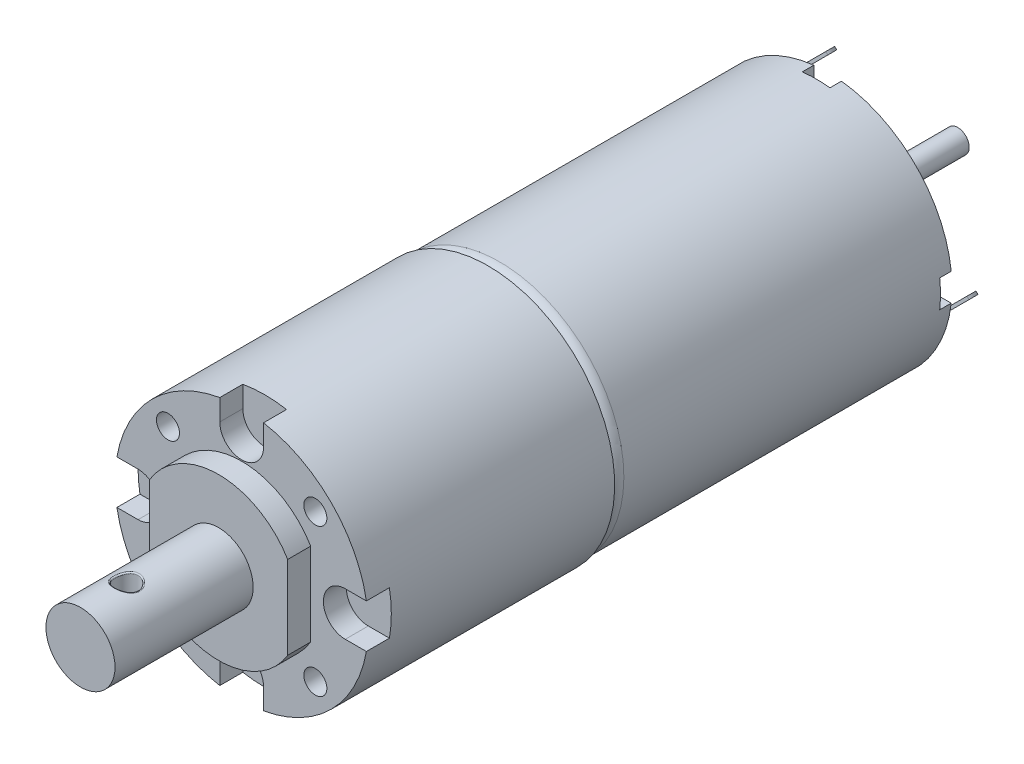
ISO-10303-21;
HEADER;
FILE_DESCRIPTION(('STEP AP214'),'2;1');
FILE_NAME('part.step','',(''),(''),'','','');
FILE_SCHEMA(('AUTOMOTIVE_DESIGN { 1 0 10303 214 1 1 1 1 }'));
ENDSEC;
DATA;
#1=APPLICATION_CONTEXT('core data for automotive mechanical design processes');
#2=APPLICATION_PROTOCOL_DEFINITION('international standard','automotive_design',2000,#1);
#3=PRODUCT_CONTEXT('',#1,'mechanical');
#4=PRODUCT('Part','Part','',(#3));
#5=PRODUCT_RELATED_PRODUCT_CATEGORY('part','',(#4));
#6=PRODUCT_DEFINITION_FORMATION('','',#4);
#7=PRODUCT_DEFINITION_CONTEXT('part definition',#1,'design');
#8=PRODUCT_DEFINITION('design','',#6,#7);
#9=PRODUCT_DEFINITION_SHAPE('','',#8);
#10=(LENGTH_UNIT() NAMED_UNIT(*) SI_UNIT(.MILLI.,.METRE.));
#11=(NAMED_UNIT(*) PLANE_ANGLE_UNIT() SI_UNIT($,.RADIAN.));
#12=(NAMED_UNIT(*) SI_UNIT($,.STERADIAN.) SOLID_ANGLE_UNIT());
#13=UNCERTAINTY_MEASURE_WITH_UNIT(LENGTH_MEASURE(1.E-05),#10,'distance_accuracy_value','');
#14=(GEOMETRIC_REPRESENTATION_CONTEXT(3) GLOBAL_UNCERTAINTY_ASSIGNED_CONTEXT((#13)) GLOBAL_UNIT_ASSIGNED_CONTEXT((#10,
#11,#12)) REPRESENTATION_CONTEXT('',''));
#15=CARTESIAN_POINT('',(0.,0.,0.));
#16=DIRECTION('',(0.,0.,1.));
#17=DIRECTION('',(1.,0.,0.));
#18=AXIS2_PLACEMENT_3D('',#15,#16,#17);
#19=CARTESIAN_POINT('',(0.,0.,-64.9));
#20=DIRECTION('',(0.,0.,-1.));
#21=DIRECTION('',(-1.,0.,0.));
#22=AXIS2_PLACEMENT_3D('',#19,#20,#21);
#23=PLANE('',#22);
#24=DIRECTION('',(0.,1.,0.));
#25=VECTOR('',#24,1.);
#26=CARTESIAN_POINT('',(-1.2,8.5,-64.9));
#27=LINE('',#26,#25);
#28=CARTESIAN_POINT('',(-1.2,8.5,-64.9));
#29=VERTEX_POINT('',#28);
#30=CARTESIAN_POINT('',(-1.20000000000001,10.733126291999,-64.9));
#31=VERTEX_POINT('',#30);
#32=EDGE_CURVE('E384',#29,#31,#27,.T.);
#33=ORIENTED_EDGE('',*,*,#32,.F.);
#34=DIRECTION('',(-1.,0.,0.));
#35=VECTOR('',#34,1.);
#36=CARTESIAN_POINT('',(1.2,8.5,-64.9));
#37=LINE('',#36,#35);
#38=CARTESIAN_POINT('',(1.2,8.5,-64.9));
#39=VERTEX_POINT('',#38);
#40=EDGE_CURVE('E376',#39,#29,#37,.T.);
#41=ORIENTED_EDGE('',*,*,#40,.F.);
#42=DIRECTION('',(0.,-1.,0.));
#43=VECTOR('',#42,1.);
#44=CARTESIAN_POINT('',(1.20000000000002,0.,-64.9));
#45=LINE('',#44,#43);
#46=CARTESIAN_POINT('',(1.19999999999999,10.733126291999,-64.9));
#47=VERTEX_POINT('',#46);
#48=EDGE_CURVE('E851',#47,#39,#45,.T.);
#49=ORIENTED_EDGE('',*,*,#48,.F.);
#50=CARTESIAN_POINT('',(0.,0.,-64.9));
#51=DIRECTION('',(0.,0.,-1.));
#52=DIRECTION('',(-1.,0.,0.));
#53=AXIS2_PLACEMENT_3D('',#50,#51,#52);
#54=CIRCLE('',#53,10.8);
#55=CARTESIAN_POINT('',(10.733126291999,1.20000000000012,-64.9));
#56=VERTEX_POINT('',#55);
#57=EDGE_CURVE('E902',#47,#56,#54,.T.);
#58=ORIENTED_EDGE('',*,*,#57,.T.);
#59=DIRECTION('',(1.,0.,0.));
#60=VECTOR('',#59,1.);
#61=CARTESIAN_POINT('',(8.49999999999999,1.20000000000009,-64.9));
#62=LINE('',#61,#60);
#63=CARTESIAN_POINT('',(8.49999999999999,1.20000000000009,-64.9));
#64=VERTEX_POINT('',#63);
#65=EDGE_CURVE('E362',#64,#56,#62,.T.);
#66=ORIENTED_EDGE('',*,*,#65,.F.);
#67=DIRECTION('',(0.,1.,0.));
#68=VECTOR('',#67,1.);
#69=CARTESIAN_POINT('',(8.50000000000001,-1.19999999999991,-64.9));
#70=LINE('',#69,#68);
#71=CARTESIAN_POINT('',(8.50000000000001,-1.19999999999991,-64.9));
#72=VERTEX_POINT('',#71);
#73=EDGE_CURVE('E366',#72,#64,#70,.T.);
#74=ORIENTED_EDGE('',*,*,#73,.F.);
#75=DIRECTION('',(-1.,0.,0.));
#76=VECTOR('',#75,1.);
#77=CARTESIAN_POINT('',(0.,-1.20000000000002,-64.9));
#78=LINE('',#77,#76);
#79=CARTESIAN_POINT('',(10.733126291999,-1.19999999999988,-64.9));
#80=VERTEX_POINT('',#79);
#81=EDGE_CURVE('E842',#80,#72,#78,.T.);
#82=ORIENTED_EDGE('',*,*,#81,.F.);
#83=CARTESIAN_POINT('',(1.20000000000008,-10.733126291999,-64.9));
#84=VERTEX_POINT('',#83);
#85=EDGE_CURVE('E517',#80,#84,#54,.T.);
#86=ORIENTED_EDGE('',*,*,#85,.T.);
#87=DIRECTION('',(0.,-1.,0.));
#88=VECTOR('',#87,1.);
#89=CARTESIAN_POINT('',(1.20000000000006,-8.49999999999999,-64.9));
#90=LINE('',#89,#88);
#91=CARTESIAN_POINT('',(1.20000000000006,-8.49999999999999,-64.9));
#92=VERTEX_POINT('',#91);
#93=EDGE_CURVE('E436',#92,#84,#90,.T.);
#94=ORIENTED_EDGE('',*,*,#93,.F.);
#95=DIRECTION('',(1.,0.,0.));
#96=VECTOR('',#95,1.);
#97=CARTESIAN_POINT('',(-1.19999999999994,-8.50000000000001,-64.9));
#98=LINE('',#97,#96);
#99=CARTESIAN_POINT('',(-1.19999999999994,-8.50000000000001,-64.9));
#100=VERTEX_POINT('',#99);
#101=EDGE_CURVE('E428',#100,#92,#98,.T.);
#102=ORIENTED_EDGE('',*,*,#101,.F.);
#103=DIRECTION('',(0.,1.,0.));
#104=VECTOR('',#103,1.);
#105=CARTESIAN_POINT('',(-1.20000000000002,0.,-64.9));
#106=LINE('',#105,#104);
#107=CARTESIAN_POINT('',(-1.19999999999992,-10.733126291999,-64.9));
#108=VERTEX_POINT('',#107);
#109=EDGE_CURVE('E845',#108,#100,#106,.T.);
#110=ORIENTED_EDGE('',*,*,#109,.F.);
#111=CARTESIAN_POINT('',(-10.733126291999,-1.20000000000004,-64.9));
#112=VERTEX_POINT('',#111);
#113=EDGE_CURVE('E504',#108,#112,#54,.T.);
#114=ORIENTED_EDGE('',*,*,#113,.T.);
#115=DIRECTION('',(-1.,0.,0.));
#116=VECTOR('',#115,1.);
#117=CARTESIAN_POINT('',(-8.49999999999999,-1.20000000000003,-64.9));
#118=LINE('',#117,#116);
#119=CARTESIAN_POINT('',(-8.49999999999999,-1.20000000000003,-64.9));
#120=VERTEX_POINT('',#119);
#121=EDGE_CURVE('E411',#120,#112,#118,.T.);
#122=ORIENTED_EDGE('',*,*,#121,.F.);
#123=DIRECTION('',(0.,-1.,0.));
#124=VECTOR('',#123,1.);
#125=CARTESIAN_POINT('',(-8.5,1.19999999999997,-64.9));
#126=LINE('',#125,#124);
#127=CARTESIAN_POINT('',(-8.5,1.19999999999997,-64.9));
#128=VERTEX_POINT('',#127);
#129=EDGE_CURVE('E403',#128,#120,#126,.T.);
#130=ORIENTED_EDGE('',*,*,#129,.F.);
#131=DIRECTION('',(1.,0.,0.));
#132=VECTOR('',#131,1.);
#133=CARTESIAN_POINT('',(0.,1.20000000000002,-64.9));
#134=LINE('',#133,#132);
#135=CARTESIAN_POINT('',(-10.733126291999,1.19999999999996,-64.9));
#136=VERTEX_POINT('',#135);
#137=EDGE_CURVE('E848',#136,#128,#134,.T.);
#138=ORIENTED_EDGE('',*,*,#137,.F.);
#139=EDGE_CURVE('E518',#136,#31,#54,.T.);
#140=ORIENTED_EDGE('',*,*,#139,.T.);
#141=EDGE_LOOP('',(#33,#41,#49,#58,#66,#74,#82,#86,#94,#102,#110,#114,#122,#130,#138,#140));
#142=FACE_BOUND('',#141,.T.);
#143=CARTESIAN_POINT('',(0.,0.,-64.9));
#144=DIRECTION('',(0.,0.,-1.));
#145=DIRECTION('',(-1.,0.,0.));
#146=AXIS2_PLACEMENT_3D('',#143,#144,#145);
#147=CIRCLE('',#146,3.8);
#148=CARTESIAN_POINT('',(3.8,0.,-64.9));
#149=VERTEX_POINT('',#148);
#150=EDGE_CURVE('E508',#149,#149,#147,.T.);
#151=ORIENTED_EDGE('',*,*,#150,.F.);
#152=EDGE_LOOP('',(#151));
#153=FACE_BOUND('',#152,.T.);
#154=DIRECTION('',(-0.707106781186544,-0.707106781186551,0.));
#155=VECTOR('',#154,1.);
#156=CARTESIAN_POINT('',(7.28319984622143,-5.16187950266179,-64.9));
#157=LINE('',#156,#155);
#158=CARTESIAN_POINT('',(7.28319984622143,-5.16187950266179,-64.9));
#159=VERTEX_POINT('',#158);
#160=CARTESIAN_POINT('',(5.1618795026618,-7.28319984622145,-64.9));
#161=VERTEX_POINT('',#160);
#162=EDGE_CURVE('E1614',#159,#161,#157,.T.);
#163=ORIENTED_EDGE('',*,*,#162,.F.);
#164=DIRECTION('',(0.707106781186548,-0.707106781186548,0.));
#165=VECTOR('',#164,1.);
#166=CARTESIAN_POINT('',(7.10642315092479,-4.98510280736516,-64.9));
#167=LINE('',#166,#165);
#168=CARTESIAN_POINT('',(7.10642315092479,-4.98510280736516,-64.9));
#169=VERTEX_POINT('',#168);
#170=EDGE_CURVE('E359',#169,#159,#167,.T.);
#171=ORIENTED_EDGE('',*,*,#170,.F.);
#172=DIRECTION('',(0.707106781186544,0.707106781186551,0.));
#173=VECTOR('',#172,1.);
#174=CARTESIAN_POINT('',(7.10642315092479,-4.98510280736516,-64.9));
#175=LINE('',#174,#173);
#176=CARTESIAN_POINT('',(4.98510280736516,-7.10642315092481,-64.9));
#177=VERTEX_POINT('',#176);
#178=EDGE_CURVE('E346',#177,#169,#175,.T.);
#179=ORIENTED_EDGE('',*,*,#178,.F.);
#180=DIRECTION('',(-0.707106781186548,0.707106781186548,0.));
#181=VECTOR('',#180,1.);
#182=CARTESIAN_POINT('',(4.98510280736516,-7.10642315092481,-64.9));
#183=LINE('',#182,#181);
#184=EDGE_CURVE('E1617',#161,#177,#183,.T.);
#185=ORIENTED_EDGE('',*,*,#184,.F.);
#186=EDGE_LOOP('',(#163,#171,#179,#185));
#187=FACE_BOUND('',#186,.T.);
#188=DIRECTION('',(-0.707106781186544,-0.707106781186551,0.));
#189=VECTOR('',#188,1.);
#190=CARTESIAN_POINT('',(-4.9851028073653,7.10642315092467,-64.9));
#191=LINE('',#190,#189);
#192=CARTESIAN_POINT('',(-4.9851028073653,7.10642315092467,-64.9));
#193=VERTEX_POINT('',#192);
#194=CARTESIAN_POINT('',(-7.10642315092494,4.98510280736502,-64.9));
#195=VERTEX_POINT('',#194);
#196=EDGE_CURVE('E1589',#193,#195,#191,.T.);
#197=ORIENTED_EDGE('',*,*,#196,.F.);
#198=DIRECTION('',(0.707106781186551,-0.707106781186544,0.));
#199=VECTOR('',#198,1.);
#200=CARTESIAN_POINT('',(-4.9851028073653,7.10642315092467,-64.9));
#201=LINE('',#200,#199);
#202=CARTESIAN_POINT('',(-5.16187950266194,7.28319984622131,-64.9));
#203=VERTEX_POINT('',#202);
#204=EDGE_CURVE('E1576',#203,#193,#201,.T.);
#205=ORIENTED_EDGE('',*,*,#204,.F.);
#206=DIRECTION('',(0.707106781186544,0.707106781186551,0.));
#207=VECTOR('',#206,1.);
#208=CARTESIAN_POINT('',(-5.16187950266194,7.28319984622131,-64.9));
#209=LINE('',#208,#207);
#210=CARTESIAN_POINT('',(-7.28319984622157,5.16187950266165,-64.9));
#211=VERTEX_POINT('',#210);
#212=EDGE_CURVE('E1582',#211,#203,#209,.T.);
#213=ORIENTED_EDGE('',*,*,#212,.F.);
#214=DIRECTION('',(-0.707106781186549,0.707106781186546,0.));
#215=VECTOR('',#214,1.);
#216=CARTESIAN_POINT('',(-7.10642315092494,4.98510280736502,-64.9));
#217=LINE('',#216,#215);
#218=EDGE_CURVE('E1592',#195,#211,#217,.T.);
#219=ORIENTED_EDGE('',*,*,#218,.F.);
#220=EDGE_LOOP('',(#197,#205,#213,#219));
#221=FACE_BOUND('',#220,.T.);
#222=ADVANCED_FACE('F51',(#142,#153,#187,#221),#23,.T.);
#223=CARTESIAN_POINT('',(0.,0.,-35.4));
#224=DIRECTION('',(0.,0.,1.));
#225=DIRECTION('',(1.,0.,0.));
#226=AXIS2_PLACEMENT_3D('',#223,#224,#225);
#227=CYLINDRICAL_SURFACE('',#226,11.);
#228=CARTESIAN_POINT('',(0.,0.,-35.4));
#229=DIRECTION('',(0.,0.,-1.));
#230=DIRECTION('',(-1.,0.,0.));
#231=AXIS2_PLACEMENT_3D('',#228,#229,#230);
#232=CIRCLE('',#231,11.);
#233=CARTESIAN_POINT('',(-11.,0.,-35.4));
#234=VERTEX_POINT('',#233);
#235=EDGE_CURVE('E719',#234,#234,#232,.T.);
#236=ORIENTED_EDGE('',*,*,#235,.F.);
#237=EDGE_LOOP('',(#236));
#238=FACE_BOUND('',#237,.T.);
#239=DIRECTION('',(0.,0.,1.));
#240=VECTOR('',#239,1.);
#241=CARTESIAN_POINT('',(-1.9,10.8346665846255,-16.));
#242=LINE('',#241,#240);
#243=CARTESIAN_POINT('',(-1.9,10.8346665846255,-16.));
#244=VERTEX_POINT('',#243);
#245=CARTESIAN_POINT('',(-1.9,10.8346665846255,-14.));
#246=VERTEX_POINT('',#245);
#247=EDGE_CURVE('E588',#244,#246,#242,.T.);
#248=ORIENTED_EDGE('',*,*,#247,.F.);
#249=CARTESIAN_POINT('',(0.,0.,-16.));
#250=DIRECTION('',(0.,0.,1.));
#251=DIRECTION('',(1.,0.,0.));
#252=AXIS2_PLACEMENT_3D('',#249,#250,#251);
#253=CIRCLE('',#252,11.);
#254=CARTESIAN_POINT('',(1.9,10.8346665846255,-16.));
#255=VERTEX_POINT('',#254);
#256=EDGE_CURVE('E572',#255,#244,#253,.T.);
#257=ORIENTED_EDGE('',*,*,#256,.F.);
#258=DIRECTION('',(0.,0.,1.));
#259=VECTOR('',#258,1.);
#260=CARTESIAN_POINT('',(1.9,10.8346665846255,-16.));
#261=LINE('',#260,#259);
#262=CARTESIAN_POINT('',(1.9,10.8346665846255,-14.));
#263=VERTEX_POINT('',#262);
#264=EDGE_CURVE('E592',#255,#263,#261,.T.);
#265=ORIENTED_EDGE('',*,*,#264,.T.);
#266=CARTESIAN_POINT('',(0.,0.,-14.));
#267=DIRECTION('',(0.,0.,-1.));
#268=DIRECTION('',(-1.,0.,0.));
#269=AXIS2_PLACEMENT_3D('',#266,#267,#268);
#270=CIRCLE('',#269,11.);
#271=CARTESIAN_POINT('',(10.8346665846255,1.89999999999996,-14.));
#272=VERTEX_POINT('',#271);
#273=EDGE_CURVE('E728',#263,#272,#270,.T.);
#274=ORIENTED_EDGE('',*,*,#273,.T.);
#275=DIRECTION('',(0.,0.,1.));
#276=VECTOR('',#275,1.);
#277=CARTESIAN_POINT('',(10.8346665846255,1.89999999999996,-16.));
#278=LINE('',#277,#276);
#279=CARTESIAN_POINT('',(10.8346665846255,1.89999999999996,-16.));
#280=VERTEX_POINT('',#279);
#281=EDGE_CURVE('E582',#280,#272,#278,.T.);
#282=ORIENTED_EDGE('',*,*,#281,.F.);
#283=CARTESIAN_POINT('',(0.,0.,-16.));
#284=DIRECTION('',(0.,0.,1.));
#285=DIRECTION('',(1.,0.,0.));
#286=AXIS2_PLACEMENT_3D('',#283,#284,#285);
#287=CIRCLE('',#286,11.);
#288=CARTESIAN_POINT('',(10.8346665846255,-1.90000000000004,-16.));
#289=VERTEX_POINT('',#288);
#290=EDGE_CURVE('E614',#289,#280,#287,.T.);
#291=ORIENTED_EDGE('',*,*,#290,.F.);
#292=DIRECTION('',(0.,0.,1.));
#293=VECTOR('',#292,1.);
#294=CARTESIAN_POINT('',(10.8346665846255,-1.90000000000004,-16.));
#295=LINE('',#294,#293);
#296=CARTESIAN_POINT('',(10.8346665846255,-1.90000000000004,-14.));
#297=VERTEX_POINT('',#296);
#298=EDGE_CURVE('E632',#289,#297,#295,.T.);
#299=ORIENTED_EDGE('',*,*,#298,.T.);
#300=CARTESIAN_POINT('',(1.89999999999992,-10.8346665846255,-14.));
#301=VERTEX_POINT('',#300);
#302=EDGE_CURVE('E1094',#297,#301,#270,.T.);
#303=ORIENTED_EDGE('',*,*,#302,.T.);
#304=DIRECTION('',(0.,0.,1.));
#305=VECTOR('',#304,1.);
#306=CARTESIAN_POINT('',(1.89999999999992,-10.8346665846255,-16.));
#307=LINE('',#306,#305);
#308=CARTESIAN_POINT('',(1.89999999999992,-10.8346665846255,-16.));
#309=VERTEX_POINT('',#308);
#310=EDGE_CURVE('E709',#309,#301,#307,.T.);
#311=ORIENTED_EDGE('',*,*,#310,.F.);
#312=CARTESIAN_POINT('',(0.,0.,-16.));
#313=DIRECTION('',(0.,0.,1.));
#314=DIRECTION('',(1.,0.,0.));
#315=AXIS2_PLACEMENT_3D('',#312,#313,#314);
#316=CIRCLE('',#315,11.);
#317=CARTESIAN_POINT('',(-1.90000000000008,-10.8346665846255,-16.));
#318=VERTEX_POINT('',#317);
#319=EDGE_CURVE('E691',#318,#309,#316,.T.);
#320=ORIENTED_EDGE('',*,*,#319,.F.);
#321=DIRECTION('',(0.,0.,1.));
#322=VECTOR('',#321,1.);
#323=CARTESIAN_POINT('',(-1.90000000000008,-10.8346665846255,-16.));
#324=LINE('',#323,#322);
#325=CARTESIAN_POINT('',(-1.90000000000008,-10.8346665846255,-14.));
#326=VERTEX_POINT('',#325);
#327=EDGE_CURVE('E712',#318,#326,#324,.T.);
#328=ORIENTED_EDGE('',*,*,#327,.T.);
#329=CARTESIAN_POINT('',(-10.8346665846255,-1.89999999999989,-14.));
#330=VERTEX_POINT('',#329);
#331=EDGE_CURVE('E591',#326,#330,#270,.T.);
#332=ORIENTED_EDGE('',*,*,#331,.T.);
#333=DIRECTION('',(0.,0.,1.));
#334=VECTOR('',#333,1.);
#335=CARTESIAN_POINT('',(-10.8346665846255,-1.89999999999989,-16.));
#336=LINE('',#335,#334);
#337=CARTESIAN_POINT('',(-10.8346665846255,-1.89999999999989,-16.));
#338=VERTEX_POINT('',#337);
#339=EDGE_CURVE('E624',#338,#330,#336,.T.);
#340=ORIENTED_EDGE('',*,*,#339,.F.);
#341=CARTESIAN_POINT('',(0.,0.,-16.));
#342=DIRECTION('',(0.,0.,1.));
#343=DIRECTION('',(1.,0.,0.));
#344=AXIS2_PLACEMENT_3D('',#341,#342,#343);
#345=CIRCLE('',#344,11.);
#346=CARTESIAN_POINT('',(-10.8346665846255,1.90000000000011,-16.));
#347=VERTEX_POINT('',#346);
#348=EDGE_CURVE('E654',#347,#338,#345,.T.);
#349=ORIENTED_EDGE('',*,*,#348,.F.);
#350=DIRECTION('',(0.,0.,1.));
#351=VECTOR('',#350,1.);
#352=CARTESIAN_POINT('',(-10.8346665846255,1.90000000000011,-16.));
#353=LINE('',#352,#351);
#354=CARTESIAN_POINT('',(-10.8346665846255,1.90000000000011,-14.));
#355=VERTEX_POINT('',#354);
#356=EDGE_CURVE('E672',#347,#355,#353,.T.);
#357=ORIENTED_EDGE('',*,*,#356,.T.);
#358=EDGE_CURVE('E724',#355,#246,#270,.T.);
#359=ORIENTED_EDGE('',*,*,#358,.T.);
#360=EDGE_LOOP('',(#248,#257,#265,#274,#282,#291,#299,#303,#311,#320,#328,#332,#340,#349,#357,#359));
#361=FACE_BOUND('',#360,.T.);
#362=ADVANCED_FACE('F944',(#238,#361),#227,.T.);
#363=CARTESIAN_POINT('',(0.,0.,-14.));
#364=DIRECTION('',(0.,0.,-1.));
#365=DIRECTION('',(-1.,0.,0.));
#366=AXIS2_PLACEMENT_3D('',#363,#364,#365);
#367=PLANE('',#366);
#368=CARTESIAN_POINT('',(6.4,6.4,-14.));
#369=DIRECTION('',(0.,0.,1.));
#370=DIRECTION('',(1.,0.,0.));
#371=AXIS2_PLACEMENT_3D('',#368,#369,#370);
#372=CIRCLE('',#371,1.);
#373=CARTESIAN_POINT('',(7.4,6.4,-14.));
#374=VERTEX_POINT('',#373);
#375=EDGE_CURVE('E541',#374,#374,#372,.T.);
#376=ORIENTED_EDGE('',*,*,#375,.F.);
#377=EDGE_LOOP('',(#376));
#378=FACE_BOUND('',#377,.T.);
#379=CARTESIAN_POINT('',(-6.4,-6.4,-14.));
#380=DIRECTION('',(0.,0.,1.));
#381=DIRECTION('',(1.,0.,0.));
#382=AXIS2_PLACEMENT_3D('',#379,#380,#381);
#383=CIRCLE('',#382,1.);
#384=CARTESIAN_POINT('',(-5.4,-6.4,-14.));
#385=VERTEX_POINT('',#384);
#386=EDGE_CURVE('E532',#385,#385,#383,.T.);
#387=ORIENTED_EDGE('',*,*,#386,.F.);
#388=EDGE_LOOP('',(#387));
#389=FACE_BOUND('',#388,.T.);
#390=CARTESIAN_POINT('',(6.4,-6.4,-14.));
#391=DIRECTION('',(0.,0.,1.));
#392=DIRECTION('',(1.,0.,0.));
#393=AXIS2_PLACEMENT_3D('',#390,#391,#392);
#394=CIRCLE('',#393,1.);
#395=CARTESIAN_POINT('',(7.4,-6.4,-14.));
#396=VERTEX_POINT('',#395);
#397=EDGE_CURVE('E527',#396,#396,#394,.T.);
#398=ORIENTED_EDGE('',*,*,#397,.F.);
#399=EDGE_LOOP('',(#398));
#400=FACE_BOUND('',#399,.T.);
#401=CARTESIAN_POINT('',(-6.4,6.4,-14.));
#402=DIRECTION('',(0.,0.,1.));
#403=DIRECTION('',(1.,0.,0.));
#404=AXIS2_PLACEMENT_3D('',#401,#402,#403);
#405=CIRCLE('',#404,1.);
#406=CARTESIAN_POINT('',(-5.4,6.4,-14.));
#407=VERTEX_POINT('',#406);
#408=EDGE_CURVE('E540',#407,#407,#405,.T.);
#409=ORIENTED_EDGE('',*,*,#408,.F.);
#410=EDGE_LOOP('',(#409));
#411=FACE_BOUND('',#410,.T.);
#412=CARTESIAN_POINT('',(0.,0.,-14.));
#413=DIRECTION('',(0.,0.,-1.));
#414=DIRECTION('',(-1.,0.,0.));
#415=AXIS2_PLACEMENT_3D('',#412,#413,#414);
#416=CIRCLE('',#415,7.);
#417=CARTESIAN_POINT('',(6.,-3.60555127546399,-14.));
#418=VERTEX_POINT('',#417);
#419=CARTESIAN_POINT('',(-6.,-3.60555127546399,-14.));
#420=VERTEX_POINT('',#419);
#421=EDGE_CURVE('E739',#418,#420,#416,.T.);
#422=ORIENTED_EDGE('',*,*,#421,.T.);
#423=DIRECTION('',(0.,1.,0.));
#424=VECTOR('',#423,1.);
#425=CARTESIAN_POINT('',(-6.,0.,-14.));
#426=LINE('',#425,#424);
#427=CARTESIAN_POINT('',(-6.,3.60555127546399,-14.));
#428=VERTEX_POINT('',#427);
#429=EDGE_CURVE('E729',#420,#428,#426,.T.);
#430=ORIENTED_EDGE('',*,*,#429,.T.);
#431=CARTESIAN_POINT('',(6.,3.60555127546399,-14.));
#432=VERTEX_POINT('',#431);
#433=EDGE_CURVE('E733',#428,#432,#416,.T.);
#434=ORIENTED_EDGE('',*,*,#433,.T.);
#435=DIRECTION('',(0.,1.,0.));
#436=VECTOR('',#435,1.);
#437=CARTESIAN_POINT('',(6.,0.,-14.));
#438=LINE('',#437,#436);
#439=EDGE_CURVE('E738',#418,#432,#438,.T.);
#440=ORIENTED_EDGE('',*,*,#439,.F.);
#441=EDGE_LOOP('',(#422,#430,#434,#440));
#442=FACE_BOUND('',#441,.T.);
#443=DIRECTION('',(0.,1.,0.));
#444=VECTOR('',#443,1.);
#445=CARTESIAN_POINT('',(-1.9,0.,-14.));
#446=LINE('',#445,#444);
#447=CARTESIAN_POINT('',(-1.9,9.,-14.));
#448=VERTEX_POINT('',#447);
#449=EDGE_CURVE('E577',#448,#246,#446,.T.);
#450=ORIENTED_EDGE('',*,*,#449,.T.);
#451=ORIENTED_EDGE('',*,*,#358,.F.);
#452=DIRECTION('',(-1.,0.,0.));
#453=VECTOR('',#452,1.);
#454=CARTESIAN_POINT('',(0.,1.9,-14.));
#455=LINE('',#454,#453);
#456=CARTESIAN_POINT('',(-8.99999999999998,1.90000000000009,-14.));
#457=VERTEX_POINT('',#456);
#458=EDGE_CURVE('E646',#457,#355,#455,.T.);
#459=ORIENTED_EDGE('',*,*,#458,.F.);
#460=CARTESIAN_POINT('',(-9.,0.,-14.));
#461=DIRECTION('',(0.,0.,1.));
#462=DIRECTION('',(1.,0.,0.));
#463=AXIS2_PLACEMENT_3D('',#460,#461,#462);
#464=CIRCLE('',#463,1.9);
#465=CARTESIAN_POINT('',(-9.00000000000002,-1.89999999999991,-14.));
#466=VERTEX_POINT('',#465);
#467=EDGE_CURVE('E663',#466,#457,#464,.T.);
#468=ORIENTED_EDGE('',*,*,#467,.F.);
#469=DIRECTION('',(-1.,0.,0.));
#470=VECTOR('',#469,1.);
#471=CARTESIAN_POINT('',(0.,-1.9,-14.));
#472=LINE('',#471,#470);
#473=EDGE_CURVE('E659',#466,#330,#472,.T.);
#474=ORIENTED_EDGE('',*,*,#473,.T.);
#475=ORIENTED_EDGE('',*,*,#331,.F.);
#476=DIRECTION('',(0.,-1.,0.));
#477=VECTOR('',#476,1.);
#478=CARTESIAN_POINT('',(-1.9,0.,-14.));
#479=LINE('',#478,#477);
#480=CARTESIAN_POINT('',(-1.90000000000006,-8.99999999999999,-14.));
#481=VERTEX_POINT('',#480);
#482=EDGE_CURVE('E701',#481,#326,#479,.T.);
#483=ORIENTED_EDGE('',*,*,#482,.F.);
#484=CARTESIAN_POINT('',(0.,-9.,-14.));
#485=DIRECTION('',(0.,0.,1.));
#486=DIRECTION('',(1.,0.,0.));
#487=AXIS2_PLACEMENT_3D('',#484,#485,#486);
#488=CIRCLE('',#487,1.9);
#489=CARTESIAN_POINT('',(1.89999999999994,-9.00000000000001,-14.));
#490=VERTEX_POINT('',#489);
#491=EDGE_CURVE('E556',#490,#481,#488,.T.);
#492=ORIENTED_EDGE('',*,*,#491,.F.);
#493=DIRECTION('',(0.,-1.,0.));
#494=VECTOR('',#493,1.);
#495=CARTESIAN_POINT('',(1.9,0.,-14.));
#496=LINE('',#495,#494);
#497=EDGE_CURVE('E687',#490,#301,#496,.T.);
#498=ORIENTED_EDGE('',*,*,#497,.T.);
#499=ORIENTED_EDGE('',*,*,#302,.F.);
#500=DIRECTION('',(1.,0.,0.));
#501=VECTOR('',#500,1.);
#502=CARTESIAN_POINT('',(0.,-1.9,-14.));
#503=LINE('',#502,#501);
#504=CARTESIAN_POINT('',(8.99999999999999,-1.90000000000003,-14.));
#505=VERTEX_POINT('',#504);
#506=EDGE_CURVE('E606',#505,#297,#503,.T.);
#507=ORIENTED_EDGE('',*,*,#506,.F.);
#508=CARTESIAN_POINT('',(9.,0.,-14.));
#509=DIRECTION('',(0.,0.,1.));
#510=DIRECTION('',(1.,0.,0.));
#511=AXIS2_PLACEMENT_3D('',#508,#509,#510);
#512=CIRCLE('',#511,1.9);
#513=CARTESIAN_POINT('',(9.00000000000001,1.89999999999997,-14.));
#514=VERTEX_POINT('',#513);
#515=EDGE_CURVE('E623',#514,#505,#512,.T.);
#516=ORIENTED_EDGE('',*,*,#515,.F.);
#517=DIRECTION('',(1.,0.,0.));
#518=VECTOR('',#517,1.);
#519=CARTESIAN_POINT('',(0.,1.9,-14.));
#520=LINE('',#519,#518);
#521=EDGE_CURVE('E619',#514,#272,#520,.T.);
#522=ORIENTED_EDGE('',*,*,#521,.T.);
#523=ORIENTED_EDGE('',*,*,#273,.F.);
#524=DIRECTION('',(0.,1.,0.));
#525=VECTOR('',#524,1.);
#526=CARTESIAN_POINT('',(1.9,0.,-14.));
#527=LINE('',#526,#525);
#528=CARTESIAN_POINT('',(1.9,9.,-14.));
#529=VERTEX_POINT('',#528);
#530=EDGE_CURVE('E564',#529,#263,#527,.T.);
#531=ORIENTED_EDGE('',*,*,#530,.F.);
#532=CARTESIAN_POINT('',(0.,9.,-14.));
#533=DIRECTION('',(0.,0.,1.));
#534=DIRECTION('',(1.,0.,0.));
#535=AXIS2_PLACEMENT_3D('',#532,#533,#534);
#536=CIRCLE('',#535,1.9);
#537=EDGE_CURVE('E581',#448,#529,#536,.T.);
#538=ORIENTED_EDGE('',*,*,#537,.F.);
#539=EDGE_LOOP('',(#450,#451,#459,#468,#474,#475,#483,#492,#498,#499,#507,#516,#522,#523,#531,#538));
#540=FACE_BOUND('',#539,.T.);
#541=ADVANCED_FACE('F951',(#378,#389,#400,#411,#442,#540),#367,.F.);
#542=CARTESIAN_POINT('',(0.,0.,-12.));
#543=DIRECTION('',(0.,0.,1.));
#544=DIRECTION('',(1.,0.,0.));
#545=AXIS2_PLACEMENT_3D('',#542,#543,#544);
#546=CYLINDRICAL_SURFACE('',#545,3.);
#547=CARTESIAN_POINT('',(-0.00287871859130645,-2.89999827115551,-3.00000414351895));
#548=CARTESIAN_POINT('',(-0.0029879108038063,-2.99999852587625,-3.0000044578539));
#549=CARTESIAN_POINT('',(-0.00327578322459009,-2.99999821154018,-2.90000455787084));
#550=CARTESIAN_POINT('',(0.0504525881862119,-2.90006312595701,-2.99984962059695));
#551=CARTESIAN_POINT('',(0.0523601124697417,-3.00005418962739,-2.99983723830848));
#552=CARTESIAN_POINT('',(0.0574115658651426,-3.00006530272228,-2.89983458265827));
#553=CARTESIAN_POINT('',(0.103791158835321,-2.89833084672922,-3.00397726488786));
#554=CARTESIAN_POINT('',(0.107902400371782,-2.99856494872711,-3.00431080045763));
#555=CARTESIAN_POINT('',(0.118107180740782,-2.99827328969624,-2.90437499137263));
#556=CARTESIAN_POINT('',(0.208948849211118,-2.89145795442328,-3.02062563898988));
#557=CARTESIAN_POINT('',(0.216861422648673,-2.99272236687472,-3.02219768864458));
#558=CARTESIAN_POINT('',(0.237769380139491,-2.9911634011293,-2.92268820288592));
#559=CARTESIAN_POINT('',(0.260767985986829,-2.88631737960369,-3.03314627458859));
#560=CARTESIAN_POINT('',(0.270609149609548,-2.98833241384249,-3.03572418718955));
#561=CARTESIAN_POINT('',(0.296735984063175,-2.98584556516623,-2.93646090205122));
#562=CARTESIAN_POINT('',(0.361225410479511,-2.87318610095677,-3.06603172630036));
#563=CARTESIAN_POINT('',(0.374143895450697,-2.97727011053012,-3.07090934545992));
#564=CARTESIAN_POINT('',(0.411049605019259,-2.97226148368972,-2.97263489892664));
#565=CARTESIAN_POINT('',(0.409878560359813,-2.86521005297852,-3.08635624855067));
#566=CARTESIAN_POINT('',(0.424195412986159,-2.97054985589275,-3.09272670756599));
#567=CARTESIAN_POINT('',(0.466413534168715,-2.96401039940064,-2.99499187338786));
#568=CARTESIAN_POINT('',(0.503212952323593,-2.84716067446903,-3.13424388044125));
#569=CARTESIAN_POINT('',(0.519501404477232,-2.95557809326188,-3.14359562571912));
#570=CARTESIAN_POINT('',(0.572621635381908,-2.9453386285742,-3.04766826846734));
#571=CARTESIAN_POINT('',(0.547887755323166,-2.83708402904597,-3.16181844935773));
#572=CARTESIAN_POINT('',(0.56487113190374,-2.94726385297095,-3.17290000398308));
#573=CARTESIAN_POINT('',(0.623458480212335,-2.93491451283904,-3.07800029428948));
#574=CARTESIAN_POINT('',(0.634514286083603,-2.81520192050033,-3.22513061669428));
#575=CARTESIAN_POINT('',(0.652139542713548,-2.92951925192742,-3.23944656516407));
#576=CARTESIAN_POINT('',(0.72203349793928,-2.9122778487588,-3.14764367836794));
#577=CARTESIAN_POINT('',(0.676189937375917,-2.80333259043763,-3.26122775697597));
#578=CARTESIAN_POINT('',(0.693658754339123,-2.92001894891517,-3.27725399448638));
#579=CARTESIAN_POINT('',(0.769457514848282,-2.8999992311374,-3.18735053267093));
#580=CARTESIAN_POINT('',(0.753066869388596,-2.77951992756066,-3.33976367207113));
#581=CARTESIAN_POINT('',(0.769477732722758,-2.9013557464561,-3.35839724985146));
#582=CARTESIAN_POINT('',(0.856938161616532,-2.87536544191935,-3.27374003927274));
#583=CARTESIAN_POINT('',(0.788265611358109,-2.76757656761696,-3.3822049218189));
#584=CARTESIAN_POINT('',(0.803615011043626,-2.89219404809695,-3.40191636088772));
#585=CARTESIAN_POINT('',(0.896991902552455,-2.86301024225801,-3.32042541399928));
#586=CARTESIAN_POINT('',(0.852645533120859,-2.74440759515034,-3.47437224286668));
#587=CARTESIAN_POINT('',(0.865446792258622,-2.87479515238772,-3.49511930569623));
#588=CARTESIAN_POINT('',(0.970251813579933,-2.83904233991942,-3.42180946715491));
#589=CARTESIAN_POINT('',(0.881513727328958,-2.73323284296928,-3.52432864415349));
#590=CARTESIAN_POINT('',(0.892475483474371,-2.86668079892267,-3.54495229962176));
#591=CARTESIAN_POINT('',(1.00310182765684,-2.82748225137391,-3.47676150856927));
#592=CARTESIAN_POINT('',(0.930311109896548,-2.71359392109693,-3.62874114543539));
#593=CARTESIAN_POINT('',(0.937795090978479,-2.85269134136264,-3.64764811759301));
#594=CARTESIAN_POINT('',(1.05862988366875,-2.80716612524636,-3.59161525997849));
#595=CARTESIAN_POINT('',(0.950257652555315,-2.70512449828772,-3.68318826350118));
#596=CARTESIAN_POINT('',(0.955749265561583,-2.84690971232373,-3.70026990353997));
#597=CARTESIAN_POINT('',(1.08132767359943,-2.79840465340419,-3.65150708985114));
#598=CARTESIAN_POINT('',(0.979916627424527,-2.69228758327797,-3.79294898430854));
#599=CARTESIAN_POINT('',(0.982415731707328,-2.83821968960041,-3.80536761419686));
#600=CARTESIAN_POINT('',(1.11507754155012,-2.78512508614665,-3.77224388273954));
#601=CARTESIAN_POINT('',(0.989989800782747,-2.68777619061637,-3.84815066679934));
#602=CARTESIAN_POINT('',(0.991201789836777,-2.8352902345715,-3.85735429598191));
#603=CARTESIAN_POINT('',(1.12654011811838,-2.78045812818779,-3.83296573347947));
#604=CARTESIAN_POINT('',(1.0007489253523,-2.68295195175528,-3.95960124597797));
#605=CARTESIAN_POINT('',(1.00068555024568,-2.83212607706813,-3.96231355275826));
#606=CARTESIAN_POINT('',(1.13878325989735,-2.77546753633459,-3.95556137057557));
#607=CARTESIAN_POINT('',(1.00143911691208,-2.68263720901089,-4.01584965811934));
#608=CARTESIAN_POINT('',(1.00128039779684,-2.83192566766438,-4.01469734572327));
#609=CARTESIAN_POINT('',(1.13956865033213,-2.77514194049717,-4.01743462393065));
#610=CARTESIAN_POINT('',(0.993667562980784,-2.68612944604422,-4.12401252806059));
#611=CARTESIAN_POINT('',(0.994436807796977,-2.83421207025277,-4.11644394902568));
#612=CARTESIAN_POINT('',(1.13072515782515,-2.77875459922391,-4.13641378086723));
#613=CARTESIAN_POINT('',(0.985780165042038,-2.68967777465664,-4.17597661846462));
#614=CARTESIAN_POINT('',(0.987570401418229,-2.83650755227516,-4.16526529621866));
#615=CARTESIAN_POINT('',(1.12174984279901,-2.78242528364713,-4.19357428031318));
#616=CARTESIAN_POINT('',(0.962067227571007,-2.70004648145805,-4.27777500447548));
#617=CARTESIAN_POINT('',(0.966362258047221,-2.84346676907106,-4.26232257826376));
#618=CARTESIAN_POINT('',(1.09476615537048,-2.79315153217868,-4.3055525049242));
#619=CARTESIAN_POINT('',(0.946240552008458,-2.70686732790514,-4.32760899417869));
#620=CARTESIAN_POINT('',(0.952208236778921,-2.84807003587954,-4.31016323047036));
#621=CARTESIAN_POINT('',(1.07675649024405,-2.80020758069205,-4.3603698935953));
#622=CARTESIAN_POINT('',(0.906886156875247,-2.7231202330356,-4.42466894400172));
#623=CARTESIAN_POINT('',(0.916036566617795,-2.85946019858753,-4.40481640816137));
#624=CARTESIAN_POINT('',(1.03197390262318,-2.81702093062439,-4.46713583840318));
#625=CARTESIAN_POINT('',(0.883242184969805,-2.73259135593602,-4.47184210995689));
#626=CARTESIAN_POINT('',(0.894157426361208,-2.86620494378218,-4.45137464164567));
#627=CARTESIAN_POINT('',(1.00506869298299,-2.82681864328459,-4.51902632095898));
#628=CARTESIAN_POINT('',(0.829001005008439,-2.75307634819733,-4.56170675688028));
#629=CARTESIAN_POINT('',(0.8427363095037,-2.88127949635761,-4.54127901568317));
#630=CARTESIAN_POINT('',(0.943345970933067,-2.84801001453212,-4.61787743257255));
#631=CARTESIAN_POINT('',(0.798400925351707,-2.76409085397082,-4.60439637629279));
#632=CARTESIAN_POINT('',(0.813449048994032,-2.88955010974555,-4.58456853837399));
#633=CARTESIAN_POINT('',(0.908525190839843,-2.85940433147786,-4.66483601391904));
#634=CARTESIAN_POINT('',(0.728601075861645,-2.78736007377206,-4.68722205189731));
#635=CARTESIAN_POINT('',(0.745452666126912,-2.90744055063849,-4.66928027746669));
#636=CARTESIAN_POINT('',(0.829097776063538,-2.88347593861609,-4.75594425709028));
#637=CARTESIAN_POINT('',(0.688949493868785,-2.79964764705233,-4.72697062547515));
#638=CARTESIAN_POINT('',(0.706385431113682,-2.91710558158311,-4.71055831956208));
#639=CARTESIAN_POINT('',(0.783977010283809,-2.89618722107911,-4.79966768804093));
#640=CARTESIAN_POINT('',(0.603522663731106,-2.82340437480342,-4.799304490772));
#641=CARTESIAN_POINT('',(0.621073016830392,-2.93610480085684,-4.78604950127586));
#642=CARTESIAN_POINT('',(0.686767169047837,-2.92076314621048,-4.87923493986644));
#643=CARTESIAN_POINT('',(0.55775820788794,-2.83487491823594,-4.83190214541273));
#644=CARTESIAN_POINT('',(0.574922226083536,-2.94546803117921,-4.82052724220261));
#645=CARTESIAN_POINT('',(0.634690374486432,-2.93262922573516,-4.91509235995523));
#646=CARTESIAN_POINT('',(0.460131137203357,-2.85602321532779,-4.88969667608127));
#647=CARTESIAN_POINT('',(0.47573070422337,-2.96286713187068,-4.88167403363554));
#648=CARTESIAN_POINT('',(0.523597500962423,-2.95450677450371,-4.97866634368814));
#649=CARTESIAN_POINT('',(0.408163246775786,-2.86565966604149,-4.91472917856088));
#650=CARTESIAN_POINT('',(0.422451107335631,-2.97094679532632,-4.90849933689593));
#651=CARTESIAN_POINT('',(0.464461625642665,-2.96447551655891,-5.00620209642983));
#652=CARTESIAN_POINT('',(0.300338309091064,-2.88174069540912,-4.9555717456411));
#653=CARTESIAN_POINT('',(0.311570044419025,-2.98444251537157,-4.95212202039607));
#654=CARTESIAN_POINT('',(0.341764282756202,-2.98111106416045,-5.05112892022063));
#655=CARTESIAN_POINT('',(0.244482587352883,-2.88818635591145,-4.97138493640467));
#656=CARTESIAN_POINT('',(0.253693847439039,-2.98994092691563,-4.96920734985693));
#657=CARTESIAN_POINT('',(0.278204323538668,-2.98777898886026,-5.06852343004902));
#658=CARTESIAN_POINT('',(0.131473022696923,-2.89705144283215,-4.9929618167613));
#659=CARTESIAN_POINT('',(0.13668183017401,-2.99746730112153,-4.99237642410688));
#660=CARTESIAN_POINT('',(0.149607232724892,-2.9969497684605,-5.0922579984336));
#661=CARTESIAN_POINT('',(0.074351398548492,-2.8995300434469,-4.99887326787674));
#662=CARTESIAN_POINT('',(0.0771887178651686,-2.99959931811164,-4.99878775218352));
#663=CARTESIAN_POINT('',(0.0846067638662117,-2.99951383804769,-5.09876059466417));
#664=CARTESIAN_POINT('',(-0.0400823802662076,-2.9003474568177,-5.00083311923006));
#665=CARTESIAN_POINT('',(-0.0415759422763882,-3.00029597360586,-5.00089557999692));
#666=CARTESIAN_POINT('',(-0.0456109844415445,-3.00035943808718,-5.10091643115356));
#667=CARTESIAN_POINT('',(-0.0973945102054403,-2.89868678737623,-4.99688275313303));
#668=CARTESIAN_POINT('',(-0.101294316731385,-2.99886633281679,-4.99660932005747));
#669=CARTESIAN_POINT('',(-0.110828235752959,-2.99864150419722,-5.09657102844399));
#670=CARTESIAN_POINT('',(-0.208570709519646,-2.89154027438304,-4.9795757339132));
#671=CARTESIAN_POINT('',(-0.216483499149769,-2.99279210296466,-4.97801804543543));
#672=CARTESIAN_POINT('',(-0.237339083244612,-2.99124855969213,-5.0775333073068));
#673=CARTESIAN_POINT('',(-0.262486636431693,-2.88617200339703,-4.96650807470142));
#674=CARTESIAN_POINT('',(-0.272419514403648,-2.98820456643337,-4.96389189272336));
#675=CARTESIAN_POINT('',(-0.298691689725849,-2.98569517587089,-5.06315888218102));
#676=CARTESIAN_POINT('',(-0.367127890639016,-2.87232940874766,-4.93180316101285));
#677=CARTESIAN_POINT('',(-0.380250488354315,-2.97654614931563,-4.92676366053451));
#678=CARTESIAN_POINT('',(-0.417766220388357,-2.97137525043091,-5.02498347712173));
#679=CARTESIAN_POINT('',(-0.417852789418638,-2.86385466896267,-4.91016475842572));
#680=CARTESIAN_POINT('',(-0.432418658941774,-2.96940685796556,-4.90353083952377));
#681=CARTESIAN_POINT('',(-0.475487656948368,-2.96260827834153,-5.00118123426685));
#682=CARTESIAN_POINT('',(-0.514678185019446,-2.84471494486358,-4.85912492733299));
#683=CARTESIAN_POINT('',(-0.531204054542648,-2.95355362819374,-4.84935175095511));
#684=CARTESIAN_POINT('',(-0.585668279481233,-2.94280856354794,-4.94503742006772));
#685=CARTESIAN_POINT('',(-0.560789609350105,-2.83405532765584,-4.82974247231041));
#686=CARTESIAN_POINT('',(-0.577967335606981,-2.94477551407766,-4.81814762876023));
#687=CARTESIAN_POINT('',(-0.638139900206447,-2.93178137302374,-4.91271671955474));
#688=CARTESIAN_POINT('',(-0.647493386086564,-2.81160346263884,-4.76401165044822));
#689=CARTESIAN_POINT('',(-0.665100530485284,-2.92663473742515,-4.74920152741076));
#690=CARTESIAN_POINT('',(-0.736802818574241,-2.90855530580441,-4.84041281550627));
#691=CARTESIAN_POINT('',(-0.688084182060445,-2.79981089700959,-4.72766132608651));
#692=CARTESIAN_POINT('',(-0.705444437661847,-2.91723167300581,-4.71120276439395));
#693=CARTESIAN_POINT('',(-0.782992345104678,-2.89635610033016,-4.80042745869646));
#694=CARTESIAN_POINT('',(-0.764448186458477,-2.77576841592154,-4.64716777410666));
#695=CARTESIAN_POINT('',(-0.780622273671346,-2.8984491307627,-4.62814922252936));
#696=CARTESIAN_POINT('',(-0.869889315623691,-2.87148456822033,-4.71188455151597));
#697=CARTESIAN_POINT('',(-0.799941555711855,-2.7635204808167,-4.60275799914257));
#698=CARTESIAN_POINT('',(-0.814919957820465,-2.88910489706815,-4.58272779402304));
#699=CARTESIAN_POINT('',(-0.910278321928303,-2.85881429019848,-4.66303379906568));
#700=CARTESIAN_POINT('',(-0.862956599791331,-2.74048454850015,-4.50844393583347));
#701=CARTESIAN_POINT('',(-0.875181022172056,-2.87191784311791,-4.48770018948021));
#702=CARTESIAN_POINT('',(-0.981985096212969,-2.8349840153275,-4.5592883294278));
#703=CARTESIAN_POINT('',(-0.890494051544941,-2.72969368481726,-4.45855079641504));
#704=CARTESIAN_POINT('',(-0.900855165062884,-2.86413513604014,-4.43810724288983));
#705=CARTESIAN_POINT('',(-1.01332081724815,-2.82382105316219,-4.50440587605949));
#706=CARTESIAN_POINT('',(-0.936821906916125,-2.71086775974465,-4.35441684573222));
#707=CARTESIAN_POINT('',(-0.943723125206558,-2.8508026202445,-4.33599201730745));
#708=CARTESIAN_POINT('',(-1.06603872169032,-2.8043459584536,-4.38985853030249));
#709=CARTESIAN_POINT('',(-0.955609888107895,-2.70283346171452,-4.30017483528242));
#710=CARTESIAN_POINT('',(-0.960572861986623,-2.84534999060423,-4.28372713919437));
#711=CARTESIAN_POINT('',(-1.08741814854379,-2.79603461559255,-4.33019231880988));
#712=CARTESIAN_POINT('',(-0.983658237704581,-2.69063289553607,-4.18894594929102));
#713=CARTESIAN_POINT('',(-0.985735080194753,-2.83712176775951,-4.17742977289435));
#714=CARTESIAN_POINT('',(-1.11933523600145,-2.78341334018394,-4.20784054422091));
#715=CARTESIAN_POINT('',(-0.992924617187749,-2.68646418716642,-4.13196082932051));
#716=CARTESIAN_POINT('',(-0.993788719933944,-2.8344290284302,-4.12390063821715));
#717=CARTESIAN_POINT('',(-1.12987973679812,-2.77910088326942,-4.14515691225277));
#718=CARTESIAN_POINT('',(-1.00122155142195,-2.68273421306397,-4.02099608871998));
#719=CARTESIAN_POINT('',(-1.00108566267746,-2.83199030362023,-4.01953392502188));
#720=CARTESIAN_POINT('',(-1.13932107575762,-2.77524228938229,-4.02309569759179));
#721=CARTESIAN_POINT('',(-1.00089883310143,-2.68288182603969,-3.96707220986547));
#722=CARTESIAN_POINT('',(-1.00080889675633,-2.83208378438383,-3.96928694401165));
#723=CARTESIAN_POINT('',(-1.13895384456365,-2.77539499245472,-3.96377943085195));
#724=CARTESIAN_POINT('',(-0.991620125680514,-2.68704745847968,-3.86010360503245));
#725=CARTESIAN_POINT('',(-0.992638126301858,-2.83481208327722,-3.86860688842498));
#726=CARTESIAN_POINT('',(-1.12839531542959,-2.7797042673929,-3.84611396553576));
#727=CARTESIAN_POINT('',(-0.982664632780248,-2.69106525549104,-3.80705882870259));
#728=CARTESIAN_POINT('',(-0.984829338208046,-2.83741845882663,-3.81869619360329));
#729=CARTESIAN_POINT('',(-1.11820458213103,-2.78386060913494,-3.78776471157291));
#730=CARTESIAN_POINT('',(-0.956839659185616,-2.70229838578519,-3.70475577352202));
#731=CARTESIAN_POINT('',(-0.961659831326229,-2.84499405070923,-3.72091062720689));
#732=CARTESIAN_POINT('',(-1.08881754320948,-2.79548108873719,-3.67523135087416));
#733=CARTESIAN_POINT('',(-0.940186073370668,-2.70942620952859,-3.65543441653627));
#734=CARTESIAN_POINT('',(-0.946709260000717,-2.84983340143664,-3.67341581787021));
#735=CARTESIAN_POINT('',(-1.06986691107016,-2.80285469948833,-3.6209778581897));
#736=CARTESIAN_POINT('',(-0.899577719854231,-2.72605681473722,-3.56017461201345));
#737=CARTESIAN_POINT('',(-0.909253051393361,-2.8615524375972,-3.58024184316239));
#738=CARTESIAN_POINT('',(-1.02365740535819,-2.82005877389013,-3.51619207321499));
#739=CARTESIAN_POINT('',(-0.875611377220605,-2.7355633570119,-3.51424167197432));
#740=CARTESIAN_POINT('',(-0.886989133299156,-2.86836260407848,-3.53477474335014));
#741=CARTESIAN_POINT('',(-0.996385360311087,-2.82989312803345,-3.46566583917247));
#742=CARTESIAN_POINT('',(-0.819491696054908,-2.75654186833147,-3.4243281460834));
#743=CARTESIAN_POINT('',(-0.833668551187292,-2.88386127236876,-3.44466769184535));
#744=CARTESIAN_POINT('',(-0.932525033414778,-2.85159503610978,-3.36676096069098));
#745=CARTESIAN_POINT('',(-0.786952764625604,-2.76809446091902,-3.38060389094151));
#746=CARTESIAN_POINT('',(-0.802424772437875,-2.89258319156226,-3.40019711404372));
#747=CARTESIAN_POINT('',(-0.895497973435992,-2.8635459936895,-3.31866428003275));
#748=CARTESIAN_POINT('',(-0.715258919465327,-2.79153373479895,-3.29903250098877));
#749=CARTESIAN_POINT('',(-0.732293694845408,-2.91071437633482,-3.31647418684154));
#750=CARTESIAN_POINT('',(-0.813915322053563,-2.88779351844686,-3.22893575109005));
#751=CARTESIAN_POINT('',(-0.67610142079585,-2.80342054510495,-3.26118767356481));
#752=CARTESIAN_POINT('',(-0.693597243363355,-2.92010646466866,-3.27709171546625));
#753=CARTESIAN_POINT('',(-0.769356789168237,-2.90009021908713,-3.18730644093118));
#754=CARTESIAN_POINT('',(-0.589803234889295,-2.8269403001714,-3.19042816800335));
#755=CARTESIAN_POINT('',(-0.607301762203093,-2.938964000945,-3.20317555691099));
#756=CARTESIAN_POINT('',(-0.671155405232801,-2.92442100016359,-3.10947098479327));
#757=CARTESIAN_POINT('',(-0.54234971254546,-2.83852651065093,-3.1578804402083));
#758=CARTESIAN_POINT('',(-0.559350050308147,-2.94845436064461,-3.16868732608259));
#759=CARTESIAN_POINT('',(-0.617156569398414,-2.93640673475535,-3.07366848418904));
#760=CARTESIAN_POINT('',(-0.442328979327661,-2.8594374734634,-3.10131288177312));
#761=CARTESIAN_POINT('',(-0.45753710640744,-2.96570820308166,-3.10874870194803));
#762=CARTESIAN_POINT('',(-0.503339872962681,-2.9580387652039,-3.01144416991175));
#763=CARTESIAN_POINT('',(-0.389771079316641,-2.86876623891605,-3.07727788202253));
#764=CARTESIAN_POINT('',(-0.403568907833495,-2.9735495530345,-3.08296126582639));
#765=CARTESIAN_POINT('',(-0.443532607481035,-2.96768921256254,-2.98500567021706));
#766=CARTESIAN_POINT('',(-0.28234683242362,-2.88391958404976,-3.03903960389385));
#767=CARTESIAN_POINT('',(-0.292965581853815,-2.98629171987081,-3.04207836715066));
#768=CARTESIAN_POINT('',(-0.321291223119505,-2.98336508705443,-2.94294356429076));
#769=CARTESIAN_POINT('',(-0.227575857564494,-2.88982886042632,-3.02459724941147));
#770=CARTESIAN_POINT('',(-0.236178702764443,-2.99133681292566,-3.02647091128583));
#771=CARTESIAN_POINT('',(-0.258965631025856,-2.98947813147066,-2.9270569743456));
#772=CARTESIAN_POINT('',(-0.116165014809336,-2.89783293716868,-3.00516362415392));
#773=CARTESIAN_POINT('',(-0.120782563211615,-2.99813605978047,-3.00559919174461));
#774=CARTESIAN_POINT('',(-0.132187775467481,-2.99775821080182,-2.90567998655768));
#775=CARTESIAN_POINT('',(-0.0595259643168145,-2.89992938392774,-3.0001682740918));
#776=CARTESIAN_POINT('',(-0.061784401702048,-2.999939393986,-3.0001820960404));
#777=CARTESIAN_POINT('',(-0.0677364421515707,-2.99992694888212,-2.90018510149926));
#778=CARTESIAN_POINT('',(-0.00287871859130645,-2.89999827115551,-3.00000414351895));
#779=CARTESIAN_POINT('',(-0.0029879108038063,-2.99999852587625,-3.0000044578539));
#780=CARTESIAN_POINT('',(-0.00327578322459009,-2.99999821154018,-2.90000455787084));
#781=(BOUNDED_SURFACE() B_SPLINE_SURFACE(3,2,((#547,#548,#549),(#550,#551,#552),(#553,#554,
#555),(#556,#557,#558),(#559,#560,#561),(#562,#563,#564),(#565,#566,#567),(#568,#569,#570),
(#571,#572,#573),(#574,#575,#576),(#577,#578,#579),(#580,#581,#582),(#583,#584,#585),(#586,#587,
#588),(#589,#590,#591),(#592,#593,#594),(#595,#596,#597),(#598,#599,#600),(#601,#602,#603),
(#604,#605,#606),(#607,#608,#609),(#610,#611,#612),(#613,#614,#615),(#616,#617,#618),(#619,#620,
#621),(#622,#623,#624),(#625,#626,#627),(#628,#629,#630),(#631,#632,#633),(#634,#635,#636),
(#637,#638,#639),(#640,#641,#642),(#643,#644,#645),(#646,#647,#648),(#649,#650,#651),(#652,#653,
#654),(#655,#656,#657),(#658,#659,#660),(#661,#662,#663),(#664,#665,#666),(#667,#668,#669),
(#670,#671,#672),(#673,#674,#675),(#676,#677,#678),(#679,#680,#681),(#682,#683,#684),(#685,#686,
#687),(#688,#689,#690),(#691,#692,#693),(#694,#695,#696),(#697,#698,#699),(#700,#701,#702),
(#703,#704,#705),(#706,#707,#708),(#709,#710,#711),(#712,#713,#714),(#715,#716,#717),(#718,#719,
#720),(#721,#722,#723),(#724,#725,#726),(#727,#728,#729),(#730,#731,#732),(#733,#734,#735),
(#736,#737,#738),(#739,#740,#741),(#742,#743,#744),(#745,#746,#747),(#748,#749,#750),(#751,#752,
#753),(#754,#755,#756),(#757,#758,#759),(#760,#761,#762),(#763,#764,#765),(#766,#767,#768),
(#769,#770,#771),(#772,#773,#774),(#775,#776,#777),(#778,#779,#780)),.UNSPECIFIED.,.T.,.F.,
.F.) B_SPLINE_SURFACE_WITH_KNOTS((4,2,2,2,2,2,2,2,2,2,2,2,2,2,2,2,2,2,2,2,2,2,2,2,2,2,2,2,2,2,2,
2,2,2,2,2,2,2,4),(3,3),(0.,0.175769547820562,0.351537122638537,0.526409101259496,
0.701559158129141,0.886138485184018,1.07079000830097,1.26315895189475,1.45515205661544,
1.63983515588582,1.82443479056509,1.99739416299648,2.17037829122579,2.34606019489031,
2.52181475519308,2.7098629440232,2.89758341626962,3.08912976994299,3.28061113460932,
3.46920873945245,3.65778275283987,3.84063600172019,4.02351375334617,4.20594754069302,
4.38843265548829,4.57871251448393,4.76861240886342,4.95856484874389,5.14839729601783,
5.32545769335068,5.50250791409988,5.67486872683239,5.84750378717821,6.02987805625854,
6.21232371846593,6.40442565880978,6.59618354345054,6.78296244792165,6.96966068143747),(0.,1.),
.UNSPECIFIED.) GEOMETRIC_REPRESENTATION_ITEM() RATIONAL_B_SPLINE_SURFACE(((1.,0.707105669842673,
1.),(1.,0.707147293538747,1.),(1.,0.706035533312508,1.),(1.,0.701604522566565,1.),(1.,
0.698285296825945,1.),(1.,0.689744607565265,1.),(1.,0.684532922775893,1.),(1.,0.67262500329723,
1.),(1.,0.66592642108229,1.),(1.,0.651210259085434,1.),(1.,0.643141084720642,1.),(1.,
0.626731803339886,1.),(1.,0.618391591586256,1.),(1.,0.60199234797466,1.),(1.,0.593959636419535,
1.),(1.,0.579674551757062,1.),(1.,0.573418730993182,1.),(1.,0.563870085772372,1.),(1.,
0.560473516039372,1.),(1.,0.556839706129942,1.),(1.,0.556601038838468,1.),(1.,0.559233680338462,
1.),(1.,0.561909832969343,1.),(1.,0.569649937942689,1.),(1.,0.574714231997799,1.),(1.,
0.586625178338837,1.),(1.,0.593498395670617,1.),(1.,0.608156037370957,1.),(1.,0.615940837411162,
1.),(1.,0.632167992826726,1.),(1.,0.6406182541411,1.),(1.,0.656757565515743,1.),(1.,
0.66444791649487,1.),(1.,0.678496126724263,1.),(1.,0.684823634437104,1.),(1.,0.6953205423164,
1.),(1.,0.699490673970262,1.),(1.,0.705213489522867,1.),(1.,0.706804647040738,1.),(1.,
0.707330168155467,1.),(1.,0.706264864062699,1.),(1.,0.7016577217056,1.),(1.,0.698191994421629,
1.),(1.,0.689186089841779,1.),(1.,0.683645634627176,1.),(1.,0.671003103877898,1.),(1.,
0.663904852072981,1.),(1.,0.648769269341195,1.),(1.,0.640731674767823,1.),(1.,0.624122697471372,
1.),(1.,0.615543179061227,1.),(1.,0.599183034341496,1.),(1.,0.591400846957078,1.),(1.,
0.577669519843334,1.),(1.,0.571720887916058,1.),(1.,0.562630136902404,1.),(1.,0.559486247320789,
1.),(1.,0.556673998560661,1.),(1.,0.556786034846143,1.),(1.,0.559925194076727,1.),(1.,
0.562952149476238,1.),(1.,0.57132234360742,1.),(1.,0.576602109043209,1.),(1.,0.58875976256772,
1.),(1.,0.595640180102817,1.),(1.,0.610614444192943,1.),(1.,0.618754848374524,1.),(1.,
0.635045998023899,1.),(1.,0.643196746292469,1.),(1.,0.659138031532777,1.),(1.,0.666886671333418,
1.),(1.,0.680745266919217,1.),(1.,0.686858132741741,1.),(1.,0.696733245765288,1.),(1.,
0.700552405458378,1.),(1.,0.705715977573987,1.),(1.,0.707061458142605,1.),(1.,0.707105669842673,1.))) REPRESENTATION_ITEM('') SURFACE());
#782=CARTESIAN_POINT('',(-0.00327578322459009,-2.99999821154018,-2.90000455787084));
#783=CARTESIAN_POINT('',(0.0574115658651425,-3.00006530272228,-2.89983458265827));
#784=CARTESIAN_POINT('',(0.118107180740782,-2.99827328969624,-2.90437499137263));
#785=CARTESIAN_POINT('',(0.237769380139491,-2.9911634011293,-2.92268820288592));
#786=CARTESIAN_POINT('',(0.296735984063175,-2.98584556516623,-2.93646090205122));
#787=CARTESIAN_POINT('',(0.411049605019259,-2.97226148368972,-2.97263489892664));
#788=CARTESIAN_POINT('',(0.466413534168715,-2.96401039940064,-2.99499187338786));
#789=CARTESIAN_POINT('',(0.572621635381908,-2.9453386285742,-3.04766826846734));
#790=CARTESIAN_POINT('',(0.623458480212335,-2.93491451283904,-3.07800029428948));
#791=CARTESIAN_POINT('',(0.72203349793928,-2.9122778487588,-3.14764367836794));
#792=CARTESIAN_POINT('',(0.769457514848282,-2.8999992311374,-3.18735053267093));
#793=CARTESIAN_POINT('',(0.856938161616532,-2.87536544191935,-3.27374003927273));
#794=CARTESIAN_POINT('',(0.896991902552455,-2.86301024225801,-3.32042541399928));
#795=CARTESIAN_POINT('',(0.970251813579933,-2.83904233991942,-3.42180946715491));
#796=CARTESIAN_POINT('',(1.00310182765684,-2.82748225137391,-3.47676150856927));
#797=CARTESIAN_POINT('',(1.05862988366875,-2.80716612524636,-3.59161525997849));
#798=CARTESIAN_POINT('',(1.08132767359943,-2.79840465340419,-3.65150708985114));
#799=CARTESIAN_POINT('',(1.11507754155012,-2.78512508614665,-3.77224388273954));
#800=CARTESIAN_POINT('',(1.12654011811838,-2.78045812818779,-3.83296573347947));
#801=CARTESIAN_POINT('',(1.13878325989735,-2.77546753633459,-3.95556137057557));
#802=CARTESIAN_POINT('',(1.13956865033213,-2.77514194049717,-4.01743462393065));
#803=CARTESIAN_POINT('',(1.13072515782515,-2.7787545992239,-4.13641378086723));
#804=CARTESIAN_POINT('',(1.12174984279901,-2.78242528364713,-4.19357428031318));
#805=CARTESIAN_POINT('',(1.09476615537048,-2.79315153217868,-4.3055525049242));
#806=CARTESIAN_POINT('',(1.07675649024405,-2.80020758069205,-4.36036989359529));
#807=CARTESIAN_POINT('',(1.03197390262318,-2.81702093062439,-4.46713583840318));
#808=CARTESIAN_POINT('',(1.00506869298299,-2.82681864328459,-4.51902632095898));
#809=CARTESIAN_POINT('',(0.943345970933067,-2.84801001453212,-4.61787743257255));
#810=CARTESIAN_POINT('',(0.908525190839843,-2.85940433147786,-4.66483601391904));
#811=CARTESIAN_POINT('',(0.829097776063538,-2.88347593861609,-4.75594425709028));
#812=CARTESIAN_POINT('',(0.783977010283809,-2.89618722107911,-4.79966768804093));
#813=CARTESIAN_POINT('',(0.686767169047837,-2.92076314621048,-4.87923493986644));
#814=CARTESIAN_POINT('',(0.634690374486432,-2.93262922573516,-4.91509235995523));
#815=CARTESIAN_POINT('',(0.523597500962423,-2.95450677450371,-4.97866634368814));
#816=CARTESIAN_POINT('',(0.464461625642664,-2.96447551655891,-5.00620209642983));
#817=CARTESIAN_POINT('',(0.341764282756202,-2.98111106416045,-5.05112892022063));
#818=CARTESIAN_POINT('',(0.278204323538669,-2.98777898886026,-5.06852343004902));
#819=CARTESIAN_POINT('',(0.149607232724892,-2.9969497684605,-5.0922579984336));
#820=CARTESIAN_POINT('',(0.0846067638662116,-2.99951383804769,-5.09876059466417));
#821=CARTESIAN_POINT('',(-0.0456109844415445,-3.00035943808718,-5.10091643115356));
#822=CARTESIAN_POINT('',(-0.110828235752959,-2.99864150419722,-5.09657102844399));
#823=CARTESIAN_POINT('',(-0.237339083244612,-2.99124855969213,-5.0775333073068));
#824=CARTESIAN_POINT('',(-0.298691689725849,-2.98569517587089,-5.06315888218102));
#825=CARTESIAN_POINT('',(-0.417766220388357,-2.97137525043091,-5.02498347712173));
#826=CARTESIAN_POINT('',(-0.475487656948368,-2.96260827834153,-5.00118123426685));
#827=CARTESIAN_POINT('',(-0.585668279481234,-2.94280856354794,-4.94503742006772));
#828=CARTESIAN_POINT('',(-0.638139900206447,-2.93178137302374,-4.91271671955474));
#829=CARTESIAN_POINT('',(-0.736802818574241,-2.90855530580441,-4.84041281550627));
#830=CARTESIAN_POINT('',(-0.782992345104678,-2.89635610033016,-4.80042745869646));
#831=CARTESIAN_POINT('',(-0.869889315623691,-2.87148456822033,-4.71188455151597));
#832=CARTESIAN_POINT('',(-0.910278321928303,-2.85881429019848,-4.66303379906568));
#833=CARTESIAN_POINT('',(-0.98198509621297,-2.8349840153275,-4.5592883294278));
#834=CARTESIAN_POINT('',(-1.01332081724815,-2.82382105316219,-4.50440587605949));
#835=CARTESIAN_POINT('',(-1.06603872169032,-2.8043459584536,-4.38985853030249));
#836=CARTESIAN_POINT('',(-1.08741814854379,-2.79603461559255,-4.33019231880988));
#837=CARTESIAN_POINT('',(-1.11933523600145,-2.78341334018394,-4.20784054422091));
#838=CARTESIAN_POINT('',(-1.12987973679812,-2.77910088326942,-4.14515691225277));
#839=CARTESIAN_POINT('',(-1.13932107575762,-2.77524228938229,-4.02309569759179));
#840=CARTESIAN_POINT('',(-1.13895384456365,-2.77539499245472,-3.96377943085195));
#841=CARTESIAN_POINT('',(-1.12839531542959,-2.7797042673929,-3.84611396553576));
#842=CARTESIAN_POINT('',(-1.11820458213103,-2.78386060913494,-3.78776471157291));
#843=CARTESIAN_POINT('',(-1.08881754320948,-2.79548108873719,-3.67523135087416));
#844=CARTESIAN_POINT('',(-1.06986691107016,-2.80285469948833,-3.6209778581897));
#845=CARTESIAN_POINT('',(-1.02365740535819,-2.82005877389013,-3.51619207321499));
#846=CARTESIAN_POINT('',(-0.996385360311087,-2.82989312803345,-3.46566583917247));
#847=CARTESIAN_POINT('',(-0.932525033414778,-2.85159503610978,-3.36676096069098));
#848=CARTESIAN_POINT('',(-0.895497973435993,-2.8635459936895,-3.31866428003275));
#849=CARTESIAN_POINT('',(-0.813915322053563,-2.88779351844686,-3.22893575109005));
#850=CARTESIAN_POINT('',(-0.769356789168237,-2.90009021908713,-3.18730644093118));
#851=CARTESIAN_POINT('',(-0.671155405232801,-2.92442100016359,-3.10947098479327));
#852=CARTESIAN_POINT('',(-0.617156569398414,-2.93640673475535,-3.07366848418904));
#853=CARTESIAN_POINT('',(-0.503339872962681,-2.9580387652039,-3.01144416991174));
#854=CARTESIAN_POINT('',(-0.443532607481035,-2.96768921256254,-2.98500567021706));
#855=CARTESIAN_POINT('',(-0.321291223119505,-2.98336508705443,-2.94294356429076));
#856=CARTESIAN_POINT('',(-0.258965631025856,-2.98947813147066,-2.9270569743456));
#857=CARTESIAN_POINT('',(-0.132187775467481,-2.99775821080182,-2.90567998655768));
#858=CARTESIAN_POINT('',(-0.0677364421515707,-2.99992694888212,-2.90018510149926));
#859=CARTESIAN_POINT('',(-0.00327578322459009,-2.99999821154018,-2.90000455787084));
#860=B_SPLINE_CURVE_WITH_KNOTS('',3,(#782,#783,#784,#785,#786,#787,#788,#789,#790,#791,#792,
#793,#794,#795,#796,#797,#798,#799,#800,#801,#802,#803,#804,#805,#806,#807,#808,#809,#810,#811,
#812,#813,#814,#815,#816,#817,#818,#819,#820,#821,#822,#823,#824,#825,#826,#827,#828,#829,#830,
#831,#832,#833,#834,#835,#836,#837,#838,#839,#840,#841,#842,#843,#844,#845,#846,#847,#848,#849,
#850,#851,#852,#853,#854,#855,#856,#857,#858,#859),.UNSPECIFIED.,.T.,.F.,(4,2,2,2,2,2,2,2,2,2,2,
2,2,2,2,2,2,2,2,2,2,2,2,2,2,2,2,2,2,2,2,2,2,2,2,2,2,2,4),(0.,0.175769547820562,
0.351537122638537,0.526409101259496,0.701559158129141,0.886138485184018,1.07079000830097,
1.26315895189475,1.45515205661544,1.63983515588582,1.82443479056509,1.99739416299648,
2.17037829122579,2.34606019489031,2.52181475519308,2.7098629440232,2.89758341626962,
3.08912976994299,3.28061113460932,3.46920873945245,3.65778275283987,3.84063600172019,
4.02351375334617,4.20594754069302,4.38843265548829,4.57871251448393,4.76861240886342,
4.95856484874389,5.14839729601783,5.32545769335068,5.50250791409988,5.67486872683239,
5.84750378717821,6.02987805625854,6.21232371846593,6.40442565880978,6.59618354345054,
6.78296244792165,6.96966068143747),.UNSPECIFIED.);
#861=CARTESIAN_POINT('',(-0.00327578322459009,-2.99999821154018,-2.90000455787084));
#862=VERTEX_POINT('',#861);
#863=EDGE_CURVE('E513',#862,#862,#860,.T.);
#864=ORIENTED_EDGE('',*,*,#863,.T.);
#865=EDGE_LOOP('',(#864));
#866=FACE_BOUND('',#865,.T.);
#867=CARTESIAN_POINT('',(0.00287871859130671,2.89999827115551,-3.00000414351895));
#868=CARTESIAN_POINT('',(0.00298791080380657,2.99999852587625,-3.0000044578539));
#869=CARTESIAN_POINT('',(0.00327578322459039,2.99999821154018,-2.90000455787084));
#870=CARTESIAN_POINT('',(-0.0504525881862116,2.90006312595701,-2.99984962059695));
#871=CARTESIAN_POINT('',(-0.0523601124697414,3.00005418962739,-2.99983723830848));
#872=CARTESIAN_POINT('',(-0.0574115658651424,3.00006530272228,-2.89983458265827));
#873=CARTESIAN_POINT('',(-0.103791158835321,2.89833084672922,-3.00397726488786));
#874=CARTESIAN_POINT('',(-0.107902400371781,2.99856494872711,-3.00431080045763));
#875=CARTESIAN_POINT('',(-0.118107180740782,2.99827328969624,-2.90437499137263));
#876=CARTESIAN_POINT('',(-0.208948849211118,2.89145795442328,-3.02062563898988));
#877=CARTESIAN_POINT('',(-0.216861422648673,2.99272236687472,-3.02219768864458));
#878=CARTESIAN_POINT('',(-0.237769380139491,2.9911634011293,-2.92268820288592));
#879=CARTESIAN_POINT('',(-0.260767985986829,2.88631737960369,-3.03314627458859));
#880=CARTESIAN_POINT('',(-0.270609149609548,2.98833241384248,-3.03572418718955));
#881=CARTESIAN_POINT('',(-0.296735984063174,2.98584556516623,-2.93646090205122));
#882=CARTESIAN_POINT('',(-0.361225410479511,2.87318610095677,-3.06603172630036));
#883=CARTESIAN_POINT('',(-0.374143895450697,2.97727011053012,-3.07090934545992));
#884=CARTESIAN_POINT('',(-0.411049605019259,2.97226148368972,-2.97263489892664));
#885=CARTESIAN_POINT('',(-0.409878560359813,2.86521005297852,-3.08635624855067));
#886=CARTESIAN_POINT('',(-0.424195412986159,2.97054985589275,-3.09272670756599));
#887=CARTESIAN_POINT('',(-0.466413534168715,2.96401039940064,-2.99499187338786));
#888=CARTESIAN_POINT('',(-0.503212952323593,2.84716067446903,-3.13424388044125));
#889=CARTESIAN_POINT('',(-0.519501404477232,2.95557809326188,-3.14359562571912));
#890=CARTESIAN_POINT('',(-0.572621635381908,2.9453386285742,-3.04766826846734));
#891=CARTESIAN_POINT('',(-0.547887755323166,2.83708402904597,-3.16181844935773));
#892=CARTESIAN_POINT('',(-0.56487113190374,2.94726385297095,-3.17290000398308));
#893=CARTESIAN_POINT('',(-0.623458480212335,2.93491451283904,-3.07800029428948));
#894=CARTESIAN_POINT('',(-0.634514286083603,2.81520192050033,-3.22513061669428));
#895=CARTESIAN_POINT('',(-0.652139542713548,2.92951925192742,-3.23944656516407));
#896=CARTESIAN_POINT('',(-0.72203349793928,2.9122778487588,-3.14764367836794));
#897=CARTESIAN_POINT('',(-0.676189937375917,2.80333259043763,-3.26122775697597));
#898=CARTESIAN_POINT('',(-0.693658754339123,2.92001894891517,-3.27725399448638));
#899=CARTESIAN_POINT('',(-0.769457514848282,2.8999992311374,-3.18735053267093));
#900=CARTESIAN_POINT('',(-0.753066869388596,2.77951992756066,-3.33976367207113));
#901=CARTESIAN_POINT('',(-0.769477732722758,2.9013557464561,-3.35839724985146));
#902=CARTESIAN_POINT('',(-0.856938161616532,2.87536544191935,-3.27374003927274));
#903=CARTESIAN_POINT('',(-0.788265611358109,2.76757656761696,-3.3822049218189));
#904=CARTESIAN_POINT('',(-0.803615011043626,2.89219404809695,-3.40191636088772));
#905=CARTESIAN_POINT('',(-0.896991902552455,2.86301024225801,-3.32042541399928));
#906=CARTESIAN_POINT('',(-0.852645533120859,2.74440759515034,-3.47437224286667));
#907=CARTESIAN_POINT('',(-0.865446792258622,2.87479515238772,-3.49511930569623));
#908=CARTESIAN_POINT('',(-0.970251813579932,2.83904233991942,-3.42180946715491));
#909=CARTESIAN_POINT('',(-0.881513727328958,2.73323284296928,-3.52432864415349));
#910=CARTESIAN_POINT('',(-0.892475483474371,2.86668079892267,-3.54495229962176));
#911=CARTESIAN_POINT('',(-1.00310182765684,2.82748225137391,-3.47676150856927));
#912=CARTESIAN_POINT('',(-0.930311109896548,2.71359392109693,-3.62874114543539));
#913=CARTESIAN_POINT('',(-0.937795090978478,2.85269134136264,-3.64764811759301));
#914=CARTESIAN_POINT('',(-1.05862988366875,2.80716612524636,-3.59161525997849));
#915=CARTESIAN_POINT('',(-0.950257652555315,2.70512449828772,-3.68318826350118));
#916=CARTESIAN_POINT('',(-0.955749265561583,2.84690971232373,-3.70026990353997));
#917=CARTESIAN_POINT('',(-1.08132767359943,2.79840465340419,-3.65150708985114));
#918=CARTESIAN_POINT('',(-0.979916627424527,2.69228758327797,-3.79294898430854));
#919=CARTESIAN_POINT('',(-0.982415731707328,2.83821968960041,-3.80536761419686));
#920=CARTESIAN_POINT('',(-1.11507754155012,2.78512508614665,-3.77224388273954));
#921=CARTESIAN_POINT('',(-0.989989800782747,2.68777619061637,-3.84815066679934));
#922=CARTESIAN_POINT('',(-0.991201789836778,2.8352902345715,-3.85735429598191));
#923=CARTESIAN_POINT('',(-1.12654011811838,2.78045812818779,-3.83296573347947));
#924=CARTESIAN_POINT('',(-1.0007489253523,2.68295195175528,-3.95960124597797));
#925=CARTESIAN_POINT('',(-1.00068555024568,2.83212607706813,-3.96231355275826));
#926=CARTESIAN_POINT('',(-1.13878325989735,2.77546753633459,-3.95556137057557));
#927=CARTESIAN_POINT('',(-1.00143911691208,2.68263720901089,-4.01584965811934));
#928=CARTESIAN_POINT('',(-1.00128039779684,2.83192566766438,-4.01469734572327));
#929=CARTESIAN_POINT('',(-1.13956865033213,2.77514194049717,-4.01743462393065));
#930=CARTESIAN_POINT('',(-0.993667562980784,2.68612944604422,-4.12401252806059));
#931=CARTESIAN_POINT('',(-0.994436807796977,2.83421207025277,-4.11644394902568));
#932=CARTESIAN_POINT('',(-1.13072515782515,2.77875459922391,-4.13641378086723));
#933=CARTESIAN_POINT('',(-0.985780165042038,2.68967777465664,-4.17597661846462));
#934=CARTESIAN_POINT('',(-0.987570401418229,2.83650755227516,-4.16526529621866));
#935=CARTESIAN_POINT('',(-1.12174984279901,2.78242528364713,-4.19357428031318));
#936=CARTESIAN_POINT('',(-0.962067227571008,2.70004648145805,-4.27777500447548));
#937=CARTESIAN_POINT('',(-0.96636225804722,2.84346676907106,-4.26232257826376));
#938=CARTESIAN_POINT('',(-1.09476615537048,2.79315153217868,-4.3055525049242));
#939=CARTESIAN_POINT('',(-0.946240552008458,2.70686732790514,-4.32760899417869));
#940=CARTESIAN_POINT('',(-0.952208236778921,2.84807003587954,-4.31016323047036));
#941=CARTESIAN_POINT('',(-1.07675649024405,2.80020758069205,-4.36036989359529));
#942=CARTESIAN_POINT('',(-0.906886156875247,2.7231202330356,-4.42466894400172));
#943=CARTESIAN_POINT('',(-0.916036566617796,2.85946019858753,-4.40481640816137));
#944=CARTESIAN_POINT('',(-1.03197390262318,2.81702093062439,-4.46713583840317));
#945=CARTESIAN_POINT('',(-0.883242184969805,2.73259135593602,-4.47184210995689));
#946=CARTESIAN_POINT('',(-0.894157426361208,2.86620494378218,-4.45137464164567));
#947=CARTESIAN_POINT('',(-1.00506869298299,2.82681864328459,-4.51902632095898));
#948=CARTESIAN_POINT('',(-0.829001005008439,2.75307634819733,-4.56170675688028));
#949=CARTESIAN_POINT('',(-0.8427363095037,2.88127949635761,-4.54127901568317));
#950=CARTESIAN_POINT('',(-0.943345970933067,2.84801001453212,-4.61787743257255));
#951=CARTESIAN_POINT('',(-0.798400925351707,2.76409085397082,-4.60439637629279));
#952=CARTESIAN_POINT('',(-0.813449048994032,2.88955010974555,-4.58456853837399));
#953=CARTESIAN_POINT('',(-0.908525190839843,2.85940433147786,-4.66483601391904));
#954=CARTESIAN_POINT('',(-0.728601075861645,2.78736007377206,-4.68722205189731));
#955=CARTESIAN_POINT('',(-0.745452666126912,2.90744055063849,-4.66928027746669));
#956=CARTESIAN_POINT('',(-0.829097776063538,2.88347593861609,-4.75594425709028));
#957=CARTESIAN_POINT('',(-0.688949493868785,2.79964764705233,-4.72697062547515));
#958=CARTESIAN_POINT('',(-0.706385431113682,2.91710558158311,-4.71055831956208));
#959=CARTESIAN_POINT('',(-0.78397701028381,2.89618722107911,-4.79966768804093));
#960=CARTESIAN_POINT('',(-0.603522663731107,2.82340437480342,-4.799304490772));
#961=CARTESIAN_POINT('',(-0.621073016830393,2.93610480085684,-4.78604950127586));
#962=CARTESIAN_POINT('',(-0.686767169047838,2.92076314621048,-4.87923493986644));
#963=CARTESIAN_POINT('',(-0.557758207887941,2.83487491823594,-4.83190214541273));
#964=CARTESIAN_POINT('',(-0.574922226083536,2.94546803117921,-4.82052724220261));
#965=CARTESIAN_POINT('',(-0.634690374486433,2.93262922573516,-4.91509235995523));
#966=CARTESIAN_POINT('',(-0.460131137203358,2.85602321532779,-4.88969667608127));
#967=CARTESIAN_POINT('',(-0.47573070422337,2.96286713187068,-4.88167403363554));
#968=CARTESIAN_POINT('',(-0.523597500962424,2.95450677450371,-4.97866634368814));
#969=CARTESIAN_POINT('',(-0.408163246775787,2.86565966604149,-4.91472917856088));
#970=CARTESIAN_POINT('',(-0.422451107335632,2.97094679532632,-4.90849933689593));
#971=CARTESIAN_POINT('',(-0.464461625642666,2.96447551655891,-5.00620209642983));
#972=CARTESIAN_POINT('',(-0.300338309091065,2.88174069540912,-4.9555717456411));
#973=CARTESIAN_POINT('',(-0.311570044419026,2.98444251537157,-4.95212202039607));
#974=CARTESIAN_POINT('',(-0.341764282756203,2.98111106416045,-5.05112892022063));
#975=CARTESIAN_POINT('',(-0.244482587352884,2.88818635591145,-4.97138493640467));
#976=CARTESIAN_POINT('',(-0.25369384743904,2.98994092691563,-4.96920734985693));
#977=CARTESIAN_POINT('',(-0.27820432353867,2.98777898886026,-5.06852343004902));
#978=CARTESIAN_POINT('',(-0.131473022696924,2.89705144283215,-4.9929618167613));
#979=CARTESIAN_POINT('',(-0.136681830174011,2.99746730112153,-4.99237642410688));
#980=CARTESIAN_POINT('',(-0.149607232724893,2.9969497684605,-5.0922579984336));
#981=CARTESIAN_POINT('',(-0.0743513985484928,2.8995300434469,-4.99887326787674));
#982=CARTESIAN_POINT('',(-0.0771887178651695,2.99959931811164,-4.99878775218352));
#983=CARTESIAN_POINT('',(-0.0846067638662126,2.99951383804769,-5.09876059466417));
#984=CARTESIAN_POINT('',(0.040082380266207,2.90034745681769,-5.00083311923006));
#985=CARTESIAN_POINT('',(0.0415759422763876,3.00029597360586,-5.00089557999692));
#986=CARTESIAN_POINT('',(0.0456109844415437,3.00035943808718,-5.10091643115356));
#987=CARTESIAN_POINT('',(0.0973945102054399,2.89868678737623,-4.99688275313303));
#988=CARTESIAN_POINT('',(0.101294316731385,2.99886633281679,-4.99660932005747));
#989=CARTESIAN_POINT('',(0.110828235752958,2.99864150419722,-5.09657102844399));
#990=CARTESIAN_POINT('',(0.208570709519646,2.89154027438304,-4.9795757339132));
#991=CARTESIAN_POINT('',(0.216483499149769,2.99279210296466,-4.97801804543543));
#992=CARTESIAN_POINT('',(0.237339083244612,2.99124855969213,-5.0775333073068));
#993=CARTESIAN_POINT('',(0.262486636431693,2.88617200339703,-4.96650807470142));
#994=CARTESIAN_POINT('',(0.272419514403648,2.98820456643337,-4.96389189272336));
#995=CARTESIAN_POINT('',(0.298691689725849,2.98569517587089,-5.06315888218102));
#996=CARTESIAN_POINT('',(0.367127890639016,2.87232940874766,-4.93180316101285));
#997=CARTESIAN_POINT('',(0.380250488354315,2.97654614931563,-4.92676366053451));
#998=CARTESIAN_POINT('',(0.417766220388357,2.97137525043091,-5.02498347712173));
#999=CARTESIAN_POINT('',(0.417852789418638,2.86385466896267,-4.91016475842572));
#1000=CARTESIAN_POINT('',(0.432418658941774,2.96940685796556,-4.90353083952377));
#1001=CARTESIAN_POINT('',(0.475487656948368,2.96260827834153,-5.00118123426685));
#1002=CARTESIAN_POINT('',(0.514678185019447,2.84471494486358,-4.85912492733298));
#1003=CARTESIAN_POINT('',(0.531204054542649,2.95355362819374,-4.84935175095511));
#1004=CARTESIAN_POINT('',(0.585668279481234,2.94280856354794,-4.94503742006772));
#1005=CARTESIAN_POINT('',(0.560789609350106,2.83405532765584,-4.82974247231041));
#1006=CARTESIAN_POINT('',(0.577967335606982,2.94477551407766,-4.81814762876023));
#1007=CARTESIAN_POINT('',(0.638139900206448,2.93178137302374,-4.91271671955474));
#1008=CARTESIAN_POINT('',(0.647493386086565,2.81160346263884,-4.76401165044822));
#1009=CARTESIAN_POINT('',(0.665100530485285,2.92663473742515,-4.74920152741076));
#1010=CARTESIAN_POINT('',(0.736802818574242,2.90855530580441,-4.84041281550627));
#1011=CARTESIAN_POINT('',(0.688084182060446,2.79981089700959,-4.72766132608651));
#1012=CARTESIAN_POINT('',(0.705444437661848,2.91723167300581,-4.71120276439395));
#1013=CARTESIAN_POINT('',(0.782992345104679,2.89635610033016,-4.80042745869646));
#1014=CARTESIAN_POINT('',(0.764448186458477,2.77576841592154,-4.64716777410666));
#1015=CARTESIAN_POINT('',(0.780622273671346,2.8984491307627,-4.62814922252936));
#1016=CARTESIAN_POINT('',(0.869889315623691,2.87148456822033,-4.71188455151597));
#1017=CARTESIAN_POINT('',(0.799941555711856,2.7635204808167,-4.60275799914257));
#1018=CARTESIAN_POINT('',(0.814919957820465,2.88910489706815,-4.58272779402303));
#1019=CARTESIAN_POINT('',(0.910278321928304,2.85881429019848,-4.66303379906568));
#1020=CARTESIAN_POINT('',(0.862956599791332,2.74048454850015,-4.50844393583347));
#1021=CARTESIAN_POINT('',(0.875181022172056,2.87191784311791,-4.4877001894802));
#1022=CARTESIAN_POINT('',(0.98198509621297,2.83498401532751,-4.5592883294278));
#1023=CARTESIAN_POINT('',(0.890494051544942,2.72969368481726,-4.45855079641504));
#1024=CARTESIAN_POINT('',(0.900855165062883,2.86413513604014,-4.43810724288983));
#1025=CARTESIAN_POINT('',(1.01332081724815,2.82382105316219,-4.50440587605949));
#1026=CARTESIAN_POINT('',(0.936821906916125,2.71086775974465,-4.35441684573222));
#1027=CARTESIAN_POINT('',(0.943723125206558,2.8508026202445,-4.33599201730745));
#1028=CARTESIAN_POINT('',(1.06603872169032,2.8043459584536,-4.38985853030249));
#1029=CARTESIAN_POINT('',(0.955609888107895,2.70283346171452,-4.30017483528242));
#1030=CARTESIAN_POINT('',(0.960572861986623,2.84534999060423,-4.28372713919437));
#1031=CARTESIAN_POINT('',(1.08741814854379,2.79603461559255,-4.33019231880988));
#1032=CARTESIAN_POINT('',(0.983658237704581,2.69063289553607,-4.18894594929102));
#1033=CARTESIAN_POINT('',(0.985735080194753,2.8371217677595,-4.17742977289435));
#1034=CARTESIAN_POINT('',(1.11933523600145,2.78341334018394,-4.20784054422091));
#1035=CARTESIAN_POINT('',(0.992924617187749,2.68646418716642,-4.13196082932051));
#1036=CARTESIAN_POINT('',(0.993788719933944,2.83442902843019,-4.12390063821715));
#1037=CARTESIAN_POINT('',(1.12987973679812,2.77910088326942,-4.14515691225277));
#1038=CARTESIAN_POINT('',(1.00122155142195,2.68273421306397,-4.02099608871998));
#1039=CARTESIAN_POINT('',(1.00108566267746,2.83199030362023,-4.01953392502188));
#1040=CARTESIAN_POINT('',(1.13932107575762,2.77524228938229,-4.02309569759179));
#1041=CARTESIAN_POINT('',(1.00089883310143,2.68288182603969,-3.96707220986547));
#1042=CARTESIAN_POINT('',(1.00080889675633,2.83208378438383,-3.96928694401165));
#1043=CARTESIAN_POINT('',(1.13895384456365,2.77539499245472,-3.96377943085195));
#1044=CARTESIAN_POINT('',(0.991620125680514,2.68704745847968,-3.86010360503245));
#1045=CARTESIAN_POINT('',(0.992638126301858,2.83481208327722,-3.86860688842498));
#1046=CARTESIAN_POINT('',(1.12839531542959,2.7797042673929,-3.84611396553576));
#1047=CARTESIAN_POINT('',(0.982664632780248,2.69106525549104,-3.80705882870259));
#1048=CARTESIAN_POINT('',(0.984829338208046,2.83741845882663,-3.81869619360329));
#1049=CARTESIAN_POINT('',(1.11820458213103,2.78386060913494,-3.78776471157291));
#1050=CARTESIAN_POINT('',(0.956839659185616,2.70229838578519,-3.70475577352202));
#1051=CARTESIAN_POINT('',(0.961659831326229,2.84499405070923,-3.72091062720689));
#1052=CARTESIAN_POINT('',(1.08881754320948,2.79548108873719,-3.67523135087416));
#1053=CARTESIAN_POINT('',(0.940186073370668,2.70942620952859,-3.65543441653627));
#1054=CARTESIAN_POINT('',(0.946709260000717,2.84983340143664,-3.67341581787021));
#1055=CARTESIAN_POINT('',(1.06986691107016,2.80285469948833,-3.6209778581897));
#1056=CARTESIAN_POINT('',(0.899577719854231,2.72605681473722,-3.56017461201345));
#1057=CARTESIAN_POINT('',(0.909253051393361,2.86155243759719,-3.58024184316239));
#1058=CARTESIAN_POINT('',(1.02365740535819,2.82005877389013,-3.51619207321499));
#1059=CARTESIAN_POINT('',(0.875611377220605,2.7355633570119,-3.51424167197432));
#1060=CARTESIAN_POINT('',(0.886989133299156,2.86836260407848,-3.53477474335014));
#1061=CARTESIAN_POINT('',(0.996385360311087,2.82989312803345,-3.46566583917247));
#1062=CARTESIAN_POINT('',(0.819491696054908,2.75654186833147,-3.4243281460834));
#1063=CARTESIAN_POINT('',(0.833668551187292,2.88386127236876,-3.44466769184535));
#1064=CARTESIAN_POINT('',(0.932525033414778,2.85159503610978,-3.36676096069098));
#1065=CARTESIAN_POINT('',(0.786952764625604,2.76809446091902,-3.38060389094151));
#1066=CARTESIAN_POINT('',(0.802424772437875,2.89258319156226,-3.40019711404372));
#1067=CARTESIAN_POINT('',(0.895497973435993,2.8635459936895,-3.31866428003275));
#1068=CARTESIAN_POINT('',(0.715258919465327,2.79153373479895,-3.29903250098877));
#1069=CARTESIAN_POINT('',(0.732293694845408,2.91071437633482,-3.31647418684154));
#1070=CARTESIAN_POINT('',(0.813915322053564,2.88779351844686,-3.22893575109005));
#1071=CARTESIAN_POINT('',(0.67610142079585,2.80342054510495,-3.26118767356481));
#1072=CARTESIAN_POINT('',(0.693597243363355,2.92010646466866,-3.27709171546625));
#1073=CARTESIAN_POINT('',(0.769356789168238,2.90009021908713,-3.18730644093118));
#1074=CARTESIAN_POINT('',(0.589803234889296,2.8269403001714,-3.19042816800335));
#1075=CARTESIAN_POINT('',(0.607301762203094,2.938964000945,-3.20317555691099));
#1076=CARTESIAN_POINT('',(0.671155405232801,2.92442100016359,-3.10947098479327));
#1077=CARTESIAN_POINT('',(0.54234971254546,2.83852651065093,-3.1578804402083));
#1078=CARTESIAN_POINT('',(0.559350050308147,2.94845436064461,-3.16868732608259));
#1079=CARTESIAN_POINT('',(0.617156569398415,2.93640673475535,-3.07366848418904));
#1080=CARTESIAN_POINT('',(0.442328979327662,2.8594374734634,-3.10131288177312));
#1081=CARTESIAN_POINT('',(0.457537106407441,2.96570820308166,-3.10874870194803));
#1082=CARTESIAN_POINT('',(0.503339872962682,2.9580387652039,-3.01144416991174));
#1083=CARTESIAN_POINT('',(0.389771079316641,2.86876623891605,-3.07727788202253));
#1084=CARTESIAN_POINT('',(0.403568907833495,2.9735495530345,-3.08296126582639));
#1085=CARTESIAN_POINT('',(0.443532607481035,2.96768921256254,-2.98500567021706));
#1086=CARTESIAN_POINT('',(0.282346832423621,2.88391958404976,-3.03903960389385));
#1087=CARTESIAN_POINT('',(0.292965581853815,2.98629171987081,-3.04207836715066));
#1088=CARTESIAN_POINT('',(0.321291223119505,2.98336508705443,-2.94294356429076));
#1089=CARTESIAN_POINT('',(0.227575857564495,2.88982886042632,-3.02459724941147));
#1090=CARTESIAN_POINT('',(0.236178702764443,2.99133681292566,-3.02647091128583));
#1091=CARTESIAN_POINT('',(0.258965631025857,2.98947813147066,-2.9270569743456));
#1092=CARTESIAN_POINT('',(0.116165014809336,2.89783293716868,-3.00516362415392));
#1093=CARTESIAN_POINT('',(0.120782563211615,2.99813605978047,-3.00559919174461));
#1094=CARTESIAN_POINT('',(0.132187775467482,2.99775821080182,-2.90567998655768));
#1095=CARTESIAN_POINT('',(0.059525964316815,2.89992938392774,-3.0001682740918));
#1096=CARTESIAN_POINT('',(0.0617844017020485,2.999939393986,-3.0001820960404));
#1097=CARTESIAN_POINT('',(0.0677364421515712,2.99992694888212,-2.90018510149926));
#1098=CARTESIAN_POINT('',(0.00287871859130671,2.89999827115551,-3.00000414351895));
#1099=CARTESIAN_POINT('',(0.00298791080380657,2.99999852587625,-3.0000044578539));
#1100=CARTESIAN_POINT('',(0.00327578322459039,2.99999821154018,-2.90000455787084));
#1101=(BOUNDED_SURFACE() B_SPLINE_SURFACE(3,2,((#867,#868,#869),(#870,#871,#872),(#873,#874,
#875),(#876,#877,#878),(#879,#880,#881),(#882,#883,#884),(#885,#886,#887),(#888,#889,#890),
(#891,#892,#893),(#894,#895,#896),(#897,#898,#899),(#900,#901,#902),(#903,#904,#905),(#906,#907,
#908),(#909,#910,#911),(#912,#913,#914),(#915,#916,#917),(#918,#919,#920),(#921,#922,#923),
(#924,#925,#926),(#927,#928,#929),(#930,#931,#932),(#933,#934,#935),(#936,#937,#938),(#939,#940,
#941),(#942,#943,#944),(#945,#946,#947),(#948,#949,#950),(#951,#952,#953),(#954,#955,#956),
(#957,#958,#959),(#960,#961,#962),(#963,#964,#965),(#966,#967,#968),(#969,#970,#971),(#972,#973,
#974),(#975,#976,#977),(#978,#979,#980),(#981,#982,#983),(#984,#985,#986),(#987,#988,#989),
(#990,#991,#992),(#993,#994,#995),(#996,#997,#998),(#999,#1000,#1001),(#1002,#1003,#1004),
(#1005,#1006,#1007),(#1008,#1009,#1010),(#1011,#1012,#1013),(#1014,#1015,#1016),(#1017,#1018,
#1019),(#1020,#1021,#1022),(#1023,#1024,#1025),(#1026,#1027,#1028),(#1029,#1030,#1031),(#1032,
#1033,#1034),(#1035,#1036,#1037),(#1038,#1039,#1040),(#1041,#1042,#1043),(#1044,#1045,#1046),
(#1047,#1048,#1049),(#1050,#1051,#1052),(#1053,#1054,#1055),(#1056,#1057,#1058),(#1059,#1060,
#1061),(#1062,#1063,#1064),(#1065,#1066,#1067),(#1068,#1069,#1070),(#1071,#1072,#1073),(#1074,
#1075,#1076),(#1077,#1078,#1079),(#1080,#1081,#1082),(#1083,#1084,#1085),(#1086,#1087,#1088),
(#1089,#1090,#1091),(#1092,#1093,#1094),(#1095,#1096,#1097),(#1098,#1099,#1100)),.UNSPECIFIED.,
.T.,.F.,.F.) B_SPLINE_SURFACE_WITH_KNOTS((4,2,2,2,2,2,2,2,2,2,2,2,2,2,2,2,2,2,2,2,2,2,2,2,2,2,2,
2,2,2,2,2,2,2,2,2,2,2,4),(3,3),(0.,0.175769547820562,0.351537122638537,0.526409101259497,
0.701559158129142,0.886138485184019,1.07079000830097,1.26315895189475,1.45515205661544,
1.63983515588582,1.82443479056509,1.99739416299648,2.17037829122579,2.34606019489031,
2.52181475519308,2.70986294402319,2.89758341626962,3.08912976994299,3.28061113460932,
3.46920873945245,3.65778275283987,3.84063600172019,4.02351375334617,4.20594754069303,
4.38843265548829,4.57871251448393,4.76861240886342,4.95856484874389,5.14839729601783,
5.32545769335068,5.50250791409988,5.6748687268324,5.84750378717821,6.02987805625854,
6.21232371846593,6.40442565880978,6.59618354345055,6.78296244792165,6.96966068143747),(0.,1.),
.UNSPECIFIED.) GEOMETRIC_REPRESENTATION_ITEM() RATIONAL_B_SPLINE_SURFACE(((1.,0.707105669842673,
1.),(1.,0.707147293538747,1.),(1.,0.706035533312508,1.),(1.,0.701604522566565,1.),(1.,
0.698285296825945,1.),(1.,0.689744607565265,1.),(1.,0.684532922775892,1.),(1.,0.67262500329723,
1.),(1.,0.66592642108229,1.),(1.,0.651210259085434,1.),(1.,0.643141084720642,1.),(1.,
0.626731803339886,1.),(1.,0.618391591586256,1.),(1.,0.60199234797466,1.),(1.,0.593959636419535,
1.),(1.,0.579674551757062,1.),(1.,0.573418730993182,1.),(1.,0.563870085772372,1.),(1.,
0.560473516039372,1.),(1.,0.556839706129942,1.),(1.,0.556601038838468,1.),(1.,0.559233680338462,
1.),(1.,0.561909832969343,1.),(1.,0.56964993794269,1.),(1.,0.5747142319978,1.),(1.,
0.586625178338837,1.),(1.,0.593498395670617,1.),(1.,0.608156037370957,1.),(1.,0.615940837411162,
1.),(1.,0.632167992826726,1.),(1.,0.6406182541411,1.),(1.,0.656757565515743,1.),(1.,
0.66444791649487,1.),(1.,0.678496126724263,1.),(1.,0.684823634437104,1.),(1.,0.6953205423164,
1.),(1.,0.699490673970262,1.),(1.,0.705213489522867,1.),(1.,0.706804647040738,1.),(1.,
0.707330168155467,1.),(1.,0.706264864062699,1.),(1.,0.7016577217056,1.),(1.,0.698191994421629,
1.),(1.,0.689186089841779,1.),(1.,0.683645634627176,1.),(1.,0.671003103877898,1.),(1.,
0.663904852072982,1.),(1.,0.648769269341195,1.),(1.,0.640731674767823,1.),(1.,0.624122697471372,
1.),(1.,0.615543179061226,1.),(1.,0.599183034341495,1.),(1.,0.591400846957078,1.),(1.,
0.577669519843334,1.),(1.,0.571720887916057,1.),(1.,0.562630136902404,1.),(1.,0.55948624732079,
1.),(1.,0.556673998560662,1.),(1.,0.556786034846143,1.),(1.,0.559925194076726,1.),(1.,
0.562952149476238,1.),(1.,0.571322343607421,1.),(1.,0.576602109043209,1.),(1.,0.58875976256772,
1.),(1.,0.595640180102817,1.),(1.,0.610614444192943,1.),(1.,0.618754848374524,1.),(1.,
0.635045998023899,1.),(1.,0.643196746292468,1.),(1.,0.659138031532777,1.),(1.,0.666886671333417,
1.),(1.,0.680745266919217,1.),(1.,0.686858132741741,1.),(1.,0.696733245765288,1.),(1.,
0.700552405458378,1.),(1.,0.705715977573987,1.),(1.,0.707061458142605,1.),(1.,0.707105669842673,1.))) REPRESENTATION_ITEM('') SURFACE());
#1102=CARTESIAN_POINT('',(0.00327578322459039,2.99999821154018,-2.90000455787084));
#1103=CARTESIAN_POINT('',(-0.0574115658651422,3.00006530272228,-2.89983458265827));
#1104=CARTESIAN_POINT('',(-0.118107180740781,2.99827328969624,-2.90437499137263));
#1105=CARTESIAN_POINT('',(-0.237769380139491,2.9911634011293,-2.92268820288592));
#1106=CARTESIAN_POINT('',(-0.296735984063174,2.98584556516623,-2.93646090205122));
#1107=CARTESIAN_POINT('',(-0.411049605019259,2.97226148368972,-2.97263489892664));
#1108=CARTESIAN_POINT('',(-0.466413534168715,2.96401039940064,-2.99499187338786));
#1109=CARTESIAN_POINT('',(-0.572621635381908,2.9453386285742,-3.04766826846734));
#1110=CARTESIAN_POINT('',(-0.623458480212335,2.93491451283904,-3.07800029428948));
#1111=CARTESIAN_POINT('',(-0.722033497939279,2.9122778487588,-3.14764367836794));
#1112=CARTESIAN_POINT('',(-0.769457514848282,2.8999992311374,-3.18735053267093));
#1113=CARTESIAN_POINT('',(-0.856938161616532,2.87536544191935,-3.27374003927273));
#1114=CARTESIAN_POINT('',(-0.896991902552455,2.86301024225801,-3.32042541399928));
#1115=CARTESIAN_POINT('',(-0.970251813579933,2.83904233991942,-3.42180946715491));
#1116=CARTESIAN_POINT('',(-1.00310182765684,2.82748225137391,-3.47676150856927));
#1117=CARTESIAN_POINT('',(-1.05862988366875,2.80716612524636,-3.59161525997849));
#1118=CARTESIAN_POINT('',(-1.08132767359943,2.79840465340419,-3.65150708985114));
#1119=CARTESIAN_POINT('',(-1.11507754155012,2.78512508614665,-3.77224388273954));
#1120=CARTESIAN_POINT('',(-1.12654011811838,2.78045812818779,-3.83296573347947));
#1121=CARTESIAN_POINT('',(-1.13878325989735,2.77546753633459,-3.95556137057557));
#1122=CARTESIAN_POINT('',(-1.13956865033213,2.77514194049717,-4.01743462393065));
#1123=CARTESIAN_POINT('',(-1.13072515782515,2.7787545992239,-4.13641378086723));
#1124=CARTESIAN_POINT('',(-1.12174984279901,2.78242528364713,-4.19357428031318));
#1125=CARTESIAN_POINT('',(-1.09476615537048,2.79315153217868,-4.3055525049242));
#1126=CARTESIAN_POINT('',(-1.07675649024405,2.80020758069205,-4.36036989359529));
#1127=CARTESIAN_POINT('',(-1.03197390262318,2.81702093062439,-4.46713583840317));
#1128=CARTESIAN_POINT('',(-1.00506869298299,2.82681864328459,-4.51902632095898));
#1129=CARTESIAN_POINT('',(-0.943345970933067,2.84801001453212,-4.61787743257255));
#1130=CARTESIAN_POINT('',(-0.908525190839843,2.85940433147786,-4.66483601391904));
#1131=CARTESIAN_POINT('',(-0.829097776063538,2.88347593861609,-4.75594425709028));
#1132=CARTESIAN_POINT('',(-0.78397701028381,2.89618722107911,-4.79966768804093));
#1133=CARTESIAN_POINT('',(-0.686767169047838,2.92076314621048,-4.87923493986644));
#1134=CARTESIAN_POINT('',(-0.634690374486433,2.93262922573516,-4.91509235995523));
#1135=CARTESIAN_POINT('',(-0.523597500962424,2.95450677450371,-4.97866634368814));
#1136=CARTESIAN_POINT('',(-0.464461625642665,2.96447551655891,-5.00620209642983));
#1137=CARTESIAN_POINT('',(-0.341764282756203,2.98111106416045,-5.05112892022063));
#1138=CARTESIAN_POINT('',(-0.27820432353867,2.98777898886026,-5.06852343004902));
#1139=CARTESIAN_POINT('',(-0.149607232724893,2.9969497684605,-5.0922579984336));
#1140=CARTESIAN_POINT('',(-0.0846067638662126,2.99951383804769,-5.09876059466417));
#1141=CARTESIAN_POINT('',(0.0456109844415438,3.00035943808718,-5.10091643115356));
#1142=CARTESIAN_POINT('',(0.110828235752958,2.99864150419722,-5.09657102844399));
#1143=CARTESIAN_POINT('',(0.237339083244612,2.99124855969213,-5.0775333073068));
#1144=CARTESIAN_POINT('',(0.298691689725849,2.98569517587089,-5.06315888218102));
#1145=CARTESIAN_POINT('',(0.417766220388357,2.97137525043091,-5.02498347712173));
#1146=CARTESIAN_POINT('',(0.475487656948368,2.96260827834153,-5.00118123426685));
#1147=CARTESIAN_POINT('',(0.585668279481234,2.94280856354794,-4.94503742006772));
#1148=CARTESIAN_POINT('',(0.638139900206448,2.93178137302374,-4.91271671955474));
#1149=CARTESIAN_POINT('',(0.736802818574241,2.90855530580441,-4.84041281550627));
#1150=CARTESIAN_POINT('',(0.782992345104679,2.89635610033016,-4.80042745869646));
#1151=CARTESIAN_POINT('',(0.869889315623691,2.87148456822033,-4.71188455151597));
#1152=CARTESIAN_POINT('',(0.910278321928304,2.85881429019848,-4.66303379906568));
#1153=CARTESIAN_POINT('',(0.98198509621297,2.8349840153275,-4.5592883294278));
#1154=CARTESIAN_POINT('',(1.01332081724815,2.82382105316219,-4.50440587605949));
#1155=CARTESIAN_POINT('',(1.06603872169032,2.8043459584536,-4.38985853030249));
#1156=CARTESIAN_POINT('',(1.08741814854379,2.79603461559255,-4.33019231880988));
#1157=CARTESIAN_POINT('',(1.11933523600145,2.78341334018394,-4.20784054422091));
#1158=CARTESIAN_POINT('',(1.12987973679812,2.77910088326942,-4.14515691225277));
#1159=CARTESIAN_POINT('',(1.13932107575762,2.77524228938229,-4.02309569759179));
#1160=CARTESIAN_POINT('',(1.13895384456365,2.77539499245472,-3.96377943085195));
#1161=CARTESIAN_POINT('',(1.12839531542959,2.7797042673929,-3.84611396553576));
#1162=CARTESIAN_POINT('',(1.11820458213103,2.78386060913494,-3.78776471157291));
#1163=CARTESIAN_POINT('',(1.08881754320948,2.79548108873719,-3.67523135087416));
#1164=CARTESIAN_POINT('',(1.06986691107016,2.80285469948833,-3.6209778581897));
#1165=CARTESIAN_POINT('',(1.02365740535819,2.82005877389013,-3.51619207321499));
#1166=CARTESIAN_POINT('',(0.996385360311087,2.82989312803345,-3.46566583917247));
#1167=CARTESIAN_POINT('',(0.932525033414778,2.85159503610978,-3.36676096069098));
#1168=CARTESIAN_POINT('',(0.895497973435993,2.8635459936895,-3.31866428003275));
#1169=CARTESIAN_POINT('',(0.813915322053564,2.88779351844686,-3.22893575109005));
#1170=CARTESIAN_POINT('',(0.769356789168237,2.90009021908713,-3.18730644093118));
#1171=CARTESIAN_POINT('',(0.671155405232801,2.92442100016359,-3.10947098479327));
#1172=CARTESIAN_POINT('',(0.617156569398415,2.93640673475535,-3.07366848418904));
#1173=CARTESIAN_POINT('',(0.503339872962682,2.9580387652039,-3.01144416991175));
#1174=CARTESIAN_POINT('',(0.443532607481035,2.96768921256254,-2.98500567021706));
#1175=CARTESIAN_POINT('',(0.321291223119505,2.98336508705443,-2.94294356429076));
#1176=CARTESIAN_POINT('',(0.258965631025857,2.98947813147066,-2.9270569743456));
#1177=CARTESIAN_POINT('',(0.132187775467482,2.99775821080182,-2.90567998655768));
#1178=CARTESIAN_POINT('',(0.0677364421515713,2.99992694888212,-2.90018510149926));
#1179=CARTESIAN_POINT('',(0.00327578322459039,2.99999821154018,-2.90000455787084));
#1180=B_SPLINE_CURVE_WITH_KNOTS('',3,(#1102,#1103,#1104,#1105,#1106,#1107,#1108,#1109,#1110,
#1111,#1112,#1113,#1114,#1115,#1116,#1117,#1118,#1119,#1120,#1121,#1122,#1123,#1124,#1125,#1126,
#1127,#1128,#1129,#1130,#1131,#1132,#1133,#1134,#1135,#1136,#1137,#1138,#1139,#1140,#1141,#1142,
#1143,#1144,#1145,#1146,#1147,#1148,#1149,#1150,#1151,#1152,#1153,#1154,#1155,#1156,#1157,#1158,
#1159,#1160,#1161,#1162,#1163,#1164,#1165,#1166,#1167,#1168,#1169,#1170,#1171,#1172,#1173,#1174,
#1175,#1176,#1177,#1178,#1179),.UNSPECIFIED.,.T.,.F.,(4,2,2,2,2,2,2,2,2,2,2,2,2,2,2,2,2,2,2,2,2,
2,2,2,2,2,2,2,2,2,2,2,2,2,2,2,2,2,4),(0.,0.175769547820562,0.351537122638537,0.526409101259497,
0.701559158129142,0.886138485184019,1.07079000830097,1.26315895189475,1.45515205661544,
1.63983515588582,1.82443479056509,1.99739416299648,2.17037829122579,2.34606019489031,
2.52181475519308,2.70986294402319,2.89758341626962,3.08912976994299,3.28061113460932,
3.46920873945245,3.65778275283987,3.84063600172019,4.02351375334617,4.20594754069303,
4.38843265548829,4.57871251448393,4.76861240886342,4.95856484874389,5.14839729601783,
5.32545769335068,5.50250791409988,5.6748687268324,5.84750378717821,6.02987805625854,
6.21232371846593,6.40442565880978,6.59618354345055,6.78296244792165,6.96966068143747),.UNSPECIFIED.);
#1181=CARTESIAN_POINT('',(0.00327578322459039,2.99999821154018,-2.90000455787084));
#1182=VERTEX_POINT('',#1181);
#1183=EDGE_CURVE('E1138',#1182,#1182,#1180,.T.);
#1184=ORIENTED_EDGE('',*,*,#1183,.T.);
#1185=EDGE_LOOP('',(#1184));
#1186=FACE_BOUND('',#1185,.T.);
#1187=CARTESIAN_POINT('',(0.,0.,-12.));
#1188=DIRECTION('',(0.,0.,1.));
#1189=DIRECTION('',(1.,0.,0.));
#1190=AXIS2_PLACEMENT_3D('',#1187,#1188,#1189);
#1191=CIRCLE('',#1190,3.);
#1192=CARTESIAN_POINT('',(3.,0.,-12.));
#1193=VERTEX_POINT('',#1192);
#1194=EDGE_CURVE('E768',#1193,#1193,#1191,.T.);
#1195=ORIENTED_EDGE('',*,*,#1194,.T.);
#1196=EDGE_LOOP('',(#1195));
#1197=FACE_BOUND('',#1196,.T.);
#1198=CARTESIAN_POINT('',(0.,0.,0.));
#1199=DIRECTION('',(0.,0.,1.));
#1200=DIRECTION('',(1.,0.,0.));
#1201=AXIS2_PLACEMENT_3D('',#1198,#1199,#1200);
#1202=CIRCLE('',#1201,3.);
#1203=CARTESIAN_POINT('',(3.,0.,0.));
#1204=VERTEX_POINT('',#1203);
#1205=EDGE_CURVE('E772',#1204,#1204,#1202,.T.);
#1206=ORIENTED_EDGE('',*,*,#1205,.F.);
#1207=EDGE_LOOP('',(#1206));
#1208=FACE_BOUND('',#1207,.T.);
#1209=ADVANCED_FACE('F822',(#866,#1186,#1197,#1208),#546,.T.);
#1210=CARTESIAN_POINT('',(0.,0.,0.));
#1211=DIRECTION('',(0.,0.,1.));
#1212=DIRECTION('',(1.,0.,0.));
#1213=AXIS2_PLACEMENT_3D('',#1210,#1211,#1212);
#1214=PLANE('',#1213);
#1215=ORIENTED_EDGE('',*,*,#1205,.T.);
#1216=EDGE_LOOP('',(#1215));
#1217=FACE_BOUND('',#1216,.T.);
#1218=ADVANCED_FACE('F800',(#1217),#1214,.T.);
#1219=CARTESIAN_POINT('',(0.,-3.,-4.));
#1220=DIRECTION('',(0.,1.,0.));
#1221=DIRECTION('',(0.,0.,1.));
#1222=AXIS2_PLACEMENT_3D('',#1219,#1220,#1221);
#1223=CYLINDRICAL_SURFACE('',#1222,1.);
#1224=CARTESIAN_POINT('',(-0.00287871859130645,-2.89999827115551,-3.00000414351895));
#1225=CARTESIAN_POINT('',(-0.0595259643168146,-2.89992938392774,-3.0001682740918));
#1226=CARTESIAN_POINT('',(-0.116165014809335,-2.89783293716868,-3.00516362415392));
#1227=CARTESIAN_POINT('',(-0.227575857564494,-2.88982886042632,-3.02459724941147));
#1228=CARTESIAN_POINT('',(-0.28234683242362,-2.88391958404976,-3.03903960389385));
#1229=CARTESIAN_POINT('',(-0.389771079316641,-2.86876623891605,-3.07727788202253));
#1230=CARTESIAN_POINT('',(-0.442328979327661,-2.8594374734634,-3.10131288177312));
#1231=CARTESIAN_POINT('',(-0.54234971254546,-2.83852651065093,-3.1578804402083));
#1232=CARTESIAN_POINT('',(-0.589803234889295,-2.8269403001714,-3.19042816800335));
#1233=CARTESIAN_POINT('',(-0.67610142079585,-2.80342054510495,-3.26118767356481));
#1234=CARTESIAN_POINT('',(-0.715258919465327,-2.79153373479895,-3.29903250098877));
#1235=CARTESIAN_POINT('',(-0.786952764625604,-2.76809446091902,-3.38060389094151));
#1236=CARTESIAN_POINT('',(-0.819491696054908,-2.75654186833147,-3.4243281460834));
#1237=CARTESIAN_POINT('',(-0.875611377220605,-2.7355633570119,-3.51424167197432));
#1238=CARTESIAN_POINT('',(-0.899577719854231,-2.72605681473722,-3.56017461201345));
#1239=CARTESIAN_POINT('',(-0.940186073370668,-2.70942620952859,-3.65543441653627));
#1240=CARTESIAN_POINT('',(-0.956839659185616,-2.70229838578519,-3.70475577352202));
#1241=CARTESIAN_POINT('',(-0.982664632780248,-2.69106525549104,-3.80705882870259));
#1242=CARTESIAN_POINT('',(-0.991620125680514,-2.68704745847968,-3.86010360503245));
#1243=CARTESIAN_POINT('',(-1.00089883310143,-2.68288182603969,-3.96707220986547));
#1244=CARTESIAN_POINT('',(-1.00122155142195,-2.68273421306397,-4.02099608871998));
#1245=CARTESIAN_POINT('',(-0.992924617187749,-2.68646418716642,-4.13196082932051));
#1246=CARTESIAN_POINT('',(-0.983658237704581,-2.69063289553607,-4.18894594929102));
#1247=CARTESIAN_POINT('',(-0.955609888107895,-2.70283346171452,-4.30017483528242));
#1248=CARTESIAN_POINT('',(-0.936821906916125,-2.71086775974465,-4.35441684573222));
#1249=CARTESIAN_POINT('',(-0.890494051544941,-2.72969368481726,-4.45855079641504));
#1250=CARTESIAN_POINT('',(-0.862956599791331,-2.74048454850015,-4.50844393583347));
#1251=CARTESIAN_POINT('',(-0.799941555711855,-2.7635204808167,-4.60275799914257));
#1252=CARTESIAN_POINT('',(-0.764448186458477,-2.77576841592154,-4.64716777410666));
#1253=CARTESIAN_POINT('',(-0.688084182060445,-2.79981089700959,-4.72766132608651));
#1254=CARTESIAN_POINT('',(-0.647493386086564,-2.81160346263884,-4.76401165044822));
#1255=CARTESIAN_POINT('',(-0.560789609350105,-2.83405532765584,-4.82974247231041));
#1256=CARTESIAN_POINT('',(-0.514678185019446,-2.84471494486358,-4.85912492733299));
#1257=CARTESIAN_POINT('',(-0.417852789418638,-2.86385466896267,-4.91016475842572));
#1258=CARTESIAN_POINT('',(-0.367127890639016,-2.87232940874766,-4.93180316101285));
#1259=CARTESIAN_POINT('',(-0.262486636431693,-2.88617200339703,-4.96650807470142));
#1260=CARTESIAN_POINT('',(-0.208570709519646,-2.89154027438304,-4.97957573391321));
#1261=CARTESIAN_POINT('',(-0.0973945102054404,-2.89868678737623,-4.99688275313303));
#1262=CARTESIAN_POINT('',(-0.0400823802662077,-2.90034745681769,-5.00083311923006));
#1263=CARTESIAN_POINT('',(0.074351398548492,-2.8995300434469,-4.99887326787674));
#1264=CARTESIAN_POINT('',(0.131473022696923,-2.89705144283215,-4.9929618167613));
#1265=CARTESIAN_POINT('',(0.244482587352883,-2.88818635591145,-4.97138493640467));
#1266=CARTESIAN_POINT('',(0.300338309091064,-2.88174069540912,-4.9555717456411));
#1267=CARTESIAN_POINT('',(0.408163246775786,-2.86565966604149,-4.91472917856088));
#1268=CARTESIAN_POINT('',(0.460131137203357,-2.85602321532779,-4.88969667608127));
#1269=CARTESIAN_POINT('',(0.55775820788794,-2.83487491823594,-4.83190214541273));
#1270=CARTESIAN_POINT('',(0.603522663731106,-2.82340437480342,-4.799304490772));
#1271=CARTESIAN_POINT('',(0.688949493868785,-2.79964764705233,-4.72697062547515));
#1272=CARTESIAN_POINT('',(0.728601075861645,-2.78736007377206,-4.68722205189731));
#1273=CARTESIAN_POINT('',(0.798400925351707,-2.76409085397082,-4.60439637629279));
#1274=CARTESIAN_POINT('',(0.829001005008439,-2.75307634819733,-4.56170675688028));
#1275=CARTESIAN_POINT('',(0.883242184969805,-2.73259135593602,-4.47184210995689));
#1276=CARTESIAN_POINT('',(0.906886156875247,-2.7231202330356,-4.42466894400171));
#1277=CARTESIAN_POINT('',(0.946240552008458,-2.70686732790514,-4.32760899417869));
#1278=CARTESIAN_POINT('',(0.962067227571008,-2.70004648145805,-4.27777500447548));
#1279=CARTESIAN_POINT('',(0.985780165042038,-2.68967777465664,-4.17597661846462));
#1280=CARTESIAN_POINT('',(0.993667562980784,-2.68612944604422,-4.12401252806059));
#1281=CARTESIAN_POINT('',(1.00143911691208,-2.68263720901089,-4.01584965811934));
#1282=CARTESIAN_POINT('',(1.0007489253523,-2.68295195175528,-3.95960124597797));
#1283=CARTESIAN_POINT('',(0.989989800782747,-2.68777619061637,-3.84815066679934));
#1284=CARTESIAN_POINT('',(0.979916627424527,-2.69228758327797,-3.79294898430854));
#1285=CARTESIAN_POINT('',(0.950257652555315,-2.70512449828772,-3.68318826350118));
#1286=CARTESIAN_POINT('',(0.930311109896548,-2.71359392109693,-3.62874114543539));
#1287=CARTESIAN_POINT('',(0.881513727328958,-2.73323284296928,-3.52432864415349));
#1288=CARTESIAN_POINT('',(0.852645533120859,-2.74440759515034,-3.47437224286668));
#1289=CARTESIAN_POINT('',(0.788265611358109,-2.76757656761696,-3.3822049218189));
#1290=CARTESIAN_POINT('',(0.753066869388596,-2.77951992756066,-3.33976367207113));
#1291=CARTESIAN_POINT('',(0.676189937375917,-2.80333259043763,-3.26122775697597));
#1292=CARTESIAN_POINT('',(0.634514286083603,-2.81520192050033,-3.22513061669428));
#1293=CARTESIAN_POINT('',(0.547887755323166,-2.83708402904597,-3.16181844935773));
#1294=CARTESIAN_POINT('',(0.503212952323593,-2.84716067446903,-3.13424388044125));
#1295=CARTESIAN_POINT('',(0.409878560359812,-2.86521005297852,-3.08635624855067));
#1296=CARTESIAN_POINT('',(0.361225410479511,-2.87318610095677,-3.06603172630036));
#1297=CARTESIAN_POINT('',(0.26076798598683,-2.88631737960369,-3.03314627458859));
#1298=CARTESIAN_POINT('',(0.208948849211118,-2.89145795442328,-3.02062563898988));
#1299=CARTESIAN_POINT('',(0.103791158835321,-2.89833084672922,-3.00397726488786));
#1300=CARTESIAN_POINT('',(0.0504525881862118,-2.90006312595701,-2.99984962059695));
#1301=CARTESIAN_POINT('',(-0.00287871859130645,-2.89999827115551,-3.00000414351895));
#1302=B_SPLINE_CURVE_WITH_KNOTS('',3,(#1224,#1225,#1226,#1227,#1228,#1229,#1230,#1231,#1232,
#1233,#1234,#1235,#1236,#1237,#1238,#1239,#1240,#1241,#1242,#1243,#1244,#1245,#1246,#1247,#1248,
#1249,#1250,#1251,#1252,#1253,#1254,#1255,#1256,#1257,#1258,#1259,#1260,#1261,#1262,#1263,#1264,
#1265,#1266,#1267,#1268,#1269,#1270,#1271,#1272,#1273,#1274,#1275,#1276,#1277,#1278,#1279,#1280,
#1281,#1282,#1283,#1284,#1285,#1286,#1287,#1288,#1289,#1290,#1291,#1292,#1293,#1294,#1295,#1296,
#1297,#1298,#1299,#1300,#1301),.UNSPECIFIED.,.T.,.F.,(4,2,2,2,2,2,2,2,2,2,2,2,2,2,2,2,2,2,2,2,2,
2,2,2,2,2,2,2,2,2,2,2,2,2,2,2,2,2,4),(0.,0.186698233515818,0.373477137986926,0.565235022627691,
0.757336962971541,0.939782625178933,1.12215689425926,1.29479195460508,1.46715276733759,
1.64420298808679,1.82126338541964,2.01109583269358,2.20104827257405,2.39094816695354,
2.58122802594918,2.76371314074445,2.9461469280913,3.12902467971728,3.3118779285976,
3.50045194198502,3.68904954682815,3.88053091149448,4.07207726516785,4.25979773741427,
4.44784592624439,4.62360048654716,4.79928239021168,4.97226651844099,5.14522589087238,
5.32982552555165,5.51450862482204,5.70650172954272,5.8988706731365,6.08352219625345,
6.26810152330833,6.44325158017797,6.61812355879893,6.79389113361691,6.96966068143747),.UNSPECIFIED.);
#1303=CARTESIAN_POINT('',(-0.00287871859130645,-2.89999827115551,-3.00000414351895));
#1304=VERTEX_POINT('',#1303);
#1305=EDGE_CURVE('E785',#1304,#1304,#1302,.T.);
#1306=ORIENTED_EDGE('',*,*,#1305,.T.);
#1307=EDGE_LOOP('',(#1306));
#1308=FACE_BOUND('',#1307,.T.);
#1309=CARTESIAN_POINT('',(0.00287871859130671,2.89999827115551,-3.00000414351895));
#1310=CARTESIAN_POINT('',(0.0595259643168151,2.89992938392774,-3.0001682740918));
#1311=CARTESIAN_POINT('',(0.116165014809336,2.89783293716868,-3.00516362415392));
#1312=CARTESIAN_POINT('',(0.227575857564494,2.88982886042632,-3.02459724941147));
#1313=CARTESIAN_POINT('',(0.28234683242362,2.88391958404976,-3.03903960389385));
#1314=CARTESIAN_POINT('',(0.389771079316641,2.86876623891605,-3.07727788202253));
#1315=CARTESIAN_POINT('',(0.442328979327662,2.8594374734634,-3.10131288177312));
#1316=CARTESIAN_POINT('',(0.54234971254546,2.83852651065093,-3.1578804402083));
#1317=CARTESIAN_POINT('',(0.589803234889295,2.8269403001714,-3.19042816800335));
#1318=CARTESIAN_POINT('',(0.67610142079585,2.80342054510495,-3.26118767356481));
#1319=CARTESIAN_POINT('',(0.715258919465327,2.79153373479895,-3.29903250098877));
#1320=CARTESIAN_POINT('',(0.786952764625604,2.76809446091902,-3.38060389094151));
#1321=CARTESIAN_POINT('',(0.819491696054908,2.75654186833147,-3.4243281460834));
#1322=CARTESIAN_POINT('',(0.875611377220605,2.7355633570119,-3.51424167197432));
#1323=CARTESIAN_POINT('',(0.899577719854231,2.72605681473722,-3.56017461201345));
#1324=CARTESIAN_POINT('',(0.940186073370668,2.70942620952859,-3.65543441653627));
#1325=CARTESIAN_POINT('',(0.956839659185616,2.70229838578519,-3.70475577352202));
#1326=CARTESIAN_POINT('',(0.982664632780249,2.69106525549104,-3.80705882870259));
#1327=CARTESIAN_POINT('',(0.991620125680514,2.68704745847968,-3.86010360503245));
#1328=CARTESIAN_POINT('',(1.00089883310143,2.68288182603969,-3.96707220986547));
#1329=CARTESIAN_POINT('',(1.00122155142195,2.68273421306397,-4.02099608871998));
#1330=CARTESIAN_POINT('',(0.992924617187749,2.68646418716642,-4.13196082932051));
#1331=CARTESIAN_POINT('',(0.983658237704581,2.69063289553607,-4.18894594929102));
#1332=CARTESIAN_POINT('',(0.955609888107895,2.70283346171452,-4.30017483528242));
#1333=CARTESIAN_POINT('',(0.936821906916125,2.71086775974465,-4.35441684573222));
#1334=CARTESIAN_POINT('',(0.890494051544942,2.72969368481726,-4.45855079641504));
#1335=CARTESIAN_POINT('',(0.862956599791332,2.74048454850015,-4.50844393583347));
#1336=CARTESIAN_POINT('',(0.799941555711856,2.7635204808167,-4.60275799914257));
#1337=CARTESIAN_POINT('',(0.764448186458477,2.77576841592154,-4.64716777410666));
#1338=CARTESIAN_POINT('',(0.688084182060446,2.79981089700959,-4.72766132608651));
#1339=CARTESIAN_POINT('',(0.647493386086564,2.81160346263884,-4.76401165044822));
#1340=CARTESIAN_POINT('',(0.560789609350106,2.83405532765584,-4.82974247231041));
#1341=CARTESIAN_POINT('',(0.514678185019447,2.84471494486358,-4.85912492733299));
#1342=CARTESIAN_POINT('',(0.417852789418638,2.86385466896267,-4.91016475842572));
#1343=CARTESIAN_POINT('',(0.367127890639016,2.87232940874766,-4.93180316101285));
#1344=CARTESIAN_POINT('',(0.262486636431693,2.88617200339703,-4.96650807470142));
#1345=CARTESIAN_POINT('',(0.208570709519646,2.89154027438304,-4.97957573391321));
#1346=CARTESIAN_POINT('',(0.0973945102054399,2.89868678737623,-4.99688275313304));
#1347=CARTESIAN_POINT('',(0.040082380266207,2.90034745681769,-5.00083311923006));
#1348=CARTESIAN_POINT('',(-0.0743513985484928,2.8995300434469,-4.99887326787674));
#1349=CARTESIAN_POINT('',(-0.131473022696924,2.89705144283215,-4.9929618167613));
#1350=CARTESIAN_POINT('',(-0.244482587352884,2.88818635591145,-4.97138493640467));
#1351=CARTESIAN_POINT('',(-0.300338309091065,2.88174069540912,-4.9555717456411));
#1352=CARTESIAN_POINT('',(-0.408163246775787,2.86565966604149,-4.91472917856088));
#1353=CARTESIAN_POINT('',(-0.460131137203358,2.85602321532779,-4.88969667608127));
#1354=CARTESIAN_POINT('',(-0.557758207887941,2.83487491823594,-4.83190214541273));
#1355=CARTESIAN_POINT('',(-0.603522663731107,2.82340437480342,-4.799304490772));
#1356=CARTESIAN_POINT('',(-0.688949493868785,2.79964764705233,-4.72697062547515));
#1357=CARTESIAN_POINT('',(-0.728601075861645,2.78736007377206,-4.68722205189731));
#1358=CARTESIAN_POINT('',(-0.798400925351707,2.76409085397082,-4.60439637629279));
#1359=CARTESIAN_POINT('',(-0.829001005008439,2.75307634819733,-4.56170675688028));
#1360=CARTESIAN_POINT('',(-0.883242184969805,2.73259135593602,-4.47184210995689));
#1361=CARTESIAN_POINT('',(-0.906886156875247,2.7231202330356,-4.42466894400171));
#1362=CARTESIAN_POINT('',(-0.946240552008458,2.70686732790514,-4.32760899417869));
#1363=CARTESIAN_POINT('',(-0.962067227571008,2.70004648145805,-4.27777500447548));
#1364=CARTESIAN_POINT('',(-0.985780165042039,2.68967777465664,-4.17597661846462));
#1365=CARTESIAN_POINT('',(-0.993667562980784,2.68612944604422,-4.12401252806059));
#1366=CARTESIAN_POINT('',(-1.00143911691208,2.68263720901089,-4.01584965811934));
#1367=CARTESIAN_POINT('',(-1.0007489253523,2.68295195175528,-3.95960124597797));
#1368=CARTESIAN_POINT('',(-0.989989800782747,2.68777619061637,-3.84815066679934));
#1369=CARTESIAN_POINT('',(-0.979916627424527,2.69228758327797,-3.79294898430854));
#1370=CARTESIAN_POINT('',(-0.950257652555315,2.70512449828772,-3.68318826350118));
#1371=CARTESIAN_POINT('',(-0.930311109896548,2.71359392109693,-3.62874114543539));
#1372=CARTESIAN_POINT('',(-0.881513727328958,2.73323284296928,-3.52432864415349));
#1373=CARTESIAN_POINT('',(-0.852645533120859,2.74440759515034,-3.47437224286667));
#1374=CARTESIAN_POINT('',(-0.788265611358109,2.76757656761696,-3.3822049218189));
#1375=CARTESIAN_POINT('',(-0.753066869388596,2.77951992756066,-3.33976367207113));
#1376=CARTESIAN_POINT('',(-0.676189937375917,2.80333259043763,-3.26122775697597));
#1377=CARTESIAN_POINT('',(-0.634514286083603,2.81520192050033,-3.22513061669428));
#1378=CARTESIAN_POINT('',(-0.547887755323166,2.83708402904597,-3.16181844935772));
#1379=CARTESIAN_POINT('',(-0.503212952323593,2.84716067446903,-3.13424388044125));
#1380=CARTESIAN_POINT('',(-0.409878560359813,2.86521005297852,-3.08635624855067));
#1381=CARTESIAN_POINT('',(-0.361225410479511,2.87318610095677,-3.06603172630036));
#1382=CARTESIAN_POINT('',(-0.260767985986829,2.88631737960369,-3.03314627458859));
#1383=CARTESIAN_POINT('',(-0.208948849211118,2.89145795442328,-3.02062563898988));
#1384=CARTESIAN_POINT('',(-0.103791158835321,2.89833084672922,-3.00397726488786));
#1385=CARTESIAN_POINT('',(-0.0504525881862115,2.90006312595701,-2.99984962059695));
#1386=CARTESIAN_POINT('',(0.00287871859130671,2.89999827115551,-3.00000414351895));
#1387=B_SPLINE_CURVE_WITH_KNOTS('',3,(#1309,#1310,#1311,#1312,#1313,#1314,#1315,#1316,#1317,
#1318,#1319,#1320,#1321,#1322,#1323,#1324,#1325,#1326,#1327,#1328,#1329,#1330,#1331,#1332,#1333,
#1334,#1335,#1336,#1337,#1338,#1339,#1340,#1341,#1342,#1343,#1344,#1345,#1346,#1347,#1348,#1349,
#1350,#1351,#1352,#1353,#1354,#1355,#1356,#1357,#1358,#1359,#1360,#1361,#1362,#1363,#1364,#1365,
#1366,#1367,#1368,#1369,#1370,#1371,#1372,#1373,#1374,#1375,#1376,#1377,#1378,#1379,#1380,#1381,
#1382,#1383,#1384,#1385,#1386),.UNSPECIFIED.,.T.,.F.,(4,2,2,2,2,2,2,2,2,2,2,2,2,2,2,2,2,2,2,2,2,
2,2,2,2,2,2,2,2,2,2,2,2,2,2,2,2,2,4),(0.,0.186698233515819,0.373477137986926,0.565235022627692,
0.757336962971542,0.939782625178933,1.12215689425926,1.29479195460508,1.46715276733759,
1.6442029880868,1.82126338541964,2.01109583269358,2.20104827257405,2.39094816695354,
2.58122802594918,2.76371314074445,2.9461469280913,3.12902467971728,3.3118779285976,
3.50045194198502,3.68904954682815,3.88053091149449,4.07207726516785,4.25979773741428,
4.44784592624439,4.62360048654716,4.79928239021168,4.97226651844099,5.14522589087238,
5.32982552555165,5.51450862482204,5.70650172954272,5.8988706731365,6.08352219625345,
6.26810152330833,6.44325158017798,6.61812355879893,6.79389113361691,6.96966068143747),.UNSPECIFIED.);
#1388=CARTESIAN_POINT('',(0.00287871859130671,2.89999827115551,-3.00000414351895));
#1389=VERTEX_POINT('',#1388);
#1390=EDGE_CURVE('E776',#1389,#1389,#1387,.T.);
#1391=ORIENTED_EDGE('',*,*,#1390,.T.);
#1392=EDGE_LOOP('',(#1391));
#1393=FACE_BOUND('',#1392,.T.);
#1394=ADVANCED_FACE('F794',(#1308,#1393),#1223,.F.);
#1395=CARTESIAN_POINT('',(-0.00316659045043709,-2.89999827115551,-2.90000455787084));
#1396=DIRECTION('',(0.999995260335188,-0.00109192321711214,0.00287871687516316));
#1397=DIRECTION('',(-0.00109192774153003,-0.999999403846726,0.));
#1398=AXIS2_PLACEMENT_3D('',#1395,#1396,#1397);
#1399=CIRCLE('',#1398,0.1);
#1400=EDGE_CURVE('',#862,#1304,#1399,.T.);
#1401=ORIENTED_EDGE('',*,*,#863,.F.);
#1402=ORIENTED_EDGE('',*,*,#1305,.F.);
#1403=ORIENTED_EDGE('',*,*,#1400,.T.);
#1404=ORIENTED_EDGE('',*,*,#1400,.F.);
#1405=EDGE_LOOP('',(#1401,#1403,#1402,#1404));
#1406=FACE_BOUND('',#1405,.T.);
#1407=ADVANCED_FACE('F799',(#1406),#781,.T.);
#1408=CARTESIAN_POINT('',(0.00316659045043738,2.89999827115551,-2.90000455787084));
#1409=DIRECTION('',(-0.999995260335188,0.00109192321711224,0.00287871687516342));
#1410=DIRECTION('',(0.00109192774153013,0.999999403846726,0.));
#1411=AXIS2_PLACEMENT_3D('',#1408,#1409,#1410);
#1412=CIRCLE('',#1411,0.1);
#1413=EDGE_CURVE('',#1182,#1389,#1412,.T.);
#1414=ORIENTED_EDGE('',*,*,#1183,.F.);
#1415=ORIENTED_EDGE('',*,*,#1390,.F.);
#1416=ORIENTED_EDGE('',*,*,#1413,.T.);
#1417=ORIENTED_EDGE('',*,*,#1413,.F.);
#1418=EDGE_LOOP('',(#1414,#1416,#1415,#1417));
#1419=FACE_BOUND('',#1418,.T.);
#1420=ADVANCED_FACE('F812',(#1419),#1101,.T.);
#1421=CARTESIAN_POINT('',(-6.,0.,-14.));
#1422=DIRECTION('',(1.,0.,0.));
#1423=DIRECTION('',(0.,0.,-1.));
#1424=AXIS2_PLACEMENT_3D('',#1421,#1422,#1423);
#1425=PLANE('',#1424);
#1426=DIRECTION('',(0.,1.,0.));
#1427=VECTOR('',#1426,1.);
#1428=CARTESIAN_POINT('',(-6.,0.,-12.));
#1429=LINE('',#1428,#1427);
#1430=CARTESIAN_POINT('',(-6.,-3.60555127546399,-12.));
#1431=VERTEX_POINT('',#1430);
#1432=CARTESIAN_POINT('',(-6.,3.60555127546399,-12.));
#1433=VERTEX_POINT('',#1432);
#1434=EDGE_CURVE('E723',#1431,#1433,#1429,.T.);
#1435=ORIENTED_EDGE('',*,*,#1434,.T.);
#1436=DIRECTION('',(0.,0.,1.));
#1437=VECTOR('',#1436,1.);
#1438=CARTESIAN_POINT('',(-6.,3.60555127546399,-14.));
#1439=LINE('',#1438,#1437);
#1440=EDGE_CURVE('E764',#428,#1433,#1439,.T.);
#1441=ORIENTED_EDGE('',*,*,#1440,.F.);
#1442=ORIENTED_EDGE('',*,*,#429,.F.);
#1443=DIRECTION('',(0.,0.,1.));
#1444=VECTOR('',#1443,1.);
#1445=CARTESIAN_POINT('',(-6.,-3.60555127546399,-14.));
#1446=LINE('',#1445,#1444);
#1447=EDGE_CURVE('E754',#420,#1431,#1446,.T.);
#1448=ORIENTED_EDGE('',*,*,#1447,.T.);
#1449=EDGE_LOOP('',(#1435,#1441,#1442,#1448));
#1450=FACE_BOUND('',#1449,.T.);
#1451=ADVANCED_FACE('F802',(#1450),#1425,.F.);
#1452=CARTESIAN_POINT('',(0.,0.,-14.));
#1453=DIRECTION('',(0.,0.,1.));
#1454=DIRECTION('',(1.,0.,0.));
#1455=AXIS2_PLACEMENT_3D('',#1452,#1453,#1454);
#1456=CYLINDRICAL_SURFACE('',#1455,7.);
#1457=CARTESIAN_POINT('',(0.,0.,-12.));
#1458=DIRECTION('',(0.,0.,-1.));
#1459=DIRECTION('',(-1.,0.,0.));
#1460=AXIS2_PLACEMENT_3D('',#1457,#1458,#1459);
#1461=CIRCLE('',#1460,7.);
#1462=CARTESIAN_POINT('',(6.,3.60555127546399,-12.));
#1463=VERTEX_POINT('',#1462);
#1464=EDGE_CURVE('E746',#1433,#1463,#1461,.T.);
#1465=ORIENTED_EDGE('',*,*,#1464,.T.);
#1466=DIRECTION('',(0.,0.,1.));
#1467=VECTOR('',#1466,1.);
#1468=CARTESIAN_POINT('',(6.,3.60555127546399,-14.));
#1469=LINE('',#1468,#1467);
#1470=EDGE_CURVE('E761',#432,#1463,#1469,.T.);
#1471=ORIENTED_EDGE('',*,*,#1470,.F.);
#1472=ORIENTED_EDGE('',*,*,#433,.F.);
#1473=ORIENTED_EDGE('',*,*,#1440,.T.);
#1474=EDGE_LOOP('',(#1465,#1471,#1472,#1473));
#1475=FACE_BOUND('',#1474,.T.);
#1476=ADVANCED_FACE('F1076',(#1475),#1456,.T.);
#1477=CARTESIAN_POINT('',(6.,0.,-14.));
#1478=DIRECTION('',(1.,0.,0.));
#1479=DIRECTION('',(0.,1.,0.));
#1480=AXIS2_PLACEMENT_3D('',#1477,#1478,#1479);
#1481=PLANE('',#1480);
#1482=DIRECTION('',(0.,1.,0.));
#1483=VECTOR('',#1482,1.);
#1484=CARTESIAN_POINT('',(6.,0.,-12.));
#1485=LINE('',#1484,#1483);
#1486=CARTESIAN_POINT('',(6.,-3.60555127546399,-12.));
#1487=VERTEX_POINT('',#1486);
#1488=EDGE_CURVE('E750',#1487,#1463,#1485,.T.);
#1489=ORIENTED_EDGE('',*,*,#1488,.F.);
#1490=DIRECTION('',(0.,0.,1.));
#1491=VECTOR('',#1490,1.);
#1492=CARTESIAN_POINT('',(6.,-3.60555127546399,-14.));
#1493=LINE('',#1492,#1491);
#1494=EDGE_CURVE('E758',#418,#1487,#1493,.T.);
#1495=ORIENTED_EDGE('',*,*,#1494,.F.);
#1496=ORIENTED_EDGE('',*,*,#439,.T.);
#1497=ORIENTED_EDGE('',*,*,#1470,.T.);
#1498=EDGE_LOOP('',(#1489,#1495,#1496,#1497));
#1499=FACE_BOUND('',#1498,.T.);
#1500=ADVANCED_FACE('F1074',(#1499),#1481,.T.);
#1501=EDGE_CURVE('E734',#1487,#1431,#1461,.T.);
#1502=ORIENTED_EDGE('',*,*,#1501,.T.);
#1503=ORIENTED_EDGE('',*,*,#1447,.F.);
#1504=ORIENTED_EDGE('',*,*,#421,.F.);
#1505=ORIENTED_EDGE('',*,*,#1494,.T.);
#1506=EDGE_LOOP('',(#1502,#1503,#1504,#1505));
#1507=FACE_BOUND('',#1506,.T.);
#1508=ADVANCED_FACE('F1071',(#1507),#1456,.T.);
#1509=CARTESIAN_POINT('',(0.,0.,-12.));
#1510=DIRECTION('',(0.,0.,-1.));
#1511=DIRECTION('',(-1.,0.,0.));
#1512=AXIS2_PLACEMENT_3D('',#1509,#1510,#1511);
#1513=PLANE('',#1512);
#1514=ORIENTED_EDGE('',*,*,#1194,.F.);
#1515=EDGE_LOOP('',(#1514));
#1516=FACE_BOUND('',#1515,.T.);
#1517=ORIENTED_EDGE('',*,*,#1434,.F.);
#1518=ORIENTED_EDGE('',*,*,#1501,.F.);
#1519=ORIENTED_EDGE('',*,*,#1488,.T.);
#1520=ORIENTED_EDGE('',*,*,#1464,.F.);
#1521=EDGE_LOOP('',(#1517,#1518,#1519,#1520));
#1522=FACE_BOUND('',#1521,.T.);
#1523=ADVANCED_FACE('F1064',(#1516,#1522),#1513,.F.);
#1524=CARTESIAN_POINT('',(0.,0.,-35.4));
#1525=DIRECTION('',(0.,0.,-1.));
#1526=DIRECTION('',(-1.,0.,0.));
#1527=AXIS2_PLACEMENT_3D('',#1524,#1525,#1526);
#1528=PLANE('',#1527);
#1529=CARTESIAN_POINT('',(0.,0.,-35.4));
#1530=DIRECTION('',(0.,0.,-1.));
#1531=DIRECTION('',(-1.,0.,0.));
#1532=AXIS2_PLACEMENT_3D('',#1529,#1530,#1531);
#1533=CIRCLE('',#1532,9.8);
#1534=CARTESIAN_POINT('',(-9.8,0.,-35.4));
#1535=VERTEX_POINT('',#1534);
#1536=EDGE_CURVE('E523',#1535,#1535,#1533,.F.);
#1537=ORIENTED_EDGE('',*,*,#1536,.T.);
#1538=EDGE_LOOP('',(#1537));
#1539=FACE_BOUND('',#1538,.T.);
#1540=ORIENTED_EDGE('',*,*,#235,.T.);
#1541=EDGE_LOOP('',(#1540));
#1542=FACE_BOUND('',#1541,.T.);
#1543=ADVANCED_FACE('F1060',(#1539,#1542),#1528,.T.);
#1544=CARTESIAN_POINT('',(0.,-9.,-16.));
#1545=DIRECTION('',(0.,0.,1.));
#1546=DIRECTION('',(1.,0.,0.));
#1547=AXIS2_PLACEMENT_3D('',#1544,#1545,#1546);
#1548=CYLINDRICAL_SURFACE('',#1547,1.9);
#1549=ORIENTED_EDGE('',*,*,#491,.T.);
#1550=DIRECTION('',(0.,0.,1.));
#1551=VECTOR('',#1550,1.);
#1552=CARTESIAN_POINT('',(-1.90000000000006,-8.99999999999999,-16.));
#1553=LINE('',#1552,#1551);
#1554=CARTESIAN_POINT('',(-1.90000000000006,-8.99999999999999,-16.));
#1555=VERTEX_POINT('',#1554);
#1556=EDGE_CURVE('E698',#1555,#481,#1553,.T.);
#1557=ORIENTED_EDGE('',*,*,#1556,.F.);
#1558=CARTESIAN_POINT('',(0.,-9.,-16.));
#1559=DIRECTION('',(0.,0.,1.));
#1560=DIRECTION('',(1.,0.,0.));
#1561=AXIS2_PLACEMENT_3D('',#1558,#1559,#1560);
#1562=CIRCLE('',#1561,1.9);
#1563=CARTESIAN_POINT('',(1.89999999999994,-9.00000000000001,-16.));
#1564=VERTEX_POINT('',#1563);
#1565=EDGE_CURVE('E682',#1564,#1555,#1562,.T.);
#1566=ORIENTED_EDGE('',*,*,#1565,.F.);
#1567=DIRECTION('',(0.,0.,1.));
#1568=VECTOR('',#1567,1.);
#1569=CARTESIAN_POINT('',(1.89999999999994,-9.00000000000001,-16.));
#1570=LINE('',#1569,#1568);
#1571=EDGE_CURVE('E664',#1564,#490,#1570,.T.);
#1572=ORIENTED_EDGE('',*,*,#1571,.T.);
#1573=EDGE_LOOP('',(#1549,#1557,#1566,#1572));
#1574=FACE_BOUND('',#1573,.T.);
#1575=ADVANCED_FACE('F1053',(#1574),#1548,.F.);
#1576=CARTESIAN_POINT('',(1.9,0.,-16.));
#1577=DIRECTION('',(-1.,0.,0.));
#1578=DIRECTION('',(0.,-1.,0.));
#1579=AXIS2_PLACEMENT_3D('',#1576,#1577,#1578);
#1580=PLANE('',#1579);
#1581=ORIENTED_EDGE('',*,*,#497,.F.);
#1582=ORIENTED_EDGE('',*,*,#1571,.F.);
#1583=DIRECTION('',(0.,-1.,0.));
#1584=VECTOR('',#1583,1.);
#1585=CARTESIAN_POINT('',(1.9,0.,-16.));
#1586=LINE('',#1585,#1584);
#1587=EDGE_CURVE('E695',#1564,#309,#1586,.T.);
#1588=ORIENTED_EDGE('',*,*,#1587,.T.);
#1589=ORIENTED_EDGE('',*,*,#310,.T.);
#1590=EDGE_LOOP('',(#1581,#1582,#1588,#1589));
#1591=FACE_BOUND('',#1590,.T.);
#1592=ADVANCED_FACE('F1050',(#1591),#1580,.T.);
#1593=CARTESIAN_POINT('',(-1.9,0.,-16.));
#1594=DIRECTION('',(-1.,0.,0.));
#1595=DIRECTION('',(0.,-1.,0.));
#1596=AXIS2_PLACEMENT_3D('',#1593,#1594,#1595);
#1597=PLANE('',#1596);
#1598=ORIENTED_EDGE('',*,*,#482,.T.);
#1599=ORIENTED_EDGE('',*,*,#327,.F.);
#1600=DIRECTION('',(0.,-1.,0.));
#1601=VECTOR('',#1600,1.);
#1602=CARTESIAN_POINT('',(-1.9,0.,-16.));
#1603=LINE('',#1602,#1601);
#1604=EDGE_CURVE('E686',#1555,#318,#1603,.T.);
#1605=ORIENTED_EDGE('',*,*,#1604,.F.);
#1606=ORIENTED_EDGE('',*,*,#1556,.T.);
#1607=EDGE_LOOP('',(#1598,#1599,#1605,#1606));
#1608=FACE_BOUND('',#1607,.T.);
#1609=ADVANCED_FACE('F1048',(#1608),#1597,.F.);
#1610=CARTESIAN_POINT('',(0.,0.,-16.));
#1611=DIRECTION('',(0.,0.,1.));
#1612=DIRECTION('',(1.,0.,0.));
#1613=AXIS2_PLACEMENT_3D('',#1610,#1611,#1612);
#1614=PLANE('',#1613);
#1615=ORIENTED_EDGE('',*,*,#1565,.T.);
#1616=ORIENTED_EDGE('',*,*,#1604,.T.);
#1617=ORIENTED_EDGE('',*,*,#319,.T.);
#1618=ORIENTED_EDGE('',*,*,#1587,.F.);
#1619=EDGE_LOOP('',(#1615,#1616,#1617,#1618));
#1620=FACE_BOUND('',#1619,.T.);
#1621=ADVANCED_FACE('F1044',(#1620),#1614,.T.);
#1622=CARTESIAN_POINT('',(0.,-1.9,-16.));
#1623=DIRECTION('',(0.,1.,0.));
#1624=DIRECTION('',(-1.,0.,0.));
#1625=AXIS2_PLACEMENT_3D('',#1622,#1623,#1624);
#1626=PLANE('',#1625);
#1627=ORIENTED_EDGE('',*,*,#473,.F.);
#1628=DIRECTION('',(0.,0.,1.));
#1629=VECTOR('',#1628,1.);
#1630=CARTESIAN_POINT('',(-9.00000000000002,-1.89999999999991,-16.));
#1631=LINE('',#1630,#1629);
#1632=CARTESIAN_POINT('',(-9.00000000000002,-1.89999999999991,-16.));
#1633=VERTEX_POINT('',#1632);
#1634=EDGE_CURVE('E658',#1633,#466,#1631,.T.);
#1635=ORIENTED_EDGE('',*,*,#1634,.F.);
#1636=DIRECTION('',(-1.,0.,0.));
#1637=VECTOR('',#1636,1.);
#1638=CARTESIAN_POINT('',(0.,-1.9,-16.));
#1639=LINE('',#1638,#1637);
#1640=EDGE_CURVE('E642',#1633,#338,#1639,.T.);
#1641=ORIENTED_EDGE('',*,*,#1640,.T.);
#1642=ORIENTED_EDGE('',*,*,#339,.T.);
#1643=EDGE_LOOP('',(#1627,#1635,#1641,#1642));
#1644=FACE_BOUND('',#1643,.T.);
#1645=ADVANCED_FACE('F1037',(#1644),#1626,.T.);
#1646=CARTESIAN_POINT('',(0.,1.9,-16.));
#1647=DIRECTION('',(0.,1.,0.));
#1648=DIRECTION('',(-1.,0.,0.));
#1649=AXIS2_PLACEMENT_3D('',#1646,#1647,#1648);
#1650=PLANE('',#1649);
#1651=ORIENTED_EDGE('',*,*,#458,.T.);
#1652=ORIENTED_EDGE('',*,*,#356,.F.);
#1653=DIRECTION('',(-1.,0.,0.));
#1654=VECTOR('',#1653,1.);
#1655=CARTESIAN_POINT('',(0.,1.9,-16.));
#1656=LINE('',#1655,#1654);
#1657=CARTESIAN_POINT('',(-8.99999999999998,1.90000000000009,-16.));
#1658=VERTEX_POINT('',#1657);
#1659=EDGE_CURVE('E650',#1658,#347,#1656,.T.);
#1660=ORIENTED_EDGE('',*,*,#1659,.F.);
#1661=DIRECTION('',(0.,0.,1.));
#1662=VECTOR('',#1661,1.);
#1663=CARTESIAN_POINT('',(-8.99999999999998,1.90000000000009,-16.));
#1664=LINE('',#1663,#1662);
#1665=EDGE_CURVE('E676',#1658,#457,#1664,.T.);
#1666=ORIENTED_EDGE('',*,*,#1665,.T.);
#1667=EDGE_LOOP('',(#1651,#1652,#1660,#1666));
#1668=FACE_BOUND('',#1667,.T.);
#1669=ADVANCED_FACE('F1034',(#1668),#1650,.F.);
#1670=CARTESIAN_POINT('',(-9.,0.,-16.));
#1671=DIRECTION('',(0.,0.,1.));
#1672=DIRECTION('',(1.,0.,0.));
#1673=AXIS2_PLACEMENT_3D('',#1670,#1671,#1672);
#1674=CYLINDRICAL_SURFACE('',#1673,1.9);
#1675=ORIENTED_EDGE('',*,*,#467,.T.);
#1676=ORIENTED_EDGE('',*,*,#1665,.F.);
#1677=CARTESIAN_POINT('',(-9.,0.,-16.));
#1678=DIRECTION('',(0.,0.,1.));
#1679=DIRECTION('',(1.,0.,0.));
#1680=AXIS2_PLACEMENT_3D('',#1677,#1678,#1679);
#1681=CIRCLE('',#1680,1.9);
#1682=EDGE_CURVE('E645',#1633,#1658,#1681,.T.);
#1683=ORIENTED_EDGE('',*,*,#1682,.F.);
#1684=ORIENTED_EDGE('',*,*,#1634,.T.);
#1685=EDGE_LOOP('',(#1675,#1676,#1683,#1684));
#1686=FACE_BOUND('',#1685,.T.);
#1687=ADVANCED_FACE('F1032',(#1686),#1674,.F.);
#1688=CARTESIAN_POINT('',(0.,0.,-16.));
#1689=DIRECTION('',(0.,0.,1.));
#1690=DIRECTION('',(1.,0.,0.));
#1691=AXIS2_PLACEMENT_3D('',#1688,#1689,#1690);
#1692=PLANE('',#1691);
#1693=ORIENTED_EDGE('',*,*,#1640,.F.);
#1694=ORIENTED_EDGE('',*,*,#1682,.T.);
#1695=ORIENTED_EDGE('',*,*,#1659,.T.);
#1696=ORIENTED_EDGE('',*,*,#348,.T.);
#1697=EDGE_LOOP('',(#1693,#1694,#1695,#1696));
#1698=FACE_BOUND('',#1697,.T.);
#1699=ADVANCED_FACE('F1028',(#1698),#1692,.T.);
#1700=CARTESIAN_POINT('',(0.,1.9,-16.));
#1701=DIRECTION('',(0.,-1.,0.));
#1702=DIRECTION('',(1.,0.,0.));
#1703=AXIS2_PLACEMENT_3D('',#1700,#1701,#1702);
#1704=PLANE('',#1703);
#1705=ORIENTED_EDGE('',*,*,#521,.F.);
#1706=DIRECTION('',(0.,0.,1.));
#1707=VECTOR('',#1706,1.);
#1708=CARTESIAN_POINT('',(9.00000000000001,1.89999999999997,-16.));
#1709=LINE('',#1708,#1707);
#1710=CARTESIAN_POINT('',(9.00000000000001,1.89999999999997,-16.));
#1711=VERTEX_POINT('',#1710);
#1712=EDGE_CURVE('E618',#1711,#514,#1709,.T.);
#1713=ORIENTED_EDGE('',*,*,#1712,.F.);
#1714=DIRECTION('',(1.,0.,0.));
#1715=VECTOR('',#1714,1.);
#1716=CARTESIAN_POINT('',(0.,1.9,-16.));
#1717=LINE('',#1716,#1715);
#1718=EDGE_CURVE('E602',#1711,#280,#1717,.T.);
#1719=ORIENTED_EDGE('',*,*,#1718,.T.);
#1720=ORIENTED_EDGE('',*,*,#281,.T.);
#1721=EDGE_LOOP('',(#1705,#1713,#1719,#1720));
#1722=FACE_BOUND('',#1721,.T.);
#1723=ADVANCED_FACE('F1021',(#1722),#1704,.T.);
#1724=CARTESIAN_POINT('',(0.,-1.9,-16.));
#1725=DIRECTION('',(0.,-1.,0.));
#1726=DIRECTION('',(1.,0.,0.));
#1727=AXIS2_PLACEMENT_3D('',#1724,#1725,#1726);
#1728=PLANE('',#1727);
#1729=ORIENTED_EDGE('',*,*,#506,.T.);
#1730=ORIENTED_EDGE('',*,*,#298,.F.);
#1731=DIRECTION('',(1.,0.,0.));
#1732=VECTOR('',#1731,1.);
#1733=CARTESIAN_POINT('',(0.,-1.9,-16.));
#1734=LINE('',#1733,#1732);
#1735=CARTESIAN_POINT('',(8.99999999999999,-1.90000000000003,-16.));
#1736=VERTEX_POINT('',#1735);
#1737=EDGE_CURVE('E610',#1736,#289,#1734,.T.);
#1738=ORIENTED_EDGE('',*,*,#1737,.F.);
#1739=DIRECTION('',(0.,0.,1.));
#1740=VECTOR('',#1739,1.);
#1741=CARTESIAN_POINT('',(8.99999999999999,-1.90000000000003,-16.));
#1742=LINE('',#1741,#1740);
#1743=EDGE_CURVE('E636',#1736,#505,#1742,.T.);
#1744=ORIENTED_EDGE('',*,*,#1743,.T.);
#1745=EDGE_LOOP('',(#1729,#1730,#1738,#1744));
#1746=FACE_BOUND('',#1745,.T.);
#1747=ADVANCED_FACE('F1018',(#1746),#1728,.F.);
#1748=CARTESIAN_POINT('',(9.,0.,-16.));
#1749=DIRECTION('',(0.,0.,1.));
#1750=DIRECTION('',(1.,0.,0.));
#1751=AXIS2_PLACEMENT_3D('',#1748,#1749,#1750);
#1752=CYLINDRICAL_SURFACE('',#1751,1.9);
#1753=ORIENTED_EDGE('',*,*,#515,.T.);
#1754=ORIENTED_EDGE('',*,*,#1743,.F.);
#1755=CARTESIAN_POINT('',(9.,0.,-16.));
#1756=DIRECTION('',(0.,0.,1.));
#1757=DIRECTION('',(1.,0.,0.));
#1758=AXIS2_PLACEMENT_3D('',#1755,#1756,#1757);
#1759=CIRCLE('',#1758,1.9);
#1760=EDGE_CURVE('E605',#1711,#1736,#1759,.T.);
#1761=ORIENTED_EDGE('',*,*,#1760,.F.);
#1762=ORIENTED_EDGE('',*,*,#1712,.T.);
#1763=EDGE_LOOP('',(#1753,#1754,#1761,#1762));
#1764=FACE_BOUND('',#1763,.T.);
#1765=ADVANCED_FACE('F1016',(#1764),#1752,.F.);
#1766=CARTESIAN_POINT('',(0.,0.,-16.));
#1767=DIRECTION('',(0.,0.,1.));
#1768=DIRECTION('',(1.,0.,0.));
#1769=AXIS2_PLACEMENT_3D('',#1766,#1767,#1768);
#1770=PLANE('',#1769);
#1771=ORIENTED_EDGE('',*,*,#1718,.F.);
#1772=ORIENTED_EDGE('',*,*,#1760,.T.);
#1773=ORIENTED_EDGE('',*,*,#1737,.T.);
#1774=ORIENTED_EDGE('',*,*,#290,.T.);
#1775=EDGE_LOOP('',(#1771,#1772,#1773,#1774));
#1776=FACE_BOUND('',#1775,.T.);
#1777=ADVANCED_FACE('F1012',(#1776),#1770,.T.);
#1778=CARTESIAN_POINT('',(-1.9,0.,-16.));
#1779=DIRECTION('',(1.,0.,0.));
#1780=DIRECTION('',(0.,0.,-1.));
#1781=AXIS2_PLACEMENT_3D('',#1778,#1779,#1780);
#1782=PLANE('',#1781);
#1783=ORIENTED_EDGE('',*,*,#449,.F.);
#1784=DIRECTION('',(0.,0.,1.));
#1785=VECTOR('',#1784,1.);
#1786=CARTESIAN_POINT('',(-1.9,9.,-16.));
#1787=LINE('',#1786,#1785);
#1788=CARTESIAN_POINT('',(-1.9,9.,-16.));
#1789=VERTEX_POINT('',#1788);
#1790=EDGE_CURVE('E576',#1789,#448,#1787,.T.);
#1791=ORIENTED_EDGE('',*,*,#1790,.F.);
#1792=DIRECTION('',(0.,1.,0.));
#1793=VECTOR('',#1792,1.);
#1794=CARTESIAN_POINT('',(-1.9,0.,-16.));
#1795=LINE('',#1794,#1793);
#1796=EDGE_CURVE('E560',#1789,#244,#1795,.T.);
#1797=ORIENTED_EDGE('',*,*,#1796,.T.);
#1798=ORIENTED_EDGE('',*,*,#247,.T.);
#1799=EDGE_LOOP('',(#1783,#1791,#1797,#1798));
#1800=FACE_BOUND('',#1799,.T.);
#1801=ADVANCED_FACE('F1005',(#1800),#1782,.T.);
#1802=CARTESIAN_POINT('',(1.9,0.,-16.));
#1803=DIRECTION('',(1.,0.,0.));
#1804=DIRECTION('',(0.,0.,-1.));
#1805=AXIS2_PLACEMENT_3D('',#1802,#1803,#1804);
#1806=PLANE('',#1805);
#1807=ORIENTED_EDGE('',*,*,#530,.T.);
#1808=ORIENTED_EDGE('',*,*,#264,.F.);
#1809=DIRECTION('',(0.,1.,0.));
#1810=VECTOR('',#1809,1.);
#1811=CARTESIAN_POINT('',(1.9,0.,-16.));
#1812=LINE('',#1811,#1810);
#1813=CARTESIAN_POINT('',(1.9,9.,-16.));
#1814=VERTEX_POINT('',#1813);
#1815=EDGE_CURVE('E568',#1814,#255,#1812,.T.);
#1816=ORIENTED_EDGE('',*,*,#1815,.F.);
#1817=DIRECTION('',(0.,0.,1.));
#1818=VECTOR('',#1817,1.);
#1819=CARTESIAN_POINT('',(1.9,9.,-16.));
#1820=LINE('',#1819,#1818);
#1821=EDGE_CURVE('E596',#1814,#529,#1820,.T.);
#1822=ORIENTED_EDGE('',*,*,#1821,.T.);
#1823=EDGE_LOOP('',(#1807,#1808,#1816,#1822));
#1824=FACE_BOUND('',#1823,.T.);
#1825=ADVANCED_FACE('F1002',(#1824),#1806,.F.);
#1826=CARTESIAN_POINT('',(0.,9.,-16.));
#1827=DIRECTION('',(0.,0.,1.));
#1828=DIRECTION('',(1.,0.,0.));
#1829=AXIS2_PLACEMENT_3D('',#1826,#1827,#1828);
#1830=CYLINDRICAL_SURFACE('',#1829,1.9);
#1831=ORIENTED_EDGE('',*,*,#537,.T.);
#1832=ORIENTED_EDGE('',*,*,#1821,.F.);
#1833=CARTESIAN_POINT('',(0.,9.,-16.));
#1834=DIRECTION('',(0.,0.,1.));
#1835=DIRECTION('',(1.,0.,0.));
#1836=AXIS2_PLACEMENT_3D('',#1833,#1834,#1835);
#1837=CIRCLE('',#1836,1.9);
#1838=EDGE_CURVE('E563',#1789,#1814,#1837,.T.);
#1839=ORIENTED_EDGE('',*,*,#1838,.F.);
#1840=ORIENTED_EDGE('',*,*,#1790,.T.);
#1841=EDGE_LOOP('',(#1831,#1832,#1839,#1840));
#1842=FACE_BOUND('',#1841,.T.);
#1843=ADVANCED_FACE('F1000',(#1842),#1830,.F.);
#1844=CARTESIAN_POINT('',(0.,0.,-16.));
#1845=DIRECTION('',(0.,0.,1.));
#1846=DIRECTION('',(1.,0.,0.));
#1847=AXIS2_PLACEMENT_3D('',#1844,#1845,#1846);
#1848=PLANE('',#1847);
#1849=ORIENTED_EDGE('',*,*,#1796,.F.);
#1850=ORIENTED_EDGE('',*,*,#1838,.T.);
#1851=ORIENTED_EDGE('',*,*,#1815,.T.);
#1852=ORIENTED_EDGE('',*,*,#256,.T.);
#1853=EDGE_LOOP('',(#1849,#1850,#1851,#1852));
#1854=FACE_BOUND('',#1853,.T.);
#1855=ADVANCED_FACE('F996',(#1854),#1848,.T.);
#1856=CARTESIAN_POINT('',(-6.4,6.4,-16.));
#1857=DIRECTION('',(0.,0.,1.));
#1858=DIRECTION('',(1.,0.,0.));
#1859=AXIS2_PLACEMENT_3D('',#1856,#1857,#1858);
#1860=CYLINDRICAL_SURFACE('',#1859,1.);
#1861=CARTESIAN_POINT('',(-6.4,6.4,-16.));
#1862=DIRECTION('',(0.,0.,1.));
#1863=DIRECTION('',(1.,0.,0.));
#1864=AXIS2_PLACEMENT_3D('',#1861,#1862,#1863);
#1865=CIRCLE('',#1864,1.);
#1866=CARTESIAN_POINT('',(-5.4,6.4,-16.));
#1867=VERTEX_POINT('',#1866);
#1868=EDGE_CURVE('E552',#1867,#1867,#1865,.T.);
#1869=ORIENTED_EDGE('',*,*,#1868,.F.);
#1870=EDGE_LOOP('',(#1869));
#1871=FACE_BOUND('',#1870,.T.);
#1872=ORIENTED_EDGE('',*,*,#408,.T.);
#1873=EDGE_LOOP('',(#1872));
#1874=FACE_BOUND('',#1873,.T.);
#1875=ADVANCED_FACE('F992',(#1871,#1874),#1860,.F.);
#1876=CARTESIAN_POINT('',(-6.4,6.4,-16.));
#1877=DIRECTION('',(0.,0.,1.));
#1878=DIRECTION('',(1.,0.,0.));
#1879=AXIS2_PLACEMENT_3D('',#1876,#1877,#1878);
#1880=PLANE('',#1879);
#1881=ORIENTED_EDGE('',*,*,#1868,.T.);
#1882=EDGE_LOOP('',(#1881));
#1883=FACE_BOUND('',#1882,.T.);
#1884=ADVANCED_FACE('F974',(#1883),#1880,.T.);
#1885=CARTESIAN_POINT('',(6.4,-6.4,-16.));
#1886=DIRECTION('',(0.,0.,1.));
#1887=DIRECTION('',(1.,0.,0.));
#1888=AXIS2_PLACEMENT_3D('',#1885,#1886,#1887);
#1889=CYLINDRICAL_SURFACE('',#1888,1.);
#1890=CARTESIAN_POINT('',(6.4,-6.4,-16.));
#1891=DIRECTION('',(0.,0.,1.));
#1892=DIRECTION('',(1.,0.,0.));
#1893=AXIS2_PLACEMENT_3D('',#1890,#1891,#1892);
#1894=CIRCLE('',#1893,1.);
#1895=CARTESIAN_POINT('',(7.4,-6.4,-16.));
#1896=VERTEX_POINT('',#1895);
#1897=EDGE_CURVE('E528',#1896,#1896,#1894,.T.);
#1898=ORIENTED_EDGE('',*,*,#1897,.F.);
#1899=EDGE_LOOP('',(#1898));
#1900=FACE_BOUND('',#1899,.T.);
#1901=ORIENTED_EDGE('',*,*,#397,.T.);
#1902=EDGE_LOOP('',(#1901));
#1903=FACE_BOUND('',#1902,.T.);
#1904=ADVANCED_FACE('F970',(#1900,#1903),#1889,.F.);
#1905=CARTESIAN_POINT('',(6.4,-6.4,-16.));
#1906=DIRECTION('',(0.,0.,1.));
#1907=DIRECTION('',(1.,0.,0.));
#1908=AXIS2_PLACEMENT_3D('',#1905,#1906,#1907);
#1909=PLANE('',#1908);
#1910=ORIENTED_EDGE('',*,*,#1897,.T.);
#1911=EDGE_LOOP('',(#1910));
#1912=FACE_BOUND('',#1911,.T.);
#1913=ADVANCED_FACE('F966',(#1912),#1909,.T.);
#1914=CARTESIAN_POINT('',(-6.4,-6.4,-16.));
#1915=DIRECTION('',(0.,0.,1.));
#1916=DIRECTION('',(1.,0.,0.));
#1917=AXIS2_PLACEMENT_3D('',#1914,#1915,#1916);
#1918=CYLINDRICAL_SURFACE('',#1917,1.);
#1919=CARTESIAN_POINT('',(-6.4,-6.4,-16.));
#1920=DIRECTION('',(0.,0.,1.));
#1921=DIRECTION('',(1.,0.,0.));
#1922=AXIS2_PLACEMENT_3D('',#1919,#1920,#1921);
#1923=CIRCLE('',#1922,1.);
#1924=CARTESIAN_POINT('',(-5.4,-6.4,-16.));
#1925=VERTEX_POINT('',#1924);
#1926=EDGE_CURVE('E545',#1925,#1925,#1923,.T.);
#1927=ORIENTED_EDGE('',*,*,#1926,.F.);
#1928=EDGE_LOOP('',(#1927));
#1929=FACE_BOUND('',#1928,.T.);
#1930=ORIENTED_EDGE('',*,*,#386,.T.);
#1931=EDGE_LOOP('',(#1930));
#1932=FACE_BOUND('',#1931,.T.);
#1933=ADVANCED_FACE('F969',(#1929,#1932),#1918,.F.);
#1934=CARTESIAN_POINT('',(-6.4,-6.4,-16.));
#1935=DIRECTION('',(0.,0.,1.));
#1936=DIRECTION('',(1.,0.,0.));
#1937=AXIS2_PLACEMENT_3D('',#1934,#1935,#1936);
#1938=PLANE('',#1937);
#1939=ORIENTED_EDGE('',*,*,#1926,.T.);
#1940=EDGE_LOOP('',(#1939));
#1941=FACE_BOUND('',#1940,.T.);
#1942=ADVANCED_FACE('F982',(#1941),#1938,.T.);
#1943=CARTESIAN_POINT('',(6.4,6.4,-16.));
#1944=DIRECTION('',(0.,0.,1.));
#1945=DIRECTION('',(1.,0.,0.));
#1946=AXIS2_PLACEMENT_3D('',#1943,#1944,#1945);
#1947=CYLINDRICAL_SURFACE('',#1946,1.);
#1948=CARTESIAN_POINT('',(6.4,6.4,-16.));
#1949=DIRECTION('',(0.,0.,1.));
#1950=DIRECTION('',(1.,0.,0.));
#1951=AXIS2_PLACEMENT_3D('',#1948,#1949,#1950);
#1952=CIRCLE('',#1951,1.);
#1953=CARTESIAN_POINT('',(7.4,6.4,-16.));
#1954=VERTEX_POINT('',#1953);
#1955=EDGE_CURVE('E536',#1954,#1954,#1952,.T.);
#1956=ORIENTED_EDGE('',*,*,#1955,.F.);
#1957=EDGE_LOOP('',(#1956));
#1958=FACE_BOUND('',#1957,.T.);
#1959=ORIENTED_EDGE('',*,*,#375,.T.);
#1960=EDGE_LOOP('',(#1959));
#1961=FACE_BOUND('',#1960,.T.);
#1962=ADVANCED_FACE('F978',(#1958,#1961),#1947,.F.);
#1963=CARTESIAN_POINT('',(6.4,6.4,-16.));
#1964=DIRECTION('',(0.,0.,1.));
#1965=DIRECTION('',(1.,0.,0.));
#1966=AXIS2_PLACEMENT_3D('',#1963,#1964,#1965);
#1967=PLANE('',#1966);
#1968=ORIENTED_EDGE('',*,*,#1955,.T.);
#1969=EDGE_LOOP('',(#1968));
#1970=FACE_BOUND('',#1969,.T.);
#1971=ADVANCED_FACE('F961',(#1970),#1967,.T.);
#1972=CARTESIAN_POINT('',(0.,0.,-64.9));
#1973=DIRECTION('',(0.,0.,1.));
#1974=DIRECTION('',(1.,0.,0.));
#1975=AXIS2_PLACEMENT_3D('',#1972,#1973,#1974);
#1976=CYLINDRICAL_SURFACE('',#1975,10.8);
#1977=CARTESIAN_POINT('',(0.,0.,-36.4));
#1978=DIRECTION('',(0.,0.,-1.));
#1979=DIRECTION('',(-1.,0.,0.));
#1980=AXIS2_PLACEMENT_3D('',#1977,#1978,#1979);
#1981=CIRCLE('',#1980,10.8);
#1982=CARTESIAN_POINT('',(-10.8,0.,-36.4));
#1983=VERTEX_POINT('',#1982);
#1984=EDGE_CURVE('E519',#1983,#1983,#1981,.T.);
#1985=ORIENTED_EDGE('',*,*,#1984,.T.);
#1986=EDGE_LOOP('',(#1985));
#1987=FACE_BOUND('',#1986,.T.);
#1988=CARTESIAN_POINT('',(0.,0.,-63.9));
#1989=DIRECTION('',(0.,0.,1.));
#1990=DIRECTION('',(1.,0.,0.));
#1991=AXIS2_PLACEMENT_3D('',#1988,#1989,#1990);
#1992=CIRCLE('',#1991,10.8);
#1993=CARTESIAN_POINT('',(1.19999999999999,10.733126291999,-63.9));
#1994=VERTEX_POINT('',#1993);
#1995=CARTESIAN_POINT('',(-1.20000000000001,10.733126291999,-63.9));
#1996=VERTEX_POINT('',#1995);
#1997=EDGE_CURVE('E11',#1994,#1996,#1992,.T.);
#1998=ORIENTED_EDGE('',*,*,#1997,.T.);
#1999=DIRECTION('',(0.,0.,1.));
#2000=VECTOR('',#1999,1.);
#2001=CARTESIAN_POINT('',(-1.20000000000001,10.733126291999,-64.9));
#2002=LINE('',#2001,#2000);
#2003=EDGE_CURVE('E495',#1996,#31,#2002,.F.);
#2004=ORIENTED_EDGE('',*,*,#2003,.T.);
#2005=ORIENTED_EDGE('',*,*,#139,.F.);
#2006=DIRECTION('',(0.,0.,1.));
#2007=VECTOR('',#2006,1.);
#2008=CARTESIAN_POINT('',(-10.733126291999,1.19999999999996,-64.9));
#2009=LINE('',#2008,#2007);
#2010=CARTESIAN_POINT('',(-10.733126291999,1.19999999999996,-63.9));
#2011=VERTEX_POINT('',#2010);
#2012=EDGE_CURVE('E483',#136,#2011,#2009,.T.);
#2013=ORIENTED_EDGE('',*,*,#2012,.T.);
#2014=CARTESIAN_POINT('',(0.,0.,-63.9));
#2015=DIRECTION('',(0.,0.,1.));
#2016=DIRECTION('',(1.,0.,0.));
#2017=AXIS2_PLACEMENT_3D('',#2014,#2015,#2016);
#2018=CIRCLE('',#2017,10.8);
#2019=CARTESIAN_POINT('',(-10.733126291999,-1.20000000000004,-63.9));
#2020=VERTEX_POINT('',#2019);
#2021=EDGE_CURVE('E60',#2011,#2020,#2018,.T.);
#2022=ORIENTED_EDGE('',*,*,#2021,.T.);
#2023=DIRECTION('',(0.,0.,1.));
#2024=VECTOR('',#2023,1.);
#2025=CARTESIAN_POINT('',(-10.733126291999,-1.20000000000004,-64.9));
#2026=LINE('',#2025,#2024);
#2027=EDGE_CURVE('E487',#2020,#112,#2026,.F.);
#2028=ORIENTED_EDGE('',*,*,#2027,.T.);
#2029=ORIENTED_EDGE('',*,*,#113,.F.);
#2030=DIRECTION('',(0.,0.,1.));
#2031=VECTOR('',#2030,1.);
#2032=CARTESIAN_POINT('',(-1.19999999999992,-10.733126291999,-64.9));
#2033=LINE('',#2032,#2031);
#2034=CARTESIAN_POINT('',(-1.19999999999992,-10.733126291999,-63.9));
#2035=VERTEX_POINT('',#2034);
#2036=EDGE_CURVE('E475',#108,#2035,#2033,.T.);
#2037=ORIENTED_EDGE('',*,*,#2036,.T.);
#2038=CARTESIAN_POINT('',(0.,0.,-63.9));
#2039=DIRECTION('',(0.,0.,1.));
#2040=DIRECTION('',(1.,0.,0.));
#2041=AXIS2_PLACEMENT_3D('',#2038,#2039,#2040);
#2042=CIRCLE('',#2041,10.8);
#2043=CARTESIAN_POINT('',(1.20000000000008,-10.733126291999,-63.9));
#2044=VERTEX_POINT('',#2043);
#2045=EDGE_CURVE('E857',#2035,#2044,#2042,.T.);
#2046=ORIENTED_EDGE('',*,*,#2045,.T.);
#2047=DIRECTION('',(0.,0.,1.));
#2048=VECTOR('',#2047,1.);
#2049=CARTESIAN_POINT('',(1.20000000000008,-10.733126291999,-64.9));
#2050=LINE('',#2049,#2048);
#2051=EDGE_CURVE('E479',#2044,#84,#2050,.F.);
#2052=ORIENTED_EDGE('',*,*,#2051,.T.);
#2053=ORIENTED_EDGE('',*,*,#85,.F.);
#2054=DIRECTION('',(0.,0.,1.));
#2055=VECTOR('',#2054,1.);
#2056=CARTESIAN_POINT('',(10.733126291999,-1.19999999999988,-64.9));
#2057=LINE('',#2056,#2055);
#2058=CARTESIAN_POINT('',(10.733126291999,-1.19999999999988,-63.9));
#2059=VERTEX_POINT('',#2058);
#2060=EDGE_CURVE('E394',#80,#2059,#2057,.T.);
#2061=ORIENTED_EDGE('',*,*,#2060,.T.);
#2062=CARTESIAN_POINT('',(0.,0.,-63.9));
#2063=DIRECTION('',(0.,0.,1.));
#2064=DIRECTION('',(1.,0.,0.));
#2065=AXIS2_PLACEMENT_3D('',#2062,#2063,#2064);
#2066=CIRCLE('',#2065,10.8);
#2067=CARTESIAN_POINT('',(10.733126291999,1.20000000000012,-63.9));
#2068=VERTEX_POINT('',#2067);
#2069=EDGE_CURVE('E854',#2059,#2068,#2066,.T.);
#2070=ORIENTED_EDGE('',*,*,#2069,.T.);
#2071=DIRECTION('',(0.,0.,1.));
#2072=VECTOR('',#2071,1.);
#2073=CARTESIAN_POINT('',(10.733126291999,1.20000000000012,-64.9));
#2074=LINE('',#2073,#2072);
#2075=EDGE_CURVE('E471',#2068,#56,#2074,.F.);
#2076=ORIENTED_EDGE('',*,*,#2075,.T.);
#2077=ORIENTED_EDGE('',*,*,#57,.F.);
#2078=DIRECTION('',(0.,0.,1.));
#2079=VECTOR('',#2078,1.);
#2080=CARTESIAN_POINT('',(1.19999999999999,10.733126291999,-64.9));
#2081=LINE('',#2080,#2079);
#2082=EDGE_CURVE('E491',#47,#1994,#2081,.T.);
#2083=ORIENTED_EDGE('',*,*,#2082,.T.);
#2084=EDGE_LOOP('',(#1998,#2004,#2005,#2013,#2022,#2028,#2029,#2037,#2046,#2052,#2053,#2061,
#2070,#2076,#2077,#2083));
#2085=FACE_BOUND('',#2084,.T.);
#2086=ADVANCED_FACE('F863',(#1987,#2085),#1976,.T.);
#2087=CARTESIAN_POINT('',(0.,0.,-36.4));
#2088=DIRECTION('',(0.,0.,-1.));
#2089=DIRECTION('',(-1.,0.,0.));
#2090=AXIS2_PLACEMENT_3D('',#2087,#2088,#2089);
#2091=TOROIDAL_SURFACE('',#2090,9.8,1.);
#2092=ORIENTED_EDGE('',*,*,#1536,.F.);
#2093=EDGE_LOOP('',(#2092));
#2094=FACE_BOUND('',#2093,.T.);
#2095=ORIENTED_EDGE('',*,*,#1984,.F.);
#2096=EDGE_LOOP('',(#2095));
#2097=FACE_BOUND('',#2096,.T.);
#2098=ADVANCED_FACE('F960',(#2094,#2097),#2091,.T.);
#2099=CARTESIAN_POINT('',(0.,0.,-67.6));
#2100=DIRECTION('',(0.,0.,1.));
#2101=DIRECTION('',(1.,0.,0.));
#2102=AXIS2_PLACEMENT_3D('',#2099,#2100,#2101);
#2103=CYLINDRICAL_SURFACE('',#2102,3.8);
#2104=CARTESIAN_POINT('',(0.,0.,-67.4));
#2105=DIRECTION('',(0.,0.,-1.));
#2106=DIRECTION('',(-1.,0.,0.));
#2107=AXIS2_PLACEMENT_3D('',#2104,#2105,#2106);
#2108=CIRCLE('',#2107,3.8);
#2109=CARTESIAN_POINT('',(3.8,0.,-67.4));
#2110=VERTEX_POINT('',#2109);
#2111=EDGE_CURVE('E838',#2110,#2110,#2108,.F.);
#2112=CARTESIAN_POINT('',(3.8,0.,-67.4));
#2113=CARTESIAN_POINT('',(3.8,0.,-67.3739583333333));
#2114=CARTESIAN_POINT('',(3.8,0.,-67.3479166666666));
#2115=CARTESIAN_POINT('',(3.8,0.,-67.2958333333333));
#2116=CARTESIAN_POINT('',(3.8,0.,-67.2697916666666));
#2117=CARTESIAN_POINT('',(3.8,0.,-67.2177083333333));
#2118=CARTESIAN_POINT('',(3.8,0.,-67.1916666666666));
#2119=CARTESIAN_POINT('',(3.8,0.,-67.1395833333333));
#2120=CARTESIAN_POINT('',(3.8,0.,-67.1135416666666));
#2121=CARTESIAN_POINT('',(3.8,0.,-67.0614583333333));
#2122=CARTESIAN_POINT('',(3.8,0.,-67.0354166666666));
#2123=CARTESIAN_POINT('',(3.8,0.,-66.9833333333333));
#2124=CARTESIAN_POINT('',(3.8,0.,-66.9572916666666));
#2125=CARTESIAN_POINT('',(3.8,0.,-66.9052083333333));
#2126=CARTESIAN_POINT('',(3.8,0.,-66.8791666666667));
#2127=CARTESIAN_POINT('',(3.8,0.,-66.8270833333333));
#2128=CARTESIAN_POINT('',(3.8,0.,-66.8010416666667));
#2129=CARTESIAN_POINT('',(3.8,0.,-66.7489583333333));
#2130=CARTESIAN_POINT('',(3.8,0.,-66.7229166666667));
#2131=CARTESIAN_POINT('',(3.8,0.,-66.6708333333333));
#2132=CARTESIAN_POINT('',(3.8,0.,-66.6447916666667));
#2133=CARTESIAN_POINT('',(3.8,0.,-66.5927083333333));
#2134=CARTESIAN_POINT('',(3.8,0.,-66.5666666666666));
#2135=CARTESIAN_POINT('',(3.8,0.,-66.5145833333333));
#2136=CARTESIAN_POINT('',(3.8,0.,-66.4885416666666));
#2137=CARTESIAN_POINT('',(3.8,0.,-66.4364583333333));
#2138=CARTESIAN_POINT('',(3.8,0.,-66.4104166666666));
#2139=CARTESIAN_POINT('',(3.8,0.,-66.3583333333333));
#2140=CARTESIAN_POINT('',(3.8,0.,-66.3322916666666));
#2141=CARTESIAN_POINT('',(3.8,0.,-66.2802083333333));
#2142=CARTESIAN_POINT('',(3.8,0.,-66.2541666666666));
#2143=CARTESIAN_POINT('',(3.8,0.,-66.2020833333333));
#2144=CARTESIAN_POINT('',(3.8,0.,-66.1760416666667));
#2145=CARTESIAN_POINT('',(3.8,0.,-66.1239583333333));
#2146=CARTESIAN_POINT('',(3.8,0.,-66.0979166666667));
#2147=CARTESIAN_POINT('',(3.8,0.,-66.0458333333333));
#2148=CARTESIAN_POINT('',(3.8,0.,-66.0197916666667));
#2149=CARTESIAN_POINT('',(3.8,0.,-65.9677083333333));
#2150=CARTESIAN_POINT('',(3.8,0.,-65.9416666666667));
#2151=CARTESIAN_POINT('',(3.8,0.,-65.8895833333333));
#2152=CARTESIAN_POINT('',(3.8,0.,-65.8635416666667));
#2153=CARTESIAN_POINT('',(3.8,0.,-65.8114583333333));
#2154=CARTESIAN_POINT('',(3.8,0.,-65.7854166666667));
#2155=CARTESIAN_POINT('',(3.8,0.,-65.7333333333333));
#2156=CARTESIAN_POINT('',(3.8,0.,-65.7072916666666));
#2157=CARTESIAN_POINT('',(3.8,0.,-65.6552083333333));
#2158=CARTESIAN_POINT('',(3.8,0.,-65.6291666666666));
#2159=CARTESIAN_POINT('',(3.8,0.,-65.5770833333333));
#2160=CARTESIAN_POINT('',(3.8,0.,-65.5510416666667));
#2161=CARTESIAN_POINT('',(3.8,0.,-65.4989583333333));
#2162=CARTESIAN_POINT('',(3.8,0.,-65.4729166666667));
#2163=CARTESIAN_POINT('',(3.8,0.,-65.4208333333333));
#2164=CARTESIAN_POINT('',(3.8,0.,-65.3947916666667));
#2165=CARTESIAN_POINT('',(3.8,0.,-65.3427083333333));
#2166=CARTESIAN_POINT('',(3.8,0.,-65.3166666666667));
#2167=CARTESIAN_POINT('',(3.8,0.,-65.2645833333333));
#2168=CARTESIAN_POINT('',(3.8,0.,-65.2385416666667));
#2169=CARTESIAN_POINT('',(3.8,0.,-65.1864583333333));
#2170=CARTESIAN_POINT('',(3.8,0.,-65.1604166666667));
#2171=CARTESIAN_POINT('',(3.8,0.,-65.1083333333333));
#2172=CARTESIAN_POINT('',(3.8,0.,-65.0822916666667));
#2173=CARTESIAN_POINT('',(3.8,0.,-65.0302083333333));
#2174=CARTESIAN_POINT('',(3.8,0.,-65.0041666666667));
#2175=CARTESIAN_POINT('',(3.8,0.,-64.9520833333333));
#2176=CARTESIAN_POINT('',(3.8,0.,-64.9260416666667));
#2177=CARTESIAN_POINT('',(3.8,0.,-64.9));
#2178=B_SPLINE_CURVE_WITH_KNOTS('',3,(#2112,#2113,#2114,#2115,#2116,#2117,#2118,#2119,#2120,
#2121,#2122,#2123,#2124,#2125,#2126,#2127,#2128,#2129,#2130,#2131,#2132,#2133,#2134,#2135,#2136,
#2137,#2138,#2139,#2140,#2141,#2142,#2143,#2144,#2145,#2146,#2147,#2148,#2149,#2150,#2151,#2152,
#2153,#2154,#2155,#2156,#2157,#2158,#2159,#2160,#2161,#2162,#2163,#2164,#2165,#2166,#2167,#2168,
#2169,#2170,#2171,#2172,#2173,#2174,#2175,#2176,#2177),.UNSPECIFIED.,.F.,.F.,(4,2,2,2,2,2,2,2,2,
2,2,2,2,2,2,2,2,2,2,2,2,2,2,2,2,2,2,2,2,2,2,2,4),(0.,0.0781249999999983,0.156249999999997,
0.234374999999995,0.312499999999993,0.390624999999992,0.46874999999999,0.546874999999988,
0.624999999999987,0.703124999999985,0.781249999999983,0.859374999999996,0.937499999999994,
1.01562499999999,1.09374999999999,1.17187499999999,1.24999999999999,1.32812499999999,
1.40624999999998,1.48437499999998,1.56249999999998,1.64062499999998,1.71874999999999,
1.79687499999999,1.87499999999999,1.95312499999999,2.03124999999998,2.10937499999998,
2.18749999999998,2.26562499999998,2.34374999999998,2.42187499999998,2.49999999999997),.UNSPECIFIED.);
#2179=EDGE_CURVE('BSEAM956',#2110,#149,#2178,.T.);
#2180=ORIENTED_EDGE('',*,*,#2111,.T.);
#2181=ORIENTED_EDGE('',*,*,#150,.T.);
#2182=ORIENTED_EDGE('',*,*,#2179,.T.);
#2183=ORIENTED_EDGE('',*,*,#2179,.F.);
#2184=EDGE_LOOP('',(#2180,#2182,#2181,#2183));
#2185=FACE_BOUND('',#2184,.T.);
#2186=ADVANCED_FACE('F956',(#2185),#2103,.T.);
#2187=CARTESIAN_POINT('',(0.,0.,-67.6));
#2188=DIRECTION('',(0.,0.,-1.));
#2189=DIRECTION('',(-1.,0.,0.));
#2190=AXIS2_PLACEMENT_3D('',#2187,#2188,#2189);
#2191=PLANE('',#2190);
#2192=CARTESIAN_POINT('',(0.,0.,-67.6));
#2193=DIRECTION('',(0.,0.,-1.));
#2194=DIRECTION('',(-1.,0.,0.));
#2195=AXIS2_PLACEMENT_3D('',#2192,#2193,#2194);
#2196=CIRCLE('',#2195,1.);
#2197=CARTESIAN_POINT('',(1.,0.,-67.6));
#2198=VERTEX_POINT('',#2197);
#2199=EDGE_CURVE('E499',#2198,#2198,#2196,.T.);
#2200=ORIENTED_EDGE('',*,*,#2199,.F.);
#2201=EDGE_LOOP('',(#2200));
#2202=FACE_BOUND('',#2201,.T.);
#2203=CARTESIAN_POINT('',(0.,0.,-67.6));
#2204=DIRECTION('',(0.,0.,-1.));
#2205=DIRECTION('',(-1.,0.,0.));
#2206=AXIS2_PLACEMENT_3D('',#2203,#2204,#2205);
#2207=CIRCLE('',#2206,3.6);
#2208=CARTESIAN_POINT('',(-3.6,0.,-67.6));
#2209=VERTEX_POINT('',#2208);
#2210=EDGE_CURVE('E512',#2209,#2209,#2207,.T.);
#2211=ORIENTED_EDGE('',*,*,#2210,.T.);
#2212=EDGE_LOOP('',(#2211));
#2213=FACE_BOUND('',#2212,.T.);
#2214=ADVANCED_FACE('F1319',(#2202,#2213),#2191,.T.);
#2215=CARTESIAN_POINT('',(0.,0.,-67.4));
#2216=DIRECTION('',(0.,0.,-1.));
#2217=DIRECTION('',(-1.,0.,0.));
#2218=AXIS2_PLACEMENT_3D('',#2215,#2216,#2217);
#2219=TOROIDAL_SURFACE('',#2218,3.6,0.2);
#2220=ORIENTED_EDGE('',*,*,#2111,.F.);
#2221=EDGE_LOOP('',(#2220));
#2222=FACE_BOUND('',#2221,.T.);
#2223=ORIENTED_EDGE('',*,*,#2210,.F.);
#2224=EDGE_LOOP('',(#2223));
#2225=FACE_BOUND('',#2224,.T.);
#2226=ADVANCED_FACE('F53',(#2222,#2225),#2219,.T.);
#2227=CARTESIAN_POINT('',(0.,0.,-76.2));
#2228=DIRECTION('',(0.,0.,1.));
#2229=DIRECTION('',(1.,0.,0.));
#2230=AXIS2_PLACEMENT_3D('',#2227,#2228,#2229);
#2231=CYLINDRICAL_SURFACE('',#2230,1.);
#2232=CARTESIAN_POINT('',(0.,0.,-76.2));
#2233=DIRECTION('',(0.,0.,-1.));
#2234=DIRECTION('',(-1.,0.,0.));
#2235=AXIS2_PLACEMENT_3D('',#2232,#2233,#2234);
#2236=CIRCLE('',#2235,1.);
#2237=CARTESIAN_POINT('',(1.,0.,-76.2));
#2238=VERTEX_POINT('',#2237);
#2239=EDGE_CURVE('E500',#2238,#2238,#2236,.T.);
#2240=CARTESIAN_POINT('',(1.,0.,-76.2));
#2241=CARTESIAN_POINT('',(1.,0.,-76.1104166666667));
#2242=CARTESIAN_POINT('',(1.,0.,-76.0208333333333));
#2243=CARTESIAN_POINT('',(1.,0.,-75.8416666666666));
#2244=CARTESIAN_POINT('',(1.,0.,-75.7520833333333));
#2245=CARTESIAN_POINT('',(1.,0.,-75.5729166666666));
#2246=CARTESIAN_POINT('',(1.,0.,-75.4833333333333));
#2247=CARTESIAN_POINT('',(1.,0.,-75.3041666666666));
#2248=CARTESIAN_POINT('',(1.,0.,-75.2145833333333));
#2249=CARTESIAN_POINT('',(1.,0.,-75.0354166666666));
#2250=CARTESIAN_POINT('',(1.,0.,-74.9458333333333));
#2251=CARTESIAN_POINT('',(1.,0.,-74.7666666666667));
#2252=CARTESIAN_POINT('',(1.,0.,-74.6770833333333));
#2253=CARTESIAN_POINT('',(1.,0.,-74.4979166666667));
#2254=CARTESIAN_POINT('',(1.,0.,-74.4083333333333));
#2255=CARTESIAN_POINT('',(1.,0.,-74.2291666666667));
#2256=CARTESIAN_POINT('',(1.,0.,-74.1395833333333));
#2257=CARTESIAN_POINT('',(1.,0.,-73.9604166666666));
#2258=CARTESIAN_POINT('',(1.,0.,-73.8708333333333));
#2259=CARTESIAN_POINT('',(1.,0.,-73.6916666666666));
#2260=CARTESIAN_POINT('',(1.,0.,-73.6020833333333));
#2261=CARTESIAN_POINT('',(1.,0.,-73.4229166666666));
#2262=CARTESIAN_POINT('',(1.,0.,-73.3333333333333));
#2263=CARTESIAN_POINT('',(1.,0.,-73.1541666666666));
#2264=CARTESIAN_POINT('',(1.,0.,-73.0645833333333));
#2265=CARTESIAN_POINT('',(1.,0.,-72.8854166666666));
#2266=CARTESIAN_POINT('',(1.,0.,-72.7958333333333));
#2267=CARTESIAN_POINT('',(1.,0.,-72.6166666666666));
#2268=CARTESIAN_POINT('',(1.,0.,-72.5270833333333));
#2269=CARTESIAN_POINT('',(1.,0.,-72.3479166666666));
#2270=CARTESIAN_POINT('',(1.,0.,-72.2583333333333));
#2271=CARTESIAN_POINT('',(1.,0.,-72.0791666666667));
#2272=CARTESIAN_POINT('',(1.,0.,-71.9895833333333));
#2273=CARTESIAN_POINT('',(1.,0.,-71.8104166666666));
#2274=CARTESIAN_POINT('',(1.,0.,-71.7208333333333));
#2275=CARTESIAN_POINT('',(1.,0.,-71.5416666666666));
#2276=CARTESIAN_POINT('',(1.,0.,-71.4520833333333));
#2277=CARTESIAN_POINT('',(1.,0.,-71.2729166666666));
#2278=CARTESIAN_POINT('',(1.,0.,-71.1833333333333));
#2279=CARTESIAN_POINT('',(1.,0.,-71.0041666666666));
#2280=CARTESIAN_POINT('',(1.,0.,-70.9145833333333));
#2281=CARTESIAN_POINT('',(1.,0.,-70.7354166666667));
#2282=CARTESIAN_POINT('',(1.,0.,-70.6458333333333));
#2283=CARTESIAN_POINT('',(1.,0.,-70.4666666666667));
#2284=CARTESIAN_POINT('',(1.,0.,-70.3770833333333));
#2285=CARTESIAN_POINT('',(1.,0.,-70.1979166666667));
#2286=CARTESIAN_POINT('',(1.,0.,-70.1083333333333));
#2287=CARTESIAN_POINT('',(1.,0.,-69.9291666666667));
#2288=CARTESIAN_POINT('',(1.,0.,-69.8395833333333));
#2289=CARTESIAN_POINT('',(1.,0.,-69.6604166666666));
#2290=CARTESIAN_POINT('',(1.,0.,-69.5708333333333));
#2291=CARTESIAN_POINT('',(1.,0.,-69.3916666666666));
#2292=CARTESIAN_POINT('',(1.,0.,-69.3020833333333));
#2293=CARTESIAN_POINT('',(1.,0.,-69.1229166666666));
#2294=CARTESIAN_POINT('',(1.,0.,-69.0333333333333));
#2295=CARTESIAN_POINT('',(1.,0.,-68.8541666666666));
#2296=CARTESIAN_POINT('',(1.,0.,-68.7645833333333));
#2297=CARTESIAN_POINT('',(1.,0.,-68.5854166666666));
#2298=CARTESIAN_POINT('',(1.,0.,-68.4958333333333));
#2299=CARTESIAN_POINT('',(1.,0.,-68.3166666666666));
#2300=CARTESIAN_POINT('',(1.,0.,-68.2270833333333));
#2301=CARTESIAN_POINT('',(1.,0.,-68.0479166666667));
#2302=CARTESIAN_POINT('',(1.,0.,-67.9583333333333));
#2303=CARTESIAN_POINT('',(1.,0.,-67.7791666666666));
#2304=CARTESIAN_POINT('',(1.,0.,-67.6895833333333));
#2305=CARTESIAN_POINT('',(1.,0.,-67.6));
#2306=B_SPLINE_CURVE_WITH_KNOTS('',3,(#2240,#2241,#2242,#2243,#2244,#2245,#2246,#2247,#2248,
#2249,#2250,#2251,#2252,#2253,#2254,#2255,#2256,#2257,#2258,#2259,#2260,#2261,#2262,#2263,#2264,
#2265,#2266,#2267,#2268,#2269,#2270,#2271,#2272,#2273,#2274,#2275,#2276,#2277,#2278,#2279,#2280,
#2281,#2282,#2283,#2284,#2285,#2286,#2287,#2288,#2289,#2290,#2291,#2292,#2293,#2294,#2295,#2296,
#2297,#2298,#2299,#2300,#2301,#2302,#2303,#2304,#2305),.UNSPECIFIED.,.F.,.F.,(4,2,2,2,2,2,2,2,2,
2,2,2,2,2,2,2,2,2,2,2,2,2,2,2,2,2,2,2,2,2,2,2,4),(0.,0.268750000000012,0.53750000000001,
0.806250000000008,1.07500000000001,1.34375,1.6125,1.88125,2.15000000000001,2.41875000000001,
2.68750000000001,2.95625000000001,3.22500000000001,3.49375,3.7625,4.03125,4.30000000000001,
4.56875000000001,4.83750000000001,5.10625000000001,5.375,5.64375,5.9125,6.18125,
6.45000000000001,6.71875000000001,6.98750000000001,7.25625000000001,7.525,7.79375,8.0625,
8.33125000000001,8.60000000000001),.UNSPECIFIED.);
#2307=EDGE_CURVE('BSEAM1327',#2238,#2198,#2306,.T.);
#2308=ORIENTED_EDGE('',*,*,#2239,.F.);
#2309=ORIENTED_EDGE('',*,*,#2199,.T.);
#2310=ORIENTED_EDGE('',*,*,#2307,.T.);
#2311=ORIENTED_EDGE('',*,*,#2307,.F.);
#2312=EDGE_LOOP('',(#2308,#2310,#2309,#2311));
#2313=FACE_BOUND('',#2312,.T.);
#2314=ADVANCED_FACE('F1327',(#2313),#2231,.T.);
#2315=CARTESIAN_POINT('',(0.,0.,-76.2));
#2316=DIRECTION('',(0.,0.,-1.));
#2317=DIRECTION('',(-1.,0.,0.));
#2318=AXIS2_PLACEMENT_3D('',#2315,#2316,#2317);
#2319=PLANE('',#2318);
#2320=ORIENTED_EDGE('',*,*,#2239,.T.);
#2321=EDGE_LOOP('',(#2320));
#2322=FACE_BOUND('',#2321,.T.);
#2323=ADVANCED_FACE('F1339',(#2322),#2319,.T.);
#2324=CARTESIAN_POINT('',(0.,0.,-63.9));
#2325=DIRECTION('',(0.,0.,1.));
#2326=DIRECTION('',(1.,0.,0.));
#2327=AXIS2_PLACEMENT_3D('',#2324,#2325,#2326);
#2328=PLANE('',#2327);
#2329=ORIENTED_EDGE('',*,*,#2069,.F.);
#2330=DIRECTION('',(-1.,0.,0.));
#2331=VECTOR('',#2330,1.);
#2332=CARTESIAN_POINT('',(8.50000000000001,-1.19999999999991,-63.9));
#2333=LINE('',#2332,#2331);
#2334=CARTESIAN_POINT('',(8.50000000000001,-1.19999999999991,-63.9));
#2335=VERTEX_POINT('',#2334);
#2336=EDGE_CURVE('E452',#2059,#2335,#2333,.T.);
#2337=ORIENTED_EDGE('',*,*,#2336,.T.);
#2338=DIRECTION('',(0.,1.,0.));
#2339=VECTOR('',#2338,1.);
#2340=CARTESIAN_POINT('',(8.50000000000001,-1.19999999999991,-63.9));
#2341=LINE('',#2340,#2339);
#2342=CARTESIAN_POINT('',(8.49999999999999,1.20000000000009,-63.9));
#2343=VERTEX_POINT('',#2342);
#2344=EDGE_CURVE('E455',#2335,#2343,#2341,.T.);
#2345=ORIENTED_EDGE('',*,*,#2344,.T.);
#2346=DIRECTION('',(1.,0.,0.));
#2347=VECTOR('',#2346,1.);
#2348=CARTESIAN_POINT('',(8.49999999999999,1.20000000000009,-63.9));
#2349=LINE('',#2348,#2347);
#2350=EDGE_CURVE('E448',#2343,#2068,#2349,.T.);
#2351=ORIENTED_EDGE('',*,*,#2350,.T.);
#2352=EDGE_LOOP('',(#2329,#2337,#2345,#2351));
#2353=FACE_BOUND('',#2352,.T.);
#2354=ADVANCED_FACE('F927',(#2353),#2328,.F.);
#2355=CARTESIAN_POINT('',(8.49999999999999,1.20000000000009,-63.9));
#2356=DIRECTION('',(0.,1.,0.));
#2357=DIRECTION('',(-1.,0.,0.));
#2358=AXIS2_PLACEMENT_3D('',#2355,#2356,#2357);
#2359=PLANE('',#2358);
#2360=ORIENTED_EDGE('',*,*,#2350,.F.);
#2361=DIRECTION('',(0.,0.,-1.));
#2362=VECTOR('',#2361,1.);
#2363=CARTESIAN_POINT('',(8.49999999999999,1.20000000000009,-63.9));
#2364=LINE('',#2363,#2362);
#2365=EDGE_CURVE('E439',#2343,#64,#2364,.T.);
#2366=ORIENTED_EDGE('',*,*,#2365,.T.);
#2367=ORIENTED_EDGE('',*,*,#65,.T.);
#2368=ORIENTED_EDGE('',*,*,#2075,.F.);
#2369=EDGE_LOOP('',(#2360,#2366,#2367,#2368));
#2370=FACE_BOUND('',#2369,.T.);
#2371=ADVANCED_FACE('F925',(#2370),#2359,.F.);
#2372=CARTESIAN_POINT('',(8.50000000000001,-1.19999999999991,-63.9));
#2373=DIRECTION('',(0.,-1.,0.));
#2374=DIRECTION('',(1.,0.,0.));
#2375=AXIS2_PLACEMENT_3D('',#2372,#2373,#2374);
#2376=PLANE('',#2375);
#2377=ORIENTED_EDGE('',*,*,#81,.T.);
#2378=DIRECTION('',(0.,0.,-1.));
#2379=VECTOR('',#2378,1.);
#2380=CARTESIAN_POINT('',(8.50000000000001,-1.19999999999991,-63.9));
#2381=LINE('',#2380,#2379);
#2382=EDGE_CURVE('E458',#2335,#72,#2381,.T.);
#2383=ORIENTED_EDGE('',*,*,#2382,.F.);
#2384=ORIENTED_EDGE('',*,*,#2336,.F.);
#2385=ORIENTED_EDGE('',*,*,#2060,.F.);
#2386=EDGE_LOOP('',(#2377,#2383,#2384,#2385));
#2387=FACE_BOUND('',#2386,.T.);
#2388=ADVANCED_FACE('F934',(#2387),#2376,.F.);
#2389=CARTESIAN_POINT('',(8.50000000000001,-1.19999999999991,-63.9));
#2390=DIRECTION('',(-1.,0.,0.));
#2391=DIRECTION('',(0.,-1.,0.));
#2392=AXIS2_PLACEMENT_3D('',#2389,#2390,#2391);
#2393=PLANE('',#2392);
#2394=ORIENTED_EDGE('',*,*,#73,.T.);
#2395=ORIENTED_EDGE('',*,*,#2365,.F.);
#2396=ORIENTED_EDGE('',*,*,#2344,.F.);
#2397=ORIENTED_EDGE('',*,*,#2382,.T.);
#2398=EDGE_LOOP('',(#2394,#2395,#2396,#2397));
#2399=FACE_BOUND('',#2398,.T.);
#2400=ADVANCED_FACE('F932',(#2399),#2393,.F.);
#2401=CARTESIAN_POINT('',(0.,0.,-63.9));
#2402=DIRECTION('',(0.,0.,1.));
#2403=DIRECTION('',(1.,0.,0.));
#2404=AXIS2_PLACEMENT_3D('',#2401,#2402,#2403);
#2405=PLANE('',#2404);
#2406=DIRECTION('',(0.,1.,0.));
#2407=VECTOR('',#2406,1.);
#2408=CARTESIAN_POINT('',(-1.19999999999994,-8.50000000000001,-63.9));
#2409=LINE('',#2408,#2407);
#2410=CARTESIAN_POINT('',(-1.19999999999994,-8.50000000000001,-63.9));
#2411=VERTEX_POINT('',#2410);
#2412=EDGE_CURVE('E427',#2035,#2411,#2409,.T.);
#2413=ORIENTED_EDGE('',*,*,#2412,.T.);
#2414=DIRECTION('',(1.,0.,0.));
#2415=VECTOR('',#2414,1.);
#2416=CARTESIAN_POINT('',(-1.19999999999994,-8.50000000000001,-63.9));
#2417=LINE('',#2416,#2415);
#2418=CARTESIAN_POINT('',(1.20000000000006,-8.49999999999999,-63.9));
#2419=VERTEX_POINT('',#2418);
#2420=EDGE_CURVE('E431',#2411,#2419,#2417,.T.);
#2421=ORIENTED_EDGE('',*,*,#2420,.T.);
#2422=DIRECTION('',(0.,-1.,0.));
#2423=VECTOR('',#2422,1.);
#2424=CARTESIAN_POINT('',(1.20000000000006,-8.49999999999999,-63.9));
#2425=LINE('',#2424,#2423);
#2426=EDGE_CURVE('E423',#2419,#2044,#2425,.T.);
#2427=ORIENTED_EDGE('',*,*,#2426,.T.);
#2428=ORIENTED_EDGE('',*,*,#2045,.F.);
#2429=EDGE_LOOP('',(#2413,#2421,#2427,#2428));
#2430=FACE_BOUND('',#2429,.T.);
#2431=ADVANCED_FACE('F892',(#2430),#2405,.F.);
#2432=CARTESIAN_POINT('',(1.20000000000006,-8.49999999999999,-63.9));
#2433=DIRECTION('',(1.,0.,0.));
#2434=DIRECTION('',(0.,1.,0.));
#2435=AXIS2_PLACEMENT_3D('',#2432,#2433,#2434);
#2436=PLANE('',#2435);
#2437=ORIENTED_EDGE('',*,*,#2426,.F.);
#2438=DIRECTION('',(0.,0.,-1.));
#2439=VECTOR('',#2438,1.);
#2440=CARTESIAN_POINT('',(1.20000000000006,-8.49999999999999,-63.9));
#2441=LINE('',#2440,#2439);
#2442=EDGE_CURVE('E414',#2419,#92,#2441,.T.);
#2443=ORIENTED_EDGE('',*,*,#2442,.T.);
#2444=ORIENTED_EDGE('',*,*,#93,.T.);
#2445=ORIENTED_EDGE('',*,*,#2051,.F.);
#2446=EDGE_LOOP('',(#2437,#2443,#2444,#2445));
#2447=FACE_BOUND('',#2446,.T.);
#2448=ADVANCED_FACE('F895',(#2447),#2436,.F.);
#2449=CARTESIAN_POINT('',(-1.19999999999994,-8.50000000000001,-63.9));
#2450=DIRECTION('',(-1.,0.,0.));
#2451=DIRECTION('',(0.,-1.,0.));
#2452=AXIS2_PLACEMENT_3D('',#2449,#2450,#2451);
#2453=PLANE('',#2452);
#2454=ORIENTED_EDGE('',*,*,#109,.T.);
#2455=DIRECTION('',(0.,0.,-1.));
#2456=VECTOR('',#2455,1.);
#2457=CARTESIAN_POINT('',(-1.19999999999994,-8.50000000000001,-63.9));
#2458=LINE('',#2457,#2456);
#2459=EDGE_CURVE('E435',#2411,#100,#2458,.T.);
#2460=ORIENTED_EDGE('',*,*,#2459,.F.);
#2461=ORIENTED_EDGE('',*,*,#2412,.F.);
#2462=ORIENTED_EDGE('',*,*,#2036,.F.);
#2463=EDGE_LOOP('',(#2454,#2460,#2461,#2462));
#2464=FACE_BOUND('',#2463,.T.);
#2465=ADVANCED_FACE('F888',(#2464),#2453,.F.);
#2466=CARTESIAN_POINT('',(-1.19999999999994,-8.50000000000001,-63.9));
#2467=DIRECTION('',(0.,1.,0.));
#2468=DIRECTION('',(-1.,0.,0.));
#2469=AXIS2_PLACEMENT_3D('',#2466,#2467,#2468);
#2470=PLANE('',#2469);
#2471=ORIENTED_EDGE('',*,*,#101,.T.);
#2472=ORIENTED_EDGE('',*,*,#2442,.F.);
#2473=ORIENTED_EDGE('',*,*,#2420,.F.);
#2474=ORIENTED_EDGE('',*,*,#2459,.T.);
#2475=EDGE_LOOP('',(#2471,#2472,#2473,#2474));
#2476=FACE_BOUND('',#2475,.T.);
#2477=ADVANCED_FACE('F1384',(#2476),#2470,.F.);
#2478=CARTESIAN_POINT('',(0.,0.,-63.9));
#2479=DIRECTION('',(0.,0.,1.));
#2480=DIRECTION('',(1.,0.,0.));
#2481=AXIS2_PLACEMENT_3D('',#2478,#2479,#2480);
#2482=PLANE('',#2481);
#2483=DIRECTION('',(1.,0.,0.));
#2484=VECTOR('',#2483,1.);
#2485=CARTESIAN_POINT('',(-8.5,1.19999999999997,-63.9));
#2486=LINE('',#2485,#2484);
#2487=CARTESIAN_POINT('',(-8.5,1.19999999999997,-63.9));
#2488=VERTEX_POINT('',#2487);
#2489=EDGE_CURVE('E402',#2011,#2488,#2486,.T.);
#2490=ORIENTED_EDGE('',*,*,#2489,.T.);
#2491=DIRECTION('',(0.,-1.,0.));
#2492=VECTOR('',#2491,1.);
#2493=CARTESIAN_POINT('',(-8.5,1.19999999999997,-63.9));
#2494=LINE('',#2493,#2492);
#2495=CARTESIAN_POINT('',(-8.49999999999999,-1.20000000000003,-63.9));
#2496=VERTEX_POINT('',#2495);
#2497=EDGE_CURVE('E406',#2488,#2496,#2494,.T.);
#2498=ORIENTED_EDGE('',*,*,#2497,.T.);
#2499=DIRECTION('',(-1.,0.,0.));
#2500=VECTOR('',#2499,1.);
#2501=CARTESIAN_POINT('',(-8.49999999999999,-1.20000000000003,-63.9));
#2502=LINE('',#2501,#2500);
#2503=EDGE_CURVE('E398',#2496,#2020,#2502,.T.);
#2504=ORIENTED_EDGE('',*,*,#2503,.T.);
#2505=ORIENTED_EDGE('',*,*,#2021,.F.);
#2506=EDGE_LOOP('',(#2490,#2498,#2504,#2505));
#2507=FACE_BOUND('',#2506,.T.);
#2508=ADVANCED_FACE('F868',(#2507),#2482,.F.);
#2509=CARTESIAN_POINT('',(-8.49999999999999,-1.20000000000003,-63.9));
#2510=DIRECTION('',(0.,-1.,0.));
#2511=DIRECTION('',(1.,0.,0.));
#2512=AXIS2_PLACEMENT_3D('',#2509,#2510,#2511);
#2513=PLANE('',#2512);
#2514=ORIENTED_EDGE('',*,*,#2503,.F.);
#2515=DIRECTION('',(0.,0.,-1.));
#2516=VECTOR('',#2515,1.);
#2517=CARTESIAN_POINT('',(-8.49999999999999,-1.20000000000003,-63.9));
#2518=LINE('',#2517,#2516);
#2519=EDGE_CURVE('E387',#2496,#120,#2518,.T.);
#2520=ORIENTED_EDGE('',*,*,#2519,.T.);
#2521=ORIENTED_EDGE('',*,*,#121,.T.);
#2522=ORIENTED_EDGE('',*,*,#2027,.F.);
#2523=EDGE_LOOP('',(#2514,#2520,#2521,#2522));
#2524=FACE_BOUND('',#2523,.T.);
#2525=ADVANCED_FACE('F880',(#2524),#2513,.F.);
#2526=CARTESIAN_POINT('',(-8.5,1.19999999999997,-63.9));
#2527=DIRECTION('',(0.,1.,0.));
#2528=DIRECTION('',(-1.,0.,0.));
#2529=AXIS2_PLACEMENT_3D('',#2526,#2527,#2528);
#2530=PLANE('',#2529);
#2531=ORIENTED_EDGE('',*,*,#137,.T.);
#2532=DIRECTION('',(0.,0.,-1.));
#2533=VECTOR('',#2532,1.);
#2534=CARTESIAN_POINT('',(-8.5,1.19999999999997,-63.9));
#2535=LINE('',#2534,#2533);
#2536=EDGE_CURVE('E410',#2488,#128,#2535,.T.);
#2537=ORIENTED_EDGE('',*,*,#2536,.F.);
#2538=ORIENTED_EDGE('',*,*,#2489,.F.);
#2539=ORIENTED_EDGE('',*,*,#2012,.F.);
#2540=EDGE_LOOP('',(#2531,#2537,#2538,#2539));
#2541=FACE_BOUND('',#2540,.T.);
#2542=ADVANCED_FACE('F872',(#2541),#2530,.F.);
#2543=CARTESIAN_POINT('',(-8.5,1.19999999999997,-63.9));
#2544=DIRECTION('',(1.,0.,0.));
#2545=DIRECTION('',(0.,1.,0.));
#2546=AXIS2_PLACEMENT_3D('',#2543,#2544,#2545);
#2547=PLANE('',#2546);
#2548=ORIENTED_EDGE('',*,*,#129,.T.);
#2549=ORIENTED_EDGE('',*,*,#2519,.F.);
#2550=ORIENTED_EDGE('',*,*,#2497,.F.);
#2551=ORIENTED_EDGE('',*,*,#2536,.T.);
#2552=EDGE_LOOP('',(#2548,#2549,#2550,#2551));
#2553=FACE_BOUND('',#2552,.T.);
#2554=ADVANCED_FACE('F877',(#2553),#2547,.F.);
#2555=CARTESIAN_POINT('',(0.,0.,-63.9));
#2556=DIRECTION('',(0.,0.,1.));
#2557=DIRECTION('',(1.,0.,0.));
#2558=AXIS2_PLACEMENT_3D('',#2555,#2556,#2557);
#2559=PLANE('',#2558);
#2560=DIRECTION('',(0.,-1.,0.));
#2561=VECTOR('',#2560,1.);
#2562=CARTESIAN_POINT('',(1.2,8.5,-63.9));
#2563=LINE('',#2562,#2561);
#2564=CARTESIAN_POINT('',(1.2,8.5,-63.9));
#2565=VERTEX_POINT('',#2564);
#2566=EDGE_CURVE('E375',#1994,#2565,#2563,.T.);
#2567=ORIENTED_EDGE('',*,*,#2566,.T.);
#2568=DIRECTION('',(-1.,0.,0.));
#2569=VECTOR('',#2568,1.);
#2570=CARTESIAN_POINT('',(1.2,8.5,-63.9));
#2571=LINE('',#2570,#2569);
#2572=CARTESIAN_POINT('',(-1.2,8.5,-63.9));
#2573=VERTEX_POINT('',#2572);
#2574=EDGE_CURVE('E379',#2565,#2573,#2571,.T.);
#2575=ORIENTED_EDGE('',*,*,#2574,.T.);
#2576=DIRECTION('',(0.,1.,0.));
#2577=VECTOR('',#2576,1.);
#2578=CARTESIAN_POINT('',(-1.2,8.5,-63.9));
#2579=LINE('',#2578,#2577);
#2580=EDGE_CURVE('E371',#2573,#1996,#2579,.T.);
#2581=ORIENTED_EDGE('',*,*,#2580,.T.);
#2582=ORIENTED_EDGE('',*,*,#1997,.F.);
#2583=EDGE_LOOP('',(#2567,#2575,#2581,#2582));
#2584=FACE_BOUND('',#2583,.T.);
#2585=ADVANCED_FACE('F915',(#2584),#2559,.F.);
#2586=CARTESIAN_POINT('',(-1.2,8.5,-63.9));
#2587=DIRECTION('',(-1.,0.,0.));
#2588=DIRECTION('',(0.,-1.,0.));
#2589=AXIS2_PLACEMENT_3D('',#2586,#2587,#2588);
#2590=PLANE('',#2589);
#2591=ORIENTED_EDGE('',*,*,#2580,.F.);
#2592=DIRECTION('',(0.,0.,-1.));
#2593=VECTOR('',#2592,1.);
#2594=CARTESIAN_POINT('',(-1.2,8.5,-63.9));
#2595=LINE('',#2594,#2593);
#2596=EDGE_CURVE('E391',#2573,#29,#2595,.T.);
#2597=ORIENTED_EDGE('',*,*,#2596,.T.);
#2598=ORIENTED_EDGE('',*,*,#32,.T.);
#2599=ORIENTED_EDGE('',*,*,#2003,.F.);
#2600=EDGE_LOOP('',(#2591,#2597,#2598,#2599));
#2601=FACE_BOUND('',#2600,.T.);
#2602=ADVANCED_FACE('F913',(#2601),#2590,.F.);
#2603=CARTESIAN_POINT('',(1.2,8.5,-63.9));
#2604=DIRECTION('',(1.,0.,0.));
#2605=DIRECTION('',(0.,1.,0.));
#2606=AXIS2_PLACEMENT_3D('',#2603,#2604,#2605);
#2607=PLANE('',#2606);
#2608=ORIENTED_EDGE('',*,*,#48,.T.);
#2609=DIRECTION('',(0.,0.,-1.));
#2610=VECTOR('',#2609,1.);
#2611=CARTESIAN_POINT('',(1.2,8.5,-63.9));
#2612=LINE('',#2611,#2610);
#2613=EDGE_CURVE('E383',#2565,#39,#2612,.T.);
#2614=ORIENTED_EDGE('',*,*,#2613,.F.);
#2615=ORIENTED_EDGE('',*,*,#2566,.F.);
#2616=ORIENTED_EDGE('',*,*,#2082,.F.);
#2617=EDGE_LOOP('',(#2608,#2614,#2615,#2616));
#2618=FACE_BOUND('',#2617,.T.);
#2619=ADVANCED_FACE('F1428',(#2618),#2607,.F.);
#2620=CARTESIAN_POINT('',(1.2,8.5,-63.9));
#2621=DIRECTION('',(0.,-1.,0.));
#2622=DIRECTION('',(0.,0.,-1.));
#2623=AXIS2_PLACEMENT_3D('',#2620,#2621,#2622);
#2624=PLANE('',#2623);
#2625=ORIENTED_EDGE('',*,*,#40,.T.);
#2626=ORIENTED_EDGE('',*,*,#2596,.F.);
#2627=ORIENTED_EDGE('',*,*,#2574,.F.);
#2628=ORIENTED_EDGE('',*,*,#2613,.T.);
#2629=EDGE_LOOP('',(#2625,#2626,#2627,#2628));
#2630=FACE_BOUND('',#2629,.T.);
#2631=ADVANCED_FACE('F920',(#2630),#2624,.F.);
#2632=CARTESIAN_POINT('',(7.10642315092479,-4.98510280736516,-69.9));
#2633=DIRECTION('',(-0.707106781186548,-0.707106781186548,0.));
#2634=DIRECTION('',(0.707106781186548,-0.707106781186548,0.));
#2635=AXIS2_PLACEMENT_3D('',#2632,#2633,#2634);
#2636=PLANE('',#2635);
#2637=ORIENTED_EDGE('',*,*,#170,.T.);
#2638=DIRECTION('',(0.,0.,1.));
#2639=VECTOR('',#2638,1.);
#2640=CARTESIAN_POINT('',(7.28319984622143,-5.16187950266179,-69.9));
#2641=LINE('',#2640,#2639);
#2642=CARTESIAN_POINT('',(7.28319984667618,-5.16187950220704,-69.9));
#2643=VERTEX_POINT('',#2642);
#2644=EDGE_CURVE('E350',#2643,#159,#2641,.T.);
#2645=ORIENTED_EDGE('',*,*,#2644,.F.);
#2646=DIRECTION('',(0.707106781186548,-0.707106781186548,0.));
#2647=VECTOR('',#2646,1.);
#2648=CARTESIAN_POINT('',(7.10642315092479,-4.98510280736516,-69.9));
#2649=LINE('',#2648,#2647);
#2650=CARTESIAN_POINT('',(7.10642315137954,-4.98510280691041,-69.9));
#2651=VERTEX_POINT('',#2650);
#2652=EDGE_CURVE('E334',#2651,#2643,#2649,.T.);
#2653=ORIENTED_EDGE('',*,*,#2652,.F.);
#2654=DIRECTION('',(0.,0.,1.));
#2655=VECTOR('',#2654,1.);
#2656=CARTESIAN_POINT('',(7.10642315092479,-4.98510280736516,-69.9));
#2657=LINE('',#2656,#2655);
#2658=EDGE_CURVE('E1611',#2651,#169,#2657,.T.);
#2659=ORIENTED_EDGE('',*,*,#2658,.T.);
#2660=EDGE_LOOP('',(#2637,#2645,#2653,#2659));
#2661=FACE_BOUND('',#2660,.T.);
#2662=ADVANCED_FACE('F357',(#2661),#2636,.F.);
#2663=CARTESIAN_POINT('',(7.28319984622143,-5.16187950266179,-69.9));
#2664=DIRECTION('',(-0.707106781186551,0.707106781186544,0.));
#2665=DIRECTION('',(-0.707106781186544,-0.707106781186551,0.));
#2666=AXIS2_PLACEMENT_3D('',#2663,#2664,#2665);
#2667=PLANE('',#2666);
#2668=CARTESIAN_POINT('',(6.22253967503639,-6.22253967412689,-69.9));
#2669=DIRECTION('',(-0.707106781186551,0.707106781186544,0.));
#2670=DIRECTION('',(-0.707106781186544,-0.707106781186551,0.));
#2671=AXIS2_PLACEMENT_3D('',#2668,#2669,#2670);
#2672=CIRCLE('',#2671,0.399999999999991);
#2673=CARTESIAN_POINT('',(5.93969696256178,-6.50538238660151,-69.9));
#2674=VERTEX_POINT('',#2673);
#2675=EDGE_CURVE('E1550',#2674,#2674,#2672,.T.);
#2676=ORIENTED_EDGE('',*,*,#2675,.T.);
#2677=EDGE_LOOP('',(#2676));
#2678=FACE_BOUND('',#2677,.T.);
#2679=CARTESIAN_POINT('',(6.22253967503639,-6.22253967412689,-69.9));
#2680=DIRECTION('',(-0.707106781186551,0.707106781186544,0.));
#2681=DIRECTION('',(-0.707106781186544,-0.707106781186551,0.));
#2682=AXIS2_PLACEMENT_3D('',#2679,#2680,#2681);
#2683=CIRCLE('',#2682,1.5);
#2684=CARTESIAN_POINT('',(5.1618795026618,-7.28319984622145,-69.9));
#2685=VERTEX_POINT('',#2684);
#2686=EDGE_CURVE('E338',#2643,#2685,#2683,.T.);
#2687=ORIENTED_EDGE('',*,*,#2686,.F.);
#2688=ORIENTED_EDGE('',*,*,#2644,.T.);
#2689=ORIENTED_EDGE('',*,*,#162,.T.);
#2690=DIRECTION('',(0.,0.,1.));
#2691=VECTOR('',#2690,1.);
#2692=CARTESIAN_POINT('',(5.1618795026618,-7.28319984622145,-69.9));
#2693=LINE('',#2692,#2691);
#2694=EDGE_CURVE('E353',#2685,#161,#2693,.T.);
#2695=ORIENTED_EDGE('',*,*,#2694,.F.);
#2696=EDGE_LOOP('',(#2687,#2688,#2689,#2695));
#2697=FACE_BOUND('',#2696,.T.);
#2698=ADVANCED_FACE('F349',(#2678,#2697),#2667,.F.);
#2699=CARTESIAN_POINT('',(4.98510280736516,-7.10642315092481,-69.9));
#2700=DIRECTION('',(0.707106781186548,0.707106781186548,0.));
#2701=DIRECTION('',(-0.707106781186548,0.707106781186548,0.));
#2702=AXIS2_PLACEMENT_3D('',#2699,#2700,#2701);
#2703=PLANE('',#2702);
#2704=ORIENTED_EDGE('',*,*,#184,.T.);
#2705=DIRECTION('',(0.,0.,1.));
#2706=VECTOR('',#2705,1.);
#2707=CARTESIAN_POINT('',(4.98510280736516,-7.10642315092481,-69.9));
#2708=LINE('',#2707,#2706);
#2709=CARTESIAN_POINT('',(4.98510280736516,-7.10642315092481,-69.9));
#2710=VERTEX_POINT('',#2709);
#2711=EDGE_CURVE('E75',#2710,#177,#2708,.T.);
#2712=ORIENTED_EDGE('',*,*,#2711,.F.);
#2713=DIRECTION('',(-0.707106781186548,0.707106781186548,0.));
#2714=VECTOR('',#2713,1.);
#2715=CARTESIAN_POINT('',(4.98510280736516,-7.10642315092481,-69.9));
#2716=LINE('',#2715,#2714);
#2717=EDGE_CURVE('E345',#2685,#2710,#2716,.T.);
#2718=ORIENTED_EDGE('',*,*,#2717,.F.);
#2719=ORIENTED_EDGE('',*,*,#2694,.T.);
#2720=EDGE_LOOP('',(#2704,#2712,#2718,#2719));
#2721=FACE_BOUND('',#2720,.T.);
#2722=ADVANCED_FACE('F1457',(#2721),#2703,.F.);
#2723=CARTESIAN_POINT('',(7.10642315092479,-4.98510280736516,-69.9));
#2724=DIRECTION('',(0.707106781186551,-0.707106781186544,0.));
#2725=DIRECTION('',(0.707106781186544,0.707106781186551,0.));
#2726=AXIS2_PLACEMENT_3D('',#2723,#2724,#2725);
#2727=PLANE('',#2726);
#2728=ORIENTED_EDGE('',*,*,#2658,.F.);
#2729=CARTESIAN_POINT('',(6.04576297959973,-6.04576297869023,-69.9));
#2730=DIRECTION('',(0.707106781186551,-0.707106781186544,0.));
#2731=DIRECTION('',(0.707106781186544,0.707106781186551,0.));
#2732=AXIS2_PLACEMENT_3D('',#2729,#2730,#2731);
#2733=CIRCLE('',#2732,1.5);
#2734=EDGE_CURVE('E339',#2710,#2651,#2733,.T.);
#2735=ORIENTED_EDGE('',*,*,#2734,.F.);
#2736=ORIENTED_EDGE('',*,*,#2711,.T.);
#2737=ORIENTED_EDGE('',*,*,#178,.T.);
#2738=EDGE_LOOP('',(#2728,#2735,#2736,#2737));
#2739=FACE_BOUND('',#2738,.T.);
#2740=CARTESIAN_POINT('',(6.04576297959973,-6.04576297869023,-69.9));
#2741=DIRECTION('',(0.707106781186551,-0.707106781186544,0.));
#2742=DIRECTION('',(0.707106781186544,0.707106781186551,0.));
#2743=AXIS2_PLACEMENT_3D('',#2740,#2741,#2742);
#2744=CIRCLE('',#2743,0.399999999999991);
#2745=CARTESIAN_POINT('',(6.32860569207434,-5.76292026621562,-69.9));
#2746=VERTEX_POINT('',#2745);
#2747=EDGE_CURVE('E1553',#2746,#2746,#2744,.T.);
#2748=ORIENTED_EDGE('',*,*,#2747,.T.);
#2749=EDGE_LOOP('',(#2748));
#2750=FACE_BOUND('',#2749,.T.);
#2751=ADVANCED_FACE('F1468',(#2739,#2750),#2727,.F.);
#2752=CARTESIAN_POINT('',(-4.9851028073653,7.10642315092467,-69.9));
#2753=DIRECTION('',(-0.707106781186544,-0.707106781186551,0.));
#2754=DIRECTION('',(0.707106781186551,-0.707106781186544,0.));
#2755=AXIS2_PLACEMENT_3D('',#2752,#2753,#2754);
#2756=PLANE('',#2755);
#2757=ORIENTED_EDGE('',*,*,#204,.T.);
#2758=DIRECTION('',(0.,0.,1.));
#2759=VECTOR('',#2758,1.);
#2760=CARTESIAN_POINT('',(-4.9851028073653,7.10642315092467,-69.9));
#2761=LINE('',#2760,#2759);
#2762=CARTESIAN_POINT('',(-4.9851028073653,7.10642315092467,-69.9));
#2763=VERTEX_POINT('',#2762);
#2764=EDGE_CURVE('E1606',#2763,#193,#2761,.T.);
#2765=ORIENTED_EDGE('',*,*,#2764,.F.);
#2766=DIRECTION('',(0.707106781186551,-0.707106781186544,0.));
#2767=VECTOR('',#2766,1.);
#2768=CARTESIAN_POINT('',(-4.9851028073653,7.10642315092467,-69.9));
#2769=LINE('',#2768,#2767);
#2770=CARTESIAN_POINT('',(-5.16187950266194,7.28319984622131,-69.9));
#2771=VERTEX_POINT('',#2770);
#2772=EDGE_CURVE('E1577',#2771,#2763,#2769,.T.);
#2773=ORIENTED_EDGE('',*,*,#2772,.F.);
#2774=DIRECTION('',(0.,0.,1.));
#2775=VECTOR('',#2774,1.);
#2776=CARTESIAN_POINT('',(-5.16187950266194,7.28319984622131,-69.9));
#2777=LINE('',#2776,#2775);
#2778=EDGE_CURVE('E1585',#2771,#203,#2777,.T.);
#2779=ORIENTED_EDGE('',*,*,#2778,.T.);
#2780=EDGE_LOOP('',(#2757,#2765,#2773,#2779));
#2781=FACE_BOUND('',#2780,.T.);
#2782=ADVANCED_FACE('F1476',(#2781),#2756,.F.);
#2783=CARTESIAN_POINT('',(-4.9851028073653,7.10642315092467,-69.9));
#2784=DIRECTION('',(-0.707106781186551,0.707106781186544,0.));
#2785=DIRECTION('',(-0.707106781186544,-0.707106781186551,0.));
#2786=AXIS2_PLACEMENT_3D('',#2783,#2784,#2785);
#2787=PLANE('',#2786);
#2788=CARTESIAN_POINT('',(-6.04576297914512,6.04576297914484,-69.9));
#2789=DIRECTION('',(-0.707106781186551,0.707106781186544,0.));
#2790=DIRECTION('',(-0.707106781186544,-0.707106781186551,0.));
#2791=AXIS2_PLACEMENT_3D('',#2788,#2789,#2790);
#2792=CIRCLE('',#2791,0.399999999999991);
#2793=CARTESIAN_POINT('',(-6.32860569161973,5.76292026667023,-69.9));
#2794=VERTEX_POINT('',#2793);
#2795=EDGE_CURVE('E1572',#2794,#2794,#2792,.F.);
#2796=ORIENTED_EDGE('',*,*,#2795,.F.);
#2797=EDGE_LOOP('',(#2796));
#2798=FACE_BOUND('',#2797,.T.);
#2799=DIRECTION('',(0.,0.,1.));
#2800=VECTOR('',#2799,1.);
#2801=CARTESIAN_POINT('',(-7.10642315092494,4.98510280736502,-69.9));
#2802=LINE('',#2801,#2800);
#2803=CARTESIAN_POINT('',(-7.10642315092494,4.98510280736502,-69.9));
#2804=VERTEX_POINT('',#2803);
#2805=EDGE_CURVE('E1602',#2804,#195,#2802,.T.);
#2806=ORIENTED_EDGE('',*,*,#2805,.F.);
#2807=CARTESIAN_POINT('',(-6.04576297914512,6.04576297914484,-69.9));
#2808=DIRECTION('',(-0.707106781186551,0.707106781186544,0.));
#2809=DIRECTION('',(-0.707106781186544,-0.707106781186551,0.));
#2810=AXIS2_PLACEMENT_3D('',#2807,#2808,#2809);
#2811=CIRCLE('',#2810,1.5);
#2812=EDGE_CURVE('E1560',#2804,#2763,#2811,.F.);
#2813=ORIENTED_EDGE('',*,*,#2812,.T.);
#2814=ORIENTED_EDGE('',*,*,#2764,.T.);
#2815=ORIENTED_EDGE('',*,*,#196,.T.);
#2816=EDGE_LOOP('',(#2806,#2813,#2814,#2815));
#2817=FACE_BOUND('',#2816,.T.);
#2818=ADVANCED_FACE('F1484',(#2798,#2817),#2787,.F.);
#2819=CARTESIAN_POINT('',(-7.10642315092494,4.98510280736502,-69.9));
#2820=DIRECTION('',(0.707106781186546,0.707106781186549,0.));
#2821=DIRECTION('',(-0.707106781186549,0.707106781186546,0.));
#2822=AXIS2_PLACEMENT_3D('',#2819,#2820,#2821);
#2823=PLANE('',#2822);
#2824=ORIENTED_EDGE('',*,*,#218,.T.);
#2825=DIRECTION('',(0.,0.,1.));
#2826=VECTOR('',#2825,1.);
#2827=CARTESIAN_POINT('',(-7.28319984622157,5.16187950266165,-69.9));
#2828=LINE('',#2827,#2826);
#2829=CARTESIAN_POINT('',(-7.28319984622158,5.16187950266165,-69.9));
#2830=VERTEX_POINT('',#2829);
#2831=EDGE_CURVE('E67',#2830,#211,#2828,.T.);
#2832=ORIENTED_EDGE('',*,*,#2831,.F.);
#2833=DIRECTION('',(-0.707106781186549,0.707106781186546,0.));
#2834=VECTOR('',#2833,1.);
#2835=CARTESIAN_POINT('',(-7.10642315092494,4.98510280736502,-69.9));
#2836=LINE('',#2835,#2834);
#2837=EDGE_CURVE('E1581',#2804,#2830,#2836,.T.);
#2838=ORIENTED_EDGE('',*,*,#2837,.F.);
#2839=ORIENTED_EDGE('',*,*,#2805,.T.);
#2840=EDGE_LOOP('',(#2824,#2832,#2838,#2839));
#2841=FACE_BOUND('',#2840,.T.);
#2842=ADVANCED_FACE('F1493',(#2841),#2823,.F.);
#2843=CARTESIAN_POINT('',(-5.16187950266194,7.28319984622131,-69.9));
#2844=DIRECTION('',(0.707106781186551,-0.707106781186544,0.));
#2845=DIRECTION('',(0.707106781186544,0.707106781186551,0.));
#2846=AXIS2_PLACEMENT_3D('',#2843,#2844,#2845);
#2847=PLANE('',#2846);
#2848=ORIENTED_EDGE('',*,*,#2778,.F.);
#2849=CARTESIAN_POINT('',(-6.22253967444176,6.22253967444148,-69.9));
#2850=DIRECTION('',(-0.707106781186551,0.707106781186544,0.));
#2851=DIRECTION('',(-0.707106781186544,-0.707106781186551,0.));
#2852=AXIS2_PLACEMENT_3D('',#2849,#2850,#2851);
#2853=CIRCLE('',#2852,1.5);
#2854=EDGE_CURVE('E1556',#2771,#2830,#2853,.T.);
#2855=ORIENTED_EDGE('',*,*,#2854,.T.);
#2856=ORIENTED_EDGE('',*,*,#2831,.T.);
#2857=ORIENTED_EDGE('',*,*,#212,.T.);
#2858=EDGE_LOOP('',(#2848,#2855,#2856,#2857));
#2859=FACE_BOUND('',#2858,.T.);
#2860=CARTESIAN_POINT('',(-6.22253967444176,6.22253967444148,-69.9));
#2861=DIRECTION('',(-0.707106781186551,0.707106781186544,0.));
#2862=DIRECTION('',(-0.707106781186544,-0.707106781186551,0.));
#2863=AXIS2_PLACEMENT_3D('',#2860,#2861,#2862);
#2864=CIRCLE('',#2863,0.399999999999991);
#2865=CARTESIAN_POINT('',(-6.50538238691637,5.93969696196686,-69.9));
#2866=VERTEX_POINT('',#2865);
#2867=EDGE_CURVE('E1568',#2866,#2866,#2864,.T.);
#2868=ORIENTED_EDGE('',*,*,#2867,.F.);
#2869=EDGE_LOOP('',(#2868));
#2870=FACE_BOUND('',#2869,.T.);
#2871=ADVANCED_FACE('F1504',(#2859,#2870),#2847,.F.);
#2872=CARTESIAN_POINT('',(-5.41330744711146,5.41330744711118,-69.9));
#2873=DIRECTION('',(-0.707106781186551,0.707106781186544,0.));
#2874=DIRECTION('',(-0.707106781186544,-0.707106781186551,0.));
#2875=AXIS2_PLACEMENT_3D('',#2872,#2873,#2874);
#2876=CYLINDRICAL_SURFACE('',#2875,0.399999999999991);
#2877=ORIENTED_EDGE('',*,*,#2867,.T.);
#2878=EDGE_LOOP('',(#2877));
#2879=FACE_BOUND('',#2878,.T.);
#2880=ORIENTED_EDGE('',*,*,#2795,.T.);
#2881=EDGE_LOOP('',(#2880));
#2882=FACE_BOUND('',#2881,.T.);
#2883=ADVANCED_FACE('F1511',(#2879,#2882),#2876,.F.);
#2884=CARTESIAN_POINT('',(-3.67405473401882,3.67405473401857,-69.9));
#2885=DIRECTION('',(-0.707106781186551,0.707106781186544,0.));
#2886=DIRECTION('',(-0.707106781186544,-0.707106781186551,0.));
#2887=AXIS2_PLACEMENT_3D('',#2884,#2885,#2886);
#2888=CYLINDRICAL_SURFACE('',#2887,1.5);
#2889=ORIENTED_EDGE('',*,*,#2812,.F.);
#2890=ORIENTED_EDGE('',*,*,#2837,.T.);
#2891=ORIENTED_EDGE('',*,*,#2854,.F.);
#2892=ORIENTED_EDGE('',*,*,#2772,.T.);
#2893=EDGE_LOOP('',(#2889,#2890,#2891,#2892));
#2894=FACE_BOUND('',#2893,.T.);
#2895=ADVANCED_FACE('F1519',(#2894),#2888,.T.);
#2896=CARTESIAN_POINT('',(5.41330744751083,-5.41330744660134,-69.9));
#2897=DIRECTION('',(0.707106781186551,-0.707106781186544,0.));
#2898=DIRECTION('',(0.707106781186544,0.707106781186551,0.));
#2899=AXIS2_PLACEMENT_3D('',#2896,#2897,#2898);
#2900=CYLINDRICAL_SURFACE('',#2899,0.399999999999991);
#2901=ORIENTED_EDGE('',*,*,#2675,.F.);
#2902=EDGE_LOOP('',(#2901));
#2903=FACE_BOUND('',#2902,.T.);
#2904=ORIENTED_EDGE('',*,*,#2747,.F.);
#2905=EDGE_LOOP('',(#2904));
#2906=FACE_BOUND('',#2905,.T.);
#2907=ADVANCED_FACE('F1528',(#2903,#2906),#2900,.F.);
#2908=CARTESIAN_POINT('',(3.67405473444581,-3.67405473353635,-69.9));
#2909=DIRECTION('',(0.707106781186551,-0.707106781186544,0.));
#2910=DIRECTION('',(0.707106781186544,0.707106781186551,0.));
#2911=AXIS2_PLACEMENT_3D('',#2908,#2909,#2910);
#2912=CYLINDRICAL_SURFACE('',#2911,1.5);
#2913=ORIENTED_EDGE('',*,*,#2717,.T.);
#2914=ORIENTED_EDGE('',*,*,#2734,.T.);
#2915=ORIENTED_EDGE('',*,*,#2652,.T.);
#2916=ORIENTED_EDGE('',*,*,#2686,.T.);
#2917=EDGE_LOOP('',(#2913,#2914,#2915,#2916));
#2918=FACE_BOUND('',#2917,.T.);
#2919=ADVANCED_FACE('F337',(#2918),#2912,.T.);
#2920=CLOSED_SHELL('',(#222,#362,#541,#1209,#1218,#1394,#1407,#1420,#1451,#1476,#1500,#1508,
#1523,#1543,#1575,#1592,#1609,#1621,#1645,#1669,#1687,#1699,#1723,#1747,#1765,#1777,#1801,#1825,
#1843,#1855,#1875,#1884,#1904,#1913,#1933,#1942,#1962,#1971,#2086,#2098,#2186,#2214,#2226,#2314,
#2323,#2354,#2371,#2388,#2400,#2431,#2448,#2465,#2477,#2508,#2525,#2542,#2554,#2585,#2602,#2619,
#2631,#2662,#2698,#2722,#2751,#2782,#2818,#2842,#2871,#2883,#2895,#2907,#2919));
#2921=MANIFOLD_SOLID_BREP('B2',#2920);
#2922=ADVANCED_BREP_SHAPE_REPRESENTATION('',(#18,#2921),#14);
#2923=SHAPE_DEFINITION_REPRESENTATION(#9,#2922);
ENDSEC;
END-ISO-10303-21;
